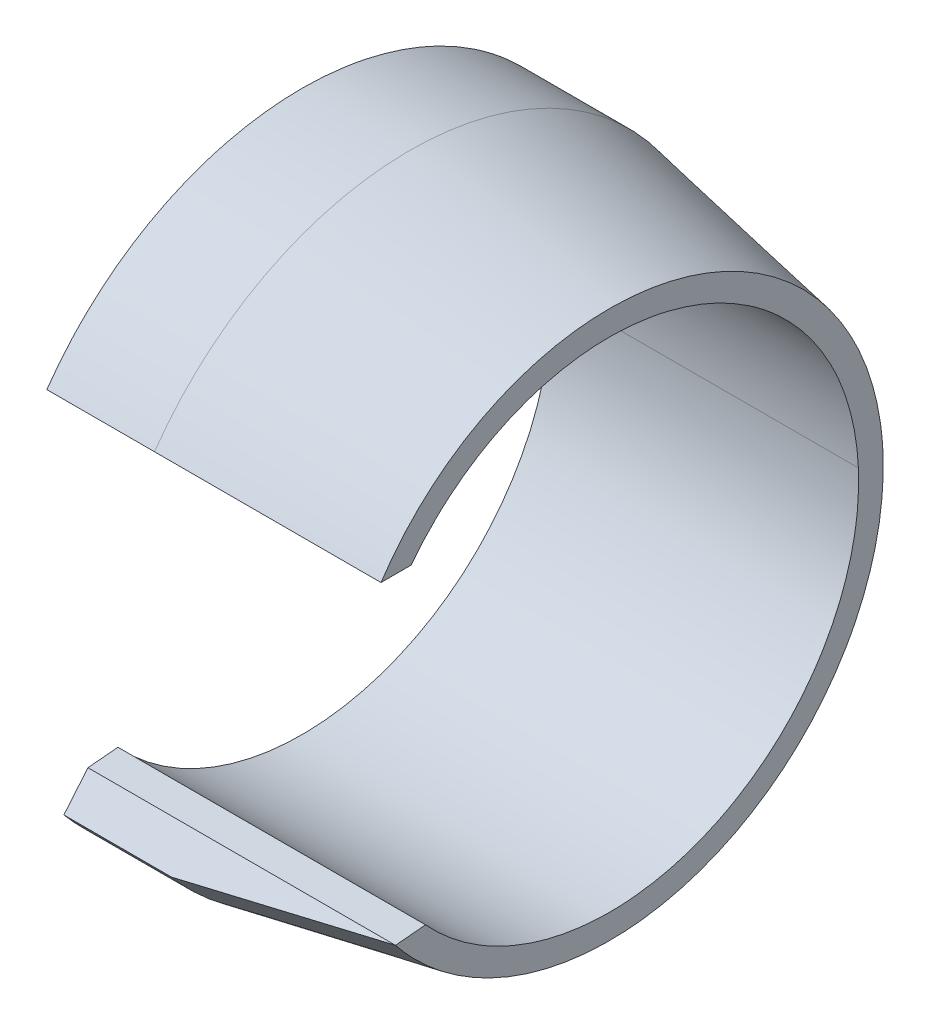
ISO-10303-21;
HEADER;
FILE_DESCRIPTION(('STEP AP214'),'2;1');
FILE_NAME('part.step','',(''),(''),'','','');
FILE_SCHEMA(('AUTOMOTIVE_DESIGN { 1 0 10303 214 1 1 1 1 }'));
ENDSEC;
DATA;
#1=APPLICATION_CONTEXT('core data for automotive mechanical design processes');
#2=APPLICATION_PROTOCOL_DEFINITION('international standard','automotive_design',2000,#1);
#3=PRODUCT_CONTEXT('',#1,'mechanical');
#4=PRODUCT('Part','Part','',(#3));
#5=PRODUCT_RELATED_PRODUCT_CATEGORY('part','',(#4));
#6=PRODUCT_DEFINITION_FORMATION('','',#4);
#7=PRODUCT_DEFINITION_CONTEXT('part definition',#1,'design');
#8=PRODUCT_DEFINITION('design','',#6,#7);
#9=PRODUCT_DEFINITION_SHAPE('','',#8);
#10=(LENGTH_UNIT() NAMED_UNIT(*) SI_UNIT(.MILLI.,.METRE.));
#11=(NAMED_UNIT(*) PLANE_ANGLE_UNIT() SI_UNIT($,.RADIAN.));
#12=(NAMED_UNIT(*) SI_UNIT($,.STERADIAN.) SOLID_ANGLE_UNIT());
#13=UNCERTAINTY_MEASURE_WITH_UNIT(LENGTH_MEASURE(1.E-05),#10,'distance_accuracy_value','');
#14=(GEOMETRIC_REPRESENTATION_CONTEXT(3) GLOBAL_UNCERTAINTY_ASSIGNED_CONTEXT((#13)) GLOBAL_UNIT_ASSIGNED_CONTEXT((#10,
#11,#12)) REPRESENTATION_CONTEXT('',''));
#15=CARTESIAN_POINT('',(0.,0.,0.));
#16=DIRECTION('',(0.,0.,1.));
#17=DIRECTION('',(1.,0.,0.));
#18=AXIS2_PLACEMENT_3D('',#15,#16,#17);
#19=CARTESIAN_POINT('',(0.,2.33213581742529,1.88713624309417));
#20=DIRECTION('',(1.,0.,0.));
#21=DIRECTION('',(0.,-1.,0.));
#22=AXIS2_PLACEMENT_3D('',#19,#20,#21);
#23=PLANE('',#22);
#24=CARTESIAN_POINT('',(0.,1.24460000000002,1.63825077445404));
#25=CARTESIAN_POINT('',(0.,1.47546134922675,1.46281665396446));
#26=CARTESIAN_POINT('',(0.,1.66863252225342,1.23801670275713));
#27=CARTESIAN_POINT('',(0.,1.96758637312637,0.688524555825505));
#28=CARTESIAN_POINT('',(0.,2.05430638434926,0.35401645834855));
#29=CARTESIAN_POINT('',(0.,2.06034463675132,-0.317149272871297));
#30=CARTESIAN_POINT('',(0.,1.97963289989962,-0.653170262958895));
#31=CARTESIAN_POINT('',(0.,1.66945591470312,-1.24839302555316));
#32=CARTESIAN_POINT('',(0.,1.4402528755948,-1.50700818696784));
#33=CARTESIAN_POINT('',(0.,0.886701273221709,-1.88658758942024));
#34=CARTESIAN_POINT('',(0.,0.562853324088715,-2.0071593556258));
#35=CARTESIAN_POINT('',(0.,0.183992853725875,-2.04966610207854));
#36=CARTESIAN_POINT('',(0.,0.138466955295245,-2.05324550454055));
#37=CARTESIAN_POINT('',(0.,0.0928724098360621,-2.05530680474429));
#38=B_SPLINE_CURVE_WITH_KNOTS('',3,(#24,#25,#26,#27,#28,#29,#30,#31,#32,#33,#34,#35,#36,#37),
.UNSPECIFIED.,.F.,.F.,(4,2,2,2,2,2,4),(0.,0.1728,0.3728,0.5728,0.7728,0.9728,1.),.UNSPECIFIED.);
#39=CARTESIAN_POINT('',(0.,1.24460000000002,1.63825077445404));
#40=VERTEX_POINT('',#39);
#41=CARTESIAN_POINT('',(0.,0.0928724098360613,-2.05530680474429));
#42=VERTEX_POINT('',#41);
#43=EDGE_CURVE('E10',#40,#42,#38,.T.);
#44=ORIENTED_EDGE('',*,*,#43,.T.);
#45=CARTESIAN_POINT('',(0.,0.0928724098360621,-2.05530680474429));
#46=CARTESIAN_POINT('',(0.,-0.19678705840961,-2.06840339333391));
#47=CARTESIAN_POINT('',(0.,-0.489104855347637,-2.01935420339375));
#48=CARTESIAN_POINT('',(0.,-1.07056366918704,-1.7886577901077));
#49=CARTESIAN_POINT('',(0.,-1.35135761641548,-1.58724264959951));
#50=CARTESIAN_POINT('',(0.,-1.78571826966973,-1.07554849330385));
#51=CARTESIAN_POINT('',(0.,-1.93885423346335,-0.76575562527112));
#52=CARTESIAN_POINT('',(0.,-2.0817005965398,-0.109939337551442));
#53=CARTESIAN_POINT('',(0.,-2.07125275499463,0.23547658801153));
#54=CARTESIAN_POINT('',(0.,-1.88904353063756,0.88146411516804));
#55=CARTESIAN_POINT('',(0.,-1.71746906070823,1.18142626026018));
#56=CARTESIAN_POINT('',(0.,-1.45365909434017,1.45664697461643));
#57=CARTESIAN_POINT('',(0.,-1.42098089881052,1.48854544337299));
#58=CARTESIAN_POINT('',(0.,-1.38728023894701,1.51932494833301));
#59=B_SPLINE_CURVE_WITH_KNOTS('',3,(#45,#46,#47,#48,#49,#50,#51,#52,#53,#54,#55,#56,#57,#58),
.UNSPECIFIED.,.F.,.F.,(4,2,2,2,2,2,4),(0.,0.1728,0.3728,0.5728,0.7728,0.9728,1.),.UNSPECIFIED.);
#60=CARTESIAN_POINT('',(0.,-1.38728023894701,1.51932494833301));
#61=VERTEX_POINT('',#60);
#62=EDGE_CURVE('E23',#42,#61,#59,.T.);
#63=ORIENTED_EDGE('',*,*,#62,.T.);
#64=CARTESIAN_POINT('',(0.,-1.40972700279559,1.76719612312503));
#65=CARTESIAN_POINT('',(0.,-1.40823055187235,1.75067137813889));
#66=CARTESIAN_POINT('',(0.,-1.40673410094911,1.73414663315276));
#67=CARTESIAN_POINT('',(0.,-1.40374119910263,1.70109714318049));
#68=CARTESIAN_POINT('',(0.,-1.4022447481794,1.68457239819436));
#69=CARTESIAN_POINT('',(0.,-1.39925184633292,1.65152290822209));
#70=CARTESIAN_POINT('',(0.,-1.39775539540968,1.63499816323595));
#71=CARTESIAN_POINT('',(0.,-1.3947624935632,1.60194867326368));
#72=CARTESIAN_POINT('',(0.,-1.39326604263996,1.58542392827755));
#73=CARTESIAN_POINT('',(0.,-1.39027314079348,1.55237443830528));
#74=CARTESIAN_POINT('',(0.,-1.38877668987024,1.53584969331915));
#75=CARTESIAN_POINT('',(0.,-1.387280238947,1.51932494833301));
#76=B_SPLINE_CURVE_WITH_KNOTS('',3,(#64,#65,#66,#67,#68,#69,#70,#71,#72,#73,#74,#75),
.UNSPECIFIED.,.F.,.F.,(4,2,2,2,2,4),(0.,0.2,0.4,0.6,0.8,1.),.UNSPECIFIED.);
#77=CARTESIAN_POINT('',(0.,-1.40972700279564,1.76719612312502));
#78=VERTEX_POINT('',#77);
#79=EDGE_CURVE('E519',#78,#61,#76,.T.);
#80=ORIENTED_EDGE('',*,*,#79,.F.);
#81=CARTESIAN_POINT('',(-1.86035950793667E-06,0.102044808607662,-2.25829598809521));
#82=CARTESIAN_POINT('',(-1.84744032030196E-06,0.0626280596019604,-2.26007811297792));
#83=CARTESIAN_POINT('',(-1.83452113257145E-06,0.0231646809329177,-2.2608262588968));
#84=CARTESIAN_POINT('',(-1.80868277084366E-06,-0.0557471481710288,-2.26025700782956));
#85=CARTESIAN_POINT('',(-1.79576359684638E-06,-0.0951955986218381,-2.25893961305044));
#86=CARTESIAN_POINT('',(-1.76992525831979E-06,-0.173969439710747,-2.25424170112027));
#87=CARTESIAN_POINT('',(-1.75700609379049E-06,-0.213294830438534,-2.25086118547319));
#88=CARTESIAN_POINT('',(-1.73116776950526E-06,-0.29171476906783,-2.24204662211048));
#89=CARTESIAN_POINT('',(-1.71824860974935E-06,-0.330809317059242,-2.23661257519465));
#90=CARTESIAN_POINT('',(-1.69241029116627E-06,-0.408660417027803,-2.22370575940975));
#91=CARTESIAN_POINT('',(-1.67949113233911E-06,-0.447416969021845,-2.21623299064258));
#92=CARTESIAN_POINT('',(-1.65365281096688E-06,-0.524485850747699,-2.19926923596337));
#93=CARTESIAN_POINT('',(-1.6407336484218E-06,-0.562798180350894,-2.18977824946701));
#94=CARTESIAN_POINT('',(-1.61489531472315E-06,-0.638873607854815,-2.16880406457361));
#95=CARTESIAN_POINT('',(-1.60197614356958E-06,-0.676636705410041,-2.1573208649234));
#96=CARTESIAN_POINT('',(-1.57613778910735E-06,-0.751510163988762,-2.1323937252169));
#97=CARTESIAN_POINT('',(-1.56321860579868E-06,-0.788620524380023,-2.11894978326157));
#98=CARTESIAN_POINT('',(-1.53738023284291E-06,-0.862086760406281,-2.09013801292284));
#99=CARTESIAN_POINT('',(-1.5244610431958E-06,-0.898442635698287,-2.07477018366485));
#100=CARTESIAN_POINT('',(-1.49862268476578E-06,-0.970300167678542,-2.04215279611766));
#101=CARTESIAN_POINT('',(-1.48570351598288E-06,-1.00580182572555,-2.02490324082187));
#102=CARTESIAN_POINT('',(-1.45986519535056E-06,-1.07585361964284,-1.98856968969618));
#103=CARTESIAN_POINT('',(-1.44694604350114E-06,-1.11040375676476,-1.96948569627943));
#104=CARTESIAN_POINT('',(-1.42110775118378E-06,-1.17845781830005,-1.92953558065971));
#105=CARTESIAN_POINT('',(-1.40818861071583E-06,-1.21196174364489,-1.90866946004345));
#106=CARTESIAN_POINT('',(-1.38235033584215E-06,-1.27783155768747,-1.86521228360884));
#107=CARTESIAN_POINT('',(-1.36943120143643E-06,-1.31019744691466,-1.84262122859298));
#108=CARTESIAN_POINT('',(-1.34359293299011E-06,-1.37370248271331,-1.79577610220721));
#109=CARTESIAN_POINT('',(-1.33067379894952E-06,-1.404841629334,-1.77152203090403));
#110=CARTESIAN_POINT('',(-1.30483552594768E-06,-1.46580783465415,-1.72141734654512));
#111=CARTESIAN_POINT('',(-1.29191638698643E-06,-1.49563489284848,-1.69556673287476));
#112=CARTESIAN_POINT('',(-1.26607809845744E-06,-1.55389517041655,-1.64233981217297));
#113=CARTESIAN_POINT('',(-1.2531589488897E-06,-1.58232838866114,-1.6149635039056));
#114=CARTESIAN_POINT('',(-1.22732063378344E-06,-1.63772305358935,-1.55876022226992));
#115=CARTESIAN_POINT('',(-1.21440146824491E-06,-1.66468449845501,-1.5299332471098));
#116=CARTESIAN_POINT('',(-1.18856311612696E-06,-1.71706171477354,-1.47090763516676));
#117=CARTESIAN_POINT('',(-1.17564392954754E-06,-1.74247748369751,-1.44070899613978));
#118=CARTESIAN_POINT('',(-1.1498055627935E-06,-1.79169361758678,-1.379022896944));
#119=CARTESIAN_POINT('',(-1.13688638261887E-06,-1.815493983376,-1.34753543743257));
#120=CARTESIAN_POINT('',(-1.11104804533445E-06,-1.86141404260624,-1.28335805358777));
#121=CARTESIAN_POINT('',(-1.09812888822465E-06,-1.88353373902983,-1.25066813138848));
#122=CARTESIAN_POINT('',(-1.07229059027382E-06,-1.92603184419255,-1.18417542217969));
#123=CARTESIAN_POINT('',(-1.05937144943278E-06,-1.94641025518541,-1.15037263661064));
#124=CARTESIAN_POINT('',(-1.03353317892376E-06,-1.98536994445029,-1.08174684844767));
#125=CARTESIAN_POINT('',(-1.02061404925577E-06,-2.00395122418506,-1.04692384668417));
#126=CARTESIAN_POINT('',(-9.94775793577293E-07,-2.03926572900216,-0.976353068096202));
#127=CARTESIAN_POINT('',(-9.81856667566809E-07,-2.05599895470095,-0.940605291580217));
#128=CARTESIAN_POINT('',(-9.560184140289E-07,-2.08757149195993,-0.868282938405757));
#129=CARTESIAN_POINT('',(-9.43099286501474E-07,-2.10241080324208,-0.83170836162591));
#130=CARTESIAN_POINT('',(-9.1726102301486E-07,-2.13015484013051,-0.757832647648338));
#131=CARTESIAN_POINT('',(-9.04341887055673E-07,-2.14305956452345,-0.720531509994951));
#132=CARTESIAN_POINT('',(-8.7850360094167E-07,-2.16689905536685,-0.645304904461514));
#133=CARTESIAN_POINT('',(-8.65584450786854E-07,-2.17783381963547,-0.607379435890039));
#134=CARTESIAN_POINT('',(-8.39746129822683E-07,-2.19770341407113,-0.531008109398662));
#135=CARTESIAN_POINT('',(-8.26826959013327E-07,-2.20663824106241,-0.492562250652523));
#136=CARTESIAN_POINT('',(-8.00988597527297E-07,-2.22248345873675,-0.415255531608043));
#137=CARTESIAN_POINT('',(-7.88069406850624E-07,-2.22939384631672,-0.376394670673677));
#138=CARTESIAN_POINT('',(-7.62231040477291E-07,-2.24117121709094,-0.298364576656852));
#139=CARTESIAN_POINT('',(-7.49311864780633E-07,-2.24603820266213,-0.25919534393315));
#140=CARTESIAN_POINT('',(-7.23473529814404E-07,-2.25371543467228,-0.180655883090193));
#141=CARTESIAN_POINT('',(-7.10554370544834E-07,-2.25652568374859,-0.141285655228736));
#142=CARTESIAN_POINT('',(-6.84716063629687E-07,-2.26008174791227,-0.0624521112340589));
#143=CARTESIAN_POINT('',(-6.7179691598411E-07,-2.2608275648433,-0.0229887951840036));
#144=CARTESIAN_POINT('',(-6.45958627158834E-07,-2.26025272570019,0.0559227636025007));
#145=CARTESIAN_POINT('',(-6.33039485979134E-07,-2.25893207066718,0.0953710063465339));
#146=CARTESIAN_POINT('',(-6.07201205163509E-07,-2.25422790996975,0.174144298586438));
#147=CARTESIAN_POINT('',(-5.94282065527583E-07,-2.25084440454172,0.213469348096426));
#148=CARTESIAN_POINT('',(-5.68443782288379E-07,-2.24202381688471,0.291888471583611));
#149=CARTESIAN_POINT('',(-5.555246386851E-07,-2.23658673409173,0.330982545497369));
#150=CARTESIAN_POINT('',(-5.29686343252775E-07,-2.22367389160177,0.408832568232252));
#151=CARTESIAN_POINT('',(-5.1676719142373E-07,-2.21619813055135,0.447588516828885));
#152=CARTESIAN_POINT('',(-4.90928873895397E-07,-2.19922841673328,0.524656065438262));
#153=CARTESIAN_POINT('',(-4.78009708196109E-07,-2.18973446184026,0.562967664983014));
#154=CARTESIAN_POINT('',(-4.52171358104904E-07,-2.16875437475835,0.639041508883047));
#155=CARTESIAN_POINT('',(-4.39252173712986E-07,-2.15726823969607,0.676803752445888));
#156=CARTESIAN_POINT('',(-4.13413796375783E-07,-2.13233527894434,0.751675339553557));
#157=CARTESIAN_POINT('',(-4.00494603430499E-07,-2.11888845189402,0.788784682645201));
#158=CARTESIAN_POINT('',(-3.74656225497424E-07,-2.09007098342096,0.862248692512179));
#159=CARTESIAN_POINT('',(-3.61737040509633E-07,-2.07470034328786,0.898603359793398));
#160=CARTESIAN_POINT('',(-3.35898677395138E-07,-2.04207738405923,0.970458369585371));
#161=CARTESIAN_POINT('',(-3.22979499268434E-07,-2.02482506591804,1.00595871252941));
#162=CARTESIAN_POINT('',(-2.97141147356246E-07,-1.9884860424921,1.07600776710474));
#163=CARTESIAN_POINT('',(-2.84221973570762E-07,-1.96939933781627,1.11055647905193));
#164=CARTESIAN_POINT('',(-2.58383627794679E-07,-1.92944386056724,1.17860757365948));
#165=CARTESIAN_POINT('',(-2.4546445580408E-07,-1.90857508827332,1.21210995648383));
#166=CARTESIAN_POINT('',(-2.19626111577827E-07,-1.86511267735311,1.27797656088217));
#167=CARTESIAN_POINT('',(-2.06706939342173E-07,-1.84251903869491,1.3103407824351));
#168=CARTESIAN_POINT('',(-1.80868592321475E-07,-1.79566882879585,1.37384235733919));
#169=CARTESIAN_POINT('',(-1.67949417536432E-07,-1.77141225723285,1.40497971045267));
#170=CARTESIAN_POINT('',(-1.42111063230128E-07,-1.72130265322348,1.46594218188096));
#171=CARTESIAN_POINT('',(-1.29191883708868E-07,-1.6954496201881,1.4957672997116));
#172=CARTESIAN_POINT('',(-1.03353517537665E-07,-1.64221801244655,1.55402361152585));
#173=CARTESIAN_POINT('',(-9.04343308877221E-08,-1.61483943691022,1.58245480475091));
#174=CARTESIAN_POINT('',(-6.45959492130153E-08,-1.55863157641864,1.63784509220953));
#175=CARTESIAN_POINT('',(-5.16767541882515E-08,-1.529802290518,1.66480418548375));
#176=CARTESIAN_POINT('',(-2.58383631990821E-08,-1.47077284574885,1.71717724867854));
#177=CARTESIAN_POINT('',(-1.29191672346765E-08,-1.44057268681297,1.74259121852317));
#178=CARTESIAN_POINT('',(0.,-1.40972700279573,1.76719612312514));
#179=B_SPLINE_CURVE_WITH_KNOTS('',3,(#81,#82,#83,#84,#85,#86,#87,#88,#89,#90,#91,#92,#93,#94,
#95,#96,#97,#98,#99,#100,#101,#102,#103,#104,#105,#106,#107,#108,#109,#110,#111,#112,#113,#114,
#115,#116,#117,#118,#119,#120,#121,#122,#123,#124,#125,#126,#127,#128,#129,#130,#131,#132,#133,
#134,#135,#136,#137,#138,#139,#140,#141,#142,#143,#144,#145,#146,#147,#148,#149,#150,#151,#152,
#153,#154,#155,#156,#157,#158,#159,#160,#161,#162,#163,#164,#165,#166,#167,#168,#169,#170,#171,
#172,#173,#174,#175,#176,#177,#178),.UNSPECIFIED.,.F.,.F.,(4,2,2,2,2,2,2,2,2,2,2,2,2,2,2,2,2,2,
2,2,2,2,2,2,2,2,2,2,2,2,2,2,2,2,2,2,2,2,2,2,2,2,2,2,2,2,2,2,4),(0.,0.118357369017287,
0.236714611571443,0.355071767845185,0.473428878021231,0.591785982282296,0.710143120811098,
0.828500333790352,0.94685766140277,1.06521504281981,1.18357223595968,1.30192927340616,
1.42028620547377,1.53864308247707,1.65699995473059,1.77535687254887,1.89371388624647,
2.0120710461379,2.13042839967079,2.24878569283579,2.36714277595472,2.48549970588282,
2.60385653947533,2.72221333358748,2.8405701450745,2.95892703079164,3.07728404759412,
3.19564125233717,3.3139986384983,3.43235588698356,3.55071298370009,3.66906997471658,
3.78742690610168,3.9057838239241,4.02414077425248,4.1424978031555,4.26085495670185,
4.37921228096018,4.49756968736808,4.6159270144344,4.73428428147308,4.85264150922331,
4.9709987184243,5.08935592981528,5.20771316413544,5.32607044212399,5.44442778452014,
5.5627852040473,5.68114262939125),.UNSPECIFIED.);
#180=CARTESIAN_POINT('',(-9.301797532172E-07,0.102045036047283,-2.25830102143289));
#181=VERTEX_POINT('',#180);
#182=EDGE_CURVE('E359',#181,#78,#179,.T.);
#183=ORIENTED_EDGE('',*,*,#182,.F.);
#184=CARTESIAN_POINT('',(0.,1.24460000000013,1.88713624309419));
#185=CARTESIAN_POINT('',(-1.29191649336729E-08,1.27753903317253,1.86541358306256));
#186=CARTESIAN_POINT('',(-2.58383453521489E-08,1.30990814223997,1.8428269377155));
#187=CARTESIAN_POINT('',(-5.16767030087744E-08,1.37342042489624,1.79599119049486));
#188=CARTESIAN_POINT('',(-6.4595880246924E-08,1.40456359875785,1.77174208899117));
#189=CARTESIAN_POINT('',(-9.04342332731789E-08,1.46553793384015,1.72164693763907));
#190=CARTESIAN_POINT('',(-1.03353409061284E-07,1.49536909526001,1.69580088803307));
#191=CARTESIAN_POINT('',(-1.29191758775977E-07,1.55363782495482,1.64258294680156));
#192=CARTESIAN_POINT('',(-1.42110932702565E-07,1.58207539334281,1.61521105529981));
#193=CARTESIAN_POINT('',(-1.67949281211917E-07,1.63747893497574,1.55901639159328));
#194=CARTESIAN_POINT('',(-1.80868455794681E-07,1.664444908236,1.5301936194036));
#195=CARTESIAN_POINT('',(-2.06706805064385E-07,1.71683135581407,1.47117622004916));
#196=CARTESIAN_POINT('',(-2.19625979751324E-07,1.74225183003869,1.44098159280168));
#197=CARTESIAN_POINT('',(-2.45464331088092E-07,1.79147759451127,1.37930324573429));
#198=CARTESIAN_POINT('',(-2.5838350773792E-07,1.81528288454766,1.34781952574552));
#199=CARTESIAN_POINT('',(-2.84221863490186E-07,1.86121302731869,1.28364929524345));
#200=CARTESIAN_POINT('',(-2.97141042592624E-07,1.8833378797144,1.25096278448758));
#201=CARTESIAN_POINT('',(-3.22979400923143E-07,1.92584649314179,1.18447657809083));
#202=CARTESIAN_POINT('',(-3.35898580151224E-07,1.94623025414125,1.15067688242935));
#203=CARTESIAN_POINT('',(-3.61736931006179E-07,1.98520079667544,1.08205697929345));
#204=CARTESIAN_POINT('',(-3.74656102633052E-07,2.00378757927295,1.0472367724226));
#205=CARTESIAN_POINT('',(-4.00494439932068E-07,2.03911321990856,0.976671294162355));
#206=CARTESIAN_POINT('',(-4.13413605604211E-07,2.05585207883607,0.940926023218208));
#207=CARTESIAN_POINT('',(-4.39251932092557E-07,2.08743599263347,0.868608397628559));
#208=CARTESIAN_POINT('',(-4.52171092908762E-07,2.10228104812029,0.832036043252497));
#209=CARTESIAN_POINT('',(-4.7800941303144E-07,2.13003666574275,0.758164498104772));
#210=CARTESIAN_POINT('',(-4.90928572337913E-07,2.14294722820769,0.720865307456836));
#211=CARTESIAN_POINT('',(-5.16766890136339E-07,2.16679847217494,0.645642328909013));
#212=CARTESIAN_POINT('',(-5.29686048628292E-07,2.17773915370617,0.607718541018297));
#213=CARTESIAN_POINT('',(-5.55524367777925E-07,2.19762064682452,0.531350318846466));
#214=CARTESIAN_POINT('',(-5.68443528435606E-07,2.20656145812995,0.492905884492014));
#215=CARTESIAN_POINT('',(-5.9428185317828E-07,2.22241870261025,0.415601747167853));
#216=CARTESIAN_POINT('',(-6.07201017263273E-07,2.2293351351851,0.376742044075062));
#217=CARTESIAN_POINT('',(-6.33039351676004E-07,2.24112466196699,0.298713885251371));
#218=CARTESIAN_POINT('',(-6.45958522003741E-07,2.24599775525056,0.259545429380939));
#219=CARTESIAN_POINT('',(-6.71796869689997E-07,2.25368724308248,0.181007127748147));
#220=CARTESIAN_POINT('',(-6.84716047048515E-07,2.25650363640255,0.141637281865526));
#221=CARTESIAN_POINT('',(-7.10554398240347E-07,2.26007199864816,0.0628041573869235));
#222=CARTESIAN_POINT('',(-7.2347357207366E-07,2.26082396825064,0.0233408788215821));
#223=CARTESIAN_POINT('',(-7.49311908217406E-07,2.26026142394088,-0.0555709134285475));
#224=CARTESIAN_POINT('',(-7.62231070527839E-07,2.25894691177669,-0.0950194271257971));
#225=CARTESIAN_POINT('',(-7.88069387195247E-07,2.25425501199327,-0.173793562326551));
#226=CARTESIAN_POINT('',(-8.00988541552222E-07,2.25087762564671,-0.213119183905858));
#227=CARTESIAN_POINT('',(-8.26826845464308E-07,2.24206923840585,-0.291539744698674));
#228=CARTESIAN_POINT('',(-8.39745995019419E-07,2.2366382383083,-0.330634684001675));
#229=CARTESIAN_POINT('',(-8.65584291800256E-07,2.22373751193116,-0.408486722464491));
#230=CARTESIAN_POINT('',(-8.78503439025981E-07,2.21626778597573,-0.447243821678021));
#231=CARTESIAN_POINT('',(-9.04341734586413E-07,2.19931008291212,-0.524313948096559));
#232=CARTESIAN_POINT('',(-9.17260882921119E-07,2.18982210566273,-0.562626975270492));
#233=CARTESIAN_POINT('',(-9.43099183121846E-07,2.16885390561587,-0.638703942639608));
#234=CARTESIAN_POINT('',(-9.56018334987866E-07,2.15737368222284,-0.676467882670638));
#235=CARTESIAN_POINT('',(-9.81856645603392E-07,2.13245245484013,-0.751343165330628));
#236=CARTESIAN_POINT('',(-9.94775804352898E-07,2.11901144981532,-0.788454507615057));
#237=CARTESIAN_POINT('',(-1.02061413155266E-06,2.09020549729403,-0.861922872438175));
#238=CARTESIAN_POINT('',(-1.03353330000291E-06,2.07484054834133,-0.898279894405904));
#239=CARTESIAN_POINT('',(-1.05937164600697E-06,2.0422288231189,-0.97013995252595));
#240=CARTESIAN_POINT('',(-1.07229082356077E-06,2.02498204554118,-1.00564298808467));
#241=CARTESIAN_POINT('',(-1.09812916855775E-06,1.98865396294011,-1.07569769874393));
#242=CARTESIAN_POINT('',(-1.11104833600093E-06,1.96957265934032,-1.11024937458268));
#243=CARTESIAN_POINT('',(-1.13688666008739E-06,1.9296278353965,-1.17830665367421));
#244=CARTESIAN_POINT('',(-1.14980581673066E-06,1.90876431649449,-1.21181225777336));
#245=CARTESIAN_POINT('',(-1.1756441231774E-06,1.86531225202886,-1.27768555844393));
#246=CARTESIAN_POINT('',(-1.18856327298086E-06,1.84272370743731,-1.31005325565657));
#247=CARTESIAN_POINT('',(-1.21440156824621E-06,1.79588350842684,-1.37356202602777));
#248=CARTESIAN_POINT('',(-1.2273207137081E-06,1.77163185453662,-1.4047030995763));
#249=CARTESIAN_POINT('',(-1.2531590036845E-06,1.7215319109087,-1.46567326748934));
#250=CARTESIAN_POINT('',(-1.266078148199E-06,1.69568362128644,-1.49550236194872));
#251=CARTESIAN_POINT('',(-1.2919164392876E-06,1.64246125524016,-1.55376681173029));
#252=CARTESIAN_POINT('',(-1.30483558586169E-06,1.61508717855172,-1.58220216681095));
#253=CARTESIAN_POINT('',(-1.33067388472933E-06,1.55888826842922,-1.63760119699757));
#254=CARTESIAN_POINT('',(-1.34359303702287E-06,1.53006343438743,-1.66456487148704));
#255=CARTESIAN_POINT('',(-1.36943134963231E-06,1.47104201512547,-1.71694663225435));
#256=CARTESIAN_POINT('',(-1.38235050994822E-06,1.44084542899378,-1.74236471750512));
#257=CARTESIAN_POINT('',(-1.40818884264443E-06,1.37916327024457,-1.7915856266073));
#258=CARTESIAN_POINT('',(-1.42110801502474E-06,1.34767769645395,-1.81538844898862));
#259=CARTESIAN_POINT('',(-1.44694636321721E-06,1.28350388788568,-1.86131356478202));
#260=CARTESIAN_POINT('',(-1.45986553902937E-06,1.25081565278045,-1.88343585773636));
#261=CARTESIAN_POINT('',(-1.48570388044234E-06,1.1843261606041,-1.92593924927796));
#262=CARTESIAN_POINT('',(-1.49862304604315E-06,1.15052490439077,-1.94632034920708));
#263=CARTESIAN_POINT('',(-1.52446136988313E-06,1.0819020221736,-1.985285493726));
#264=CARTESIAN_POINT('',(-1.53738052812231E-06,1.04708039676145,-2.00386953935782));
#265=CARTESIAN_POINT('',(-1.56321883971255E-06,0.976512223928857,-2.03918963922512));
#266=CARTESIAN_POINT('',(-1.57613799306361E-06,0.940765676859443,-2.05592569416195));
#267=CARTESIAN_POINT('',(-1.60197629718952E-06,0.868445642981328,-2.08750394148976));
#268=CARTESIAN_POINT('',(-1.61489544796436E-06,0.831872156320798,-2.10234613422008));
#269=CARTESIAN_POINT('',(-1.64073374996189E-06,0.757998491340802,-2.13009597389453));
#270=CARTESIAN_POINT('',(-1.65365290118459E-06,0.720698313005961,-2.14300362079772));
#271=CARTESIAN_POINT('',(-1.67949120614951E-06,0.64547350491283,-2.16684899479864));
#272=CARTESIAN_POINT('',(-1.69241035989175E-06,0.607548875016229,-2.17778672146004));
#273=CARTESIAN_POINT('',(-1.71824867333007E-06,0.531179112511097,-2.19766225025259));
#274=CARTESIAN_POINT('',(-1.73116783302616E-06,0.49273397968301,-2.20660005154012));
#275=CARTESIAN_POINT('',(-1.75700615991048E-06,0.415428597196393,-2.22245131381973));
#276=CARTESIAN_POINT('',(-1.7699253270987E-06,0.376568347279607,-2.22936477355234));
#277=CARTESIAN_POINT('',(-1.79576366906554E-06,0.298539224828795,-2.24114807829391));
#278=CARTESIAN_POINT('',(-1.80868284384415E-06,0.259370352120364,-2.24601792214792));
#279=CARTESIAN_POINT('',(-1.83452118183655E-06,0.180831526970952,-2.25370182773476));
#280=CARTESIAN_POINT('',(-1.84744034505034E-06,0.141461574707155,-2.25651589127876));
#281=CARTESIAN_POINT('',(-1.86035950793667E-06,0.102044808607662,-2.25829598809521));
#282=B_SPLINE_CURVE_WITH_KNOTS('',3,(#184,#185,#186,#187,#188,#189,#190,#191,#192,#193,#194,
#195,#196,#197,#198,#199,#200,#201,#202,#203,#204,#205,#206,#207,#208,#209,#210,#211,#212,#213,
#214,#215,#216,#217,#218,#219,#220,#221,#222,#223,#224,#225,#226,#227,#228,#229,#230,#231,#232,
#233,#234,#235,#236,#237,#238,#239,#240,#241,#242,#243,#244,#245,#246,#247,#248,#249,#250,#251,
#252,#253,#254,#255,#256,#257,#258,#259,#260,#261,#262,#263,#264,#265,#266,#267,#268,#269,#270,
#271,#272,#273,#274,#275,#276,#277,#278,#279,#280,#281),.UNSPECIFIED.,.F.,.F.,(4,2,2,2,2,2,2,2,
2,2,2,2,2,2,2,2,2,2,2,2,2,2,2,2,2,2,2,2,2,2,2,2,2,2,2,2,2,2,2,2,2,2,2,2,2,2,2,2,4),(0.,
0.118357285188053,0.236714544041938,0.355071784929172,0.473429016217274,0.591786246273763,
0.710143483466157,0.828500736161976,0.946858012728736,1.06521529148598,1.1835725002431,
1.30192965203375,1.42028676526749,1.53864385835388,1.6570009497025,1.7753580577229,
1.89371520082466,2.01207239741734,2.13042966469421,2.24878689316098,2.36714402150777,
2.48550107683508,2.60385808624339,2.7222150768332,2.840572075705,2.9589291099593,
3.07728620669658,3.19564339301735,3.31400066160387,3.43235783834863,3.55071491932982,
3.66907193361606,3.78742891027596,3.90578587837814,4.02414286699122,4.14249990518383,
4.26085702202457,4.37921424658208,4.49757150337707,4.61592866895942,4.73428576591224,
4.85264281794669,4.97099984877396,5.08935688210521,5.20771394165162,5.32607105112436,
5.44442823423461,5.56278548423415,5.6811426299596),.UNSPECIFIED.);
#283=CARTESIAN_POINT('',(0.,1.24460000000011,1.88713624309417));
#284=VERTEX_POINT('',#283);
#285=EDGE_CURVE('E426',#284,#181,#282,.T.);
#286=ORIENTED_EDGE('',*,*,#285,.F.);
#287=CARTESIAN_POINT('',(0.,1.2446,1.63825077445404));
#288=CARTESIAN_POINT('',(0.,1.2446,1.65484313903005));
#289=CARTESIAN_POINT('',(0.,1.2446,1.67143550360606));
#290=CARTESIAN_POINT('',(0.,1.2446,1.70462023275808));
#291=CARTESIAN_POINT('',(0.,1.2446,1.72121259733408));
#292=CARTESIAN_POINT('',(0.,1.2446,1.7543973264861));
#293=CARTESIAN_POINT('',(0.,1.2446,1.77098969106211));
#294=CARTESIAN_POINT('',(0.,1.2446,1.80417442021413));
#295=CARTESIAN_POINT('',(0.,1.2446,1.82076678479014));
#296=CARTESIAN_POINT('',(0.,1.2446,1.85395151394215));
#297=CARTESIAN_POINT('',(0.,1.2446,1.87054387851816));
#298=CARTESIAN_POINT('',(0.,1.2446,1.88713624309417));
#299=B_SPLINE_CURVE_WITH_KNOTS('',3,(#287,#288,#289,#290,#291,#292,#293,#294,#295,#296,#297,
#298),.UNSPECIFIED.,.F.,.F.,(4,2,2,2,2,4),(0.,0.2,0.4,0.6,0.8,1.),.UNSPECIFIED.);
#300=EDGE_CURVE('E250',#40,#284,#299,.T.);
#301=ORIENTED_EDGE('',*,*,#300,.F.);
#302=EDGE_LOOP('',(#44,#63,#80,#183,#286,#301));
#303=FACE_BOUND('',#302,.T.);
#304=ADVANCED_FACE('F15',(#303),#23,.T.);
#305=CARTESIAN_POINT('',(0.,0.,0.));
#306=DIRECTION('',(-1.,0.,0.));
#307=DIRECTION('',(0.,0.604938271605,0.796272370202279));
#308=AXIS2_PLACEMENT_3D('',#305,#306,#307);
#309=CYLINDRICAL_SURFACE('',#308,2.0574);
#310=ORIENTED_EDGE('',*,*,#43,.F.);
#311=CARTESIAN_POINT('',(-2.54,1.2446,1.63825077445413));
#312=CARTESIAN_POINT('',(-2.37066666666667,1.2446,1.63825077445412));
#313=CARTESIAN_POINT('',(-2.20133333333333,1.2446,1.63825077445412));
#314=CARTESIAN_POINT('',(-1.86266666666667,1.2446,1.6382507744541));
#315=CARTESIAN_POINT('',(-1.69333333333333,1.2446,1.6382507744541));
#316=CARTESIAN_POINT('',(-1.35466666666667,1.2446,1.63825077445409));
#317=CARTESIAN_POINT('',(-1.18533333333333,1.2446,1.63825077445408));
#318=CARTESIAN_POINT('',(-0.846666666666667,1.2446,1.63825077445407));
#319=CARTESIAN_POINT('',(-0.677333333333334,1.2446,1.63825077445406));
#320=CARTESIAN_POINT('',(-0.338666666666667,1.2446,1.63825077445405));
#321=CARTESIAN_POINT('',(-0.169333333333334,1.2446,1.63825077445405));
#322=CARTESIAN_POINT('',(0.,1.2446,1.63825077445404));
#323=B_SPLINE_CURVE_WITH_KNOTS('',3,(#311,#312,#313,#314,#315,#316,#317,#318,#319,#320,#321,
#322),.UNSPECIFIED.,.F.,.F.,(4,2,2,2,2,4),(0.,0.2,0.4,0.6,0.8,1.),.UNSPECIFIED.);
#324=CARTESIAN_POINT('',(-2.54,1.24460000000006,1.63825077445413));
#325=VERTEX_POINT('',#324);
#326=EDGE_CURVE('E109',#325,#40,#323,.T.);
#327=ORIENTED_EDGE('',*,*,#326,.F.);
#328=CARTESIAN_POINT('',(-2.54,1.24460000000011,1.63825077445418));
#329=CARTESIAN_POINT('',(-2.54,1.27243658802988,1.61710400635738));
#330=CARTESIAN_POINT('',(-2.54,1.29973314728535,1.5952465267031));
#331=CARTESIAN_POINT('',(-2.54,1.35317764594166,1.5501697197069));
#332=CARTESIAN_POINT('',(-2.54,1.37932558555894,1.52695039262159));
#333=CARTESIAN_POINT('',(-2.54,1.43040428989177,1.47920946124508));
#334=CARTESIAN_POINT('',(-2.54,1.4553350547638,1.45468785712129));
#335=CARTESIAN_POINT('',(-2.54,1.50391481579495,1.40440627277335));
#336=CARTESIAN_POINT('',(-2.54,1.52756381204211,1.37864629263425));
#337=CARTESIAN_POINT('',(-2.54,1.57351855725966,1.32595482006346));
#338=CARTESIAN_POINT('',(-2.54,1.59582430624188,1.29902332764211));
#339=CARTESIAN_POINT('',(-2.54,1.63903462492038,1.24405880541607));
#340=CARTESIAN_POINT('',(-2.54,1.65993919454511,1.21602577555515));
#341=CARTESIAN_POINT('',(-2.54,1.70029284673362,1.15893099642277));
#342=CARTESIAN_POINT('',(-2.54,1.71974192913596,1.12986924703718));
#343=CARTESIAN_POINT('',(-2.54,1.75713408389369,1.0707925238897));
#344=CARTESIAN_POINT('',(-2.54,1.77507715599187,1.040777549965));
#345=CARTESIAN_POINT('',(-2.54,1.80941067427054,0.979872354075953));
#346=CARTESIAN_POINT('',(-2.54,1.82580112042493,0.948982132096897));
#347=CARTESIAN_POINT('',(-2.54,1.85698679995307,0.88640670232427));
#348=CARTESIAN_POINT('',(-2.54,1.87178203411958,0.854721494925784));
#349=CARTESIAN_POINT('',(-2.54,1.89973885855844,0.790638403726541));
#350=CARTESIAN_POINT('',(-2.54,1.91290044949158,0.758240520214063));
#351=CARTESIAN_POINT('',(-2.54,1.93755580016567,0.692816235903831));
#352=CARTESIAN_POINT('',(-2.54,1.94904956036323,0.659789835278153));
#353=CARTESIAN_POINT('',(-2.54,1.970339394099,0.593194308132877));
#354=CARTESIAN_POINT('',(-2.54,1.98013546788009,0.559625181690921));
#355=CARTESIAN_POINT('',(-2.54,1.99800448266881,0.492031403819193));
#356=CARTESIAN_POINT('',(-2.54,2.0060774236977,0.458006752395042));
#357=CARTESIAN_POINT('',(-2.54,2.0204792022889,0.389590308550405));
#358=CARTESIAN_POINT('',(-2.54,2.02680803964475,0.355198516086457));
#359=CARTESIAN_POINT('',(-2.54,2.03770517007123,0.286137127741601));
#360=CARTESIAN_POINT('',(-2.54,2.04227346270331,0.251467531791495));
#361=CARTESIAN_POINT('',(-2.54,2.04963763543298,0.18194059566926));
#362=CARTESIAN_POINT('',(-2.54,2.05243351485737,0.147083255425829));
#363=CARTESIAN_POINT('',(-2.54,2.05624559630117,0.0772713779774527));
#364=CARTESIAN_POINT('',(-2.54,2.05726179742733,0.0423168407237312));
#365=CARTESIAN_POINT('',(-2.54,2.05751187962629,-0.0275985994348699));
#366=CARTESIAN_POINT('',(-2.54,2.05674576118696,-0.0625595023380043));
#367=CARTESIAN_POINT('',(-2.54,2.05343319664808,-0.132396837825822));
#368=CARTESIAN_POINT('',(-2.54,2.05088675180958,-0.167273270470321));
#369=CARTESIAN_POINT('',(-2.54,2.04402015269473,-0.236851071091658));
#370=CARTESIAN_POINT('',(-2.54,2.03969999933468,-0.271552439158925));
#371=CARTESIAN_POINT('',(-2.54,2.02929720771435,-0.340689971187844));
#372=CARTESIAN_POINT('',(-2.54,2.02321457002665,-0.375126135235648));
#373=CARTESIAN_POINT('',(-2.54,2.00930261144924,-0.443643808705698));
#374=CARTESIAN_POINT('',(-2.54,2.00147329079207,-0.477725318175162));
#375=CARTESIAN_POINT('',(-2.54,1.98408830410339,-0.545445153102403));
#376=CARTESIAN_POINT('',(-2.54,1.97453263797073,-0.579083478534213));
#377=CARTESIAN_POINT('',(-2.54,1.95371978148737,-0.645829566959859));
#378=CARTESIAN_POINT('',(-2.54,1.94246259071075,-0.678937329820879));
#379=CARTESIAN_POINT('',(-2.54,1.91827592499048,-0.744536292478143));
#380=CARTESIAN_POINT('',(-2.54,1.90534644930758,-0.777027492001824));
#381=CARTESIAN_POINT('',(-2.54,1.87784879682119,-0.841308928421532));
#382=CARTESIAN_POINT('',(-2.54,1.8632806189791,-0.873099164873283));
#383=CARTESIAN_POINT('',(-2.54,1.83254340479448,-0.935896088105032));
#384=CARTESIAN_POINT('',(-2.54,1.81637436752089,-0.966902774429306));
#385=CARTESIAN_POINT('',(-2.54,1.78247745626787,-1.02805200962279));
#386=CARTESIAN_POINT('',(-2.54,1.76474958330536,-1.05819455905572));
#387=CARTESIAN_POINT('',(-2.54,1.72778105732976,-1.11753721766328));
#388=CARTESIAN_POINT('',(-2.54,1.70854040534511,-1.14673732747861));
#389=CARTESIAN_POINT('',(-2.54,1.66859630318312,-1.20411925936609));
#390=CARTESIAN_POINT('',(-2.54,1.64789285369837,-1.23230108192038));
#391=CARTESIAN_POINT('',(-2.54,1.60507693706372,-1.28757323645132));
#392=CARTESIAN_POINT('',(-2.54,1.58296447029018,-1.31466356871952));
#393=CARTESIAN_POINT('',(-2.54,1.53738795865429,-1.36768237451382));
#394=CARTESIAN_POINT('',(-2.54,1.51392391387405,-1.3936108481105));
#395=CARTESIAN_POINT('',(-2.54,1.46570519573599,-1.44423858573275));
#396=CARTESIAN_POINT('',(-2.54,1.44095052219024,-1.46893784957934));
#397=CARTESIAN_POINT('',(-2.54,1.3902148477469,-1.51704300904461));
#398=CARTESIAN_POINT('',(-2.54,1.36423384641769,-1.54044890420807));
#399=CARTESIAN_POINT('',(-2.54,1.31111300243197,-1.58590652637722));
#400=CARTESIAN_POINT('',(-2.54,1.28397315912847,-1.60795825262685));
#401=CARTESIAN_POINT('',(-2.54,1.2286051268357,-1.65065025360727));
#402=CARTESIAN_POINT('',(-2.54,1.2003769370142,-1.67129052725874));
#403=CARTESIAN_POINT('',(-2.54,1.14290555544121,-1.7111059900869));
#404=CARTESIAN_POINT('',(-2.54,1.11366236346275,-1.73028117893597));
#405=CARTESIAN_POINT('',(-2.54,1.05423697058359,-1.7671166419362));
#406=CARTESIAN_POINT('',(-2.54,1.02405477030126,-1.78477691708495));
#407=CARTESIAN_POINT('',(-2.54,0.962829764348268,-1.81853668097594));
#408=CARTESIAN_POINT('',(-2.54,0.931786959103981,-1.83463617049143));
#409=CARTESIAN_POINT('',(-2.54,0.868921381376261,-1.86523254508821));
#410=CARTESIAN_POINT('',(-2.54,0.837098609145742,-1.87972943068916));
#411=CARTESIAN_POINT('',(-2.54,0.772755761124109,-1.90708294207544));
#412=CARTESIAN_POINT('',(-2.54,0.740235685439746,-1.91993956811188));
#413=CARTESIAN_POINT('',(-2.54,0.674582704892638,-1.94397916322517));
#414=CARTESIAN_POINT('',(-2.54,0.641449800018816,-1.95516213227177));
#415=CARTESIAN_POINT('',(-2.54,0.574657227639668,-1.97582536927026));
#416=CARTESIAN_POINT('',(-2.54,0.540997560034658,-1.98530563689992));
#417=CARTESIAN_POINT('',(-2.54,0.473238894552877,-2.0025388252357));
#418=CARTESIAN_POINT('',(-2.54,0.439139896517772,-2.01029174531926));
#419=CARTESIAN_POINT('',(-2.54,0.370591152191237,-2.02405016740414));
#420=CARTESIAN_POINT('',(-2.54,0.336141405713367,-2.03005566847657));
#421=CARTESIAN_POINT('',(-2.54,0.266980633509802,-2.04030338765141));
#422=CARTESIAN_POINT('',(-2.54,0.232269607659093,-2.0445456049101));
#423=CARTESIAN_POINT('',(-2.54,0.162676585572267,-2.05125670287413));
#424=CARTESIAN_POINT('',(-2.54,0.127794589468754,-2.05372558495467));
#425=CARTESIAN_POINT('',(-2.54,0.0928722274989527,-2.05530277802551));
#426=B_SPLINE_CURVE_WITH_KNOTS('',3,(#328,#329,#330,#331,#332,#333,#334,#335,#336,#337,#338,
#339,#340,#341,#342,#343,#344,#345,#346,#347,#348,#349,#350,#351,#352,#353,#354,#355,#356,#357,
#358,#359,#360,#361,#362,#363,#364,#365,#366,#367,#368,#369,#370,#371,#372,#373,#374,#375,#376,
#377,#378,#379,#380,#381,#382,#383,#384,#385,#386,#387,#388,#389,#390,#391,#392,#393,#394,#395,
#396,#397,#398,#399,#400,#401,#402,#403,#404,#405,#406,#407,#408,#409,#410,#411,#412,#413,#414,
#415,#416,#417,#418,#419,#420,#421,#422,#423,#424,#425),.UNSPECIFIED.,.F.,.F.,(4,2,2,2,2,2,2,2,
2,2,2,2,2,2,2,2,2,2,2,2,2,2,2,2,2,2,2,2,2,2,2,2,2,2,2,2,2,2,2,2,2,2,2,2,2,2,2,2,4),(0.,
0.104862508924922,0.20972499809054,0.314587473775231,0.419449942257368,0.524312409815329,
0.629174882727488,0.734037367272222,0.838899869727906,0.943762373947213,1.04862482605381,
1.15348723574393,1.25834961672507,1.36321198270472,1.46807434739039,1.57293672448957,
1.67779912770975,1.78266157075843,1.88752406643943,1.99238653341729,2.09724892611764,
2.20211126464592,2.30697356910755,2.41183585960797,2.5166981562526,2.62156047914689,
2.72642284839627,2.83128528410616,2.93614778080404,3.04101020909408,3.14587256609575,
3.25073487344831,3.355597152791,3.4604594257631,3.56532171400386,3.67018403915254,
3.7750464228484,3.8799088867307,3.98477137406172,4.08963379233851,4.19449615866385,
4.2993584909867,4.40422080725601,4.50908312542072,4.6139454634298,4.71880783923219,
4.82367027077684,4.92853275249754,5.03339515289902),.UNSPECIFIED.);
#427=CARTESIAN_POINT('',(-2.54,0.0928724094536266,-2.05530680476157));
#428=VERTEX_POINT('',#427);
#429=EDGE_CURVE('E257',#325,#428,#426,.T.);
#430=ORIENTED_EDGE('',*,*,#429,.T.);
#431=CARTESIAN_POINT('',(-2.54,0.0928722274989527,-2.05530277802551));
#432=CARTESIAN_POINT('',(-2.51883333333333,0.0928722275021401,-2.05530277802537));
#433=CARTESIAN_POINT('',(-2.49766666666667,0.0928722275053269,-2.05530277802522));
#434=CARTESIAN_POINT('',(-2.45533333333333,0.0928722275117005,-2.05530277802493));
#435=CARTESIAN_POINT('',(-2.43416666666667,0.0928722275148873,-2.05530277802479));
#436=CARTESIAN_POINT('',(-2.39183333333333,0.0928722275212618,-2.0553027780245));
#437=CARTESIAN_POINT('',(-2.37066666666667,0.0928722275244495,-2.05530277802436));
#438=CARTESIAN_POINT('',(-2.32833333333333,0.0928722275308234,-2.05530277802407));
#439=CARTESIAN_POINT('',(-2.30716666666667,0.0928722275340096,-2.05530277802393));
#440=CARTESIAN_POINT('',(-2.26483333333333,0.0928722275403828,-2.05530277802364));
#441=CARTESIAN_POINT('',(-2.24366666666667,0.0928722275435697,-2.0553027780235));
#442=CARTESIAN_POINT('',(-2.20133333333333,0.092872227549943,-2.05530277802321));
#443=CARTESIAN_POINT('',(-2.18016666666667,0.0928722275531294,-2.05530277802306));
#444=CARTESIAN_POINT('',(-2.13783333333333,0.0928722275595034,-2.05530277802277));
#445=CARTESIAN_POINT('',(-2.11666666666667,0.0928722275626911,-2.05530277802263));
#446=CARTESIAN_POINT('',(-2.07433333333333,0.0928722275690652,-2.05530277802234));
#447=CARTESIAN_POINT('',(-2.05316666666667,0.0928722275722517,-2.0553027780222));
#448=CARTESIAN_POINT('',(-2.01083333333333,0.0928722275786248,-2.05530277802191));
#449=CARTESIAN_POINT('',(-1.98966666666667,0.0928722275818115,-2.05530277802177));
#450=CARTESIAN_POINT('',(-1.94733333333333,0.0928722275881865,-2.05530277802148));
#451=CARTESIAN_POINT('',(-1.92616666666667,0.0928722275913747,-2.05530277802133));
#452=CARTESIAN_POINT('',(-1.88383333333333,0.0928722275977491,-2.05530277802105));
#453=CARTESIAN_POINT('',(-1.86266666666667,0.0928722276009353,-2.0553027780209));
#454=CARTESIAN_POINT('',(-1.82033333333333,0.0928722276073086,-2.05530277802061));
#455=CARTESIAN_POINT('',(-1.79916666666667,0.0928722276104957,-2.05530277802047));
#456=CARTESIAN_POINT('',(-1.75683333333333,0.0928722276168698,-2.05530277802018));
#457=CARTESIAN_POINT('',(-1.73566666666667,0.0928722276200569,-2.05530277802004));
#458=CARTESIAN_POINT('',(-1.69333333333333,0.0928722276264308,-2.05530277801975));
#459=CARTESIAN_POINT('',(-1.67216666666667,0.0928722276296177,-2.05530277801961));
#460=CARTESIAN_POINT('',(-1.62983333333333,0.0928722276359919,-2.05530277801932));
#461=CARTESIAN_POINT('',(-1.60866666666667,0.0928722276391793,-2.05530277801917));
#462=CARTESIAN_POINT('',(-1.56633333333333,0.0928722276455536,-2.05530277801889));
#463=CARTESIAN_POINT('',(-1.54516666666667,0.0928722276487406,-2.05530277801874));
#464=CARTESIAN_POINT('',(-1.50283333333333,0.0928722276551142,-2.05530277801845));
#465=CARTESIAN_POINT('',(-1.48166666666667,0.0928722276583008,-2.05530277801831));
#466=CARTESIAN_POINT('',(-1.43933333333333,0.0928722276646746,-2.05530277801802));
#467=CARTESIAN_POINT('',(-1.41816666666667,0.0928722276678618,-2.05530277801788));
#468=CARTESIAN_POINT('',(-1.37583333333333,0.0928722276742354,-2.05530277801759));
#469=CARTESIAN_POINT('',(-1.35466666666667,0.0928722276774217,-2.05530277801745));
#470=CARTESIAN_POINT('',(-1.31233333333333,0.0928722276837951,-2.05530277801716));
#471=CARTESIAN_POINT('',(-1.29116666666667,0.0928722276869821,-2.05530277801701));
#472=CARTESIAN_POINT('',(-1.24883333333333,0.0928722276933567,-2.05530277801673));
#473=CARTESIAN_POINT('',(-1.22766666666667,0.0928722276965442,-2.05530277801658));
#474=CARTESIAN_POINT('',(-1.18533333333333,0.0928722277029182,-2.05530277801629));
#475=CARTESIAN_POINT('',(-1.16416666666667,0.0928722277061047,-2.05530277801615));
#476=CARTESIAN_POINT('',(-1.12183333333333,0.0928722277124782,-2.05530277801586));
#477=CARTESIAN_POINT('',(-1.10066666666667,0.0928722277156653,-2.05530277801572));
#478=CARTESIAN_POINT('',(-1.05833333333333,0.0928722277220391,-2.05530277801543));
#479=CARTESIAN_POINT('',(-1.03716666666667,0.0928722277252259,-2.05530277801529));
#480=CARTESIAN_POINT('',(-0.994833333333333,0.0928722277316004,-2.055302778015));
#481=CARTESIAN_POINT('',(-0.973666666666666,0.0928722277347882,-2.05530277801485));
#482=CARTESIAN_POINT('',(-0.931333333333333,0.092872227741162,-2.05530277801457));
#483=CARTESIAN_POINT('',(-0.910166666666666,0.0928722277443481,-2.05530277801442));
#484=CARTESIAN_POINT('',(-0.867833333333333,0.0928722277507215,-2.05530277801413));
#485=CARTESIAN_POINT('',(-0.846666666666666,0.0928722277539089,-2.05530277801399));
#486=CARTESIAN_POINT('',(-0.804333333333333,0.0928722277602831,-2.0553027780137));
#487=CARTESIAN_POINT('',(-0.783166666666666,0.0928722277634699,-2.05530277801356));
#488=CARTESIAN_POINT('',(-0.740833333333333,0.0928722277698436,-2.05530277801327));
#489=CARTESIAN_POINT('',(-0.719666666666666,0.0928722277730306,-2.05530277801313));
#490=CARTESIAN_POINT('',(-0.677333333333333,0.0928722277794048,-2.05530277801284));
#491=CARTESIAN_POINT('',(-0.656166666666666,0.092872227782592,-2.05530277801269));
#492=CARTESIAN_POINT('',(-0.613833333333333,0.0928722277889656,-2.05530277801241));
#493=CARTESIAN_POINT('',(-0.592666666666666,0.0928722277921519,-2.05530277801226));
#494=CARTESIAN_POINT('',(-0.550333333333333,0.0928722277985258,-2.05530277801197));
#495=CARTESIAN_POINT('',(-0.529166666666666,0.0928722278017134,-2.05530277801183));
#496=CARTESIAN_POINT('',(-0.486833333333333,0.0928722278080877,-2.05530277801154));
#497=CARTESIAN_POINT('',(-0.465666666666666,0.0928722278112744,-2.0553027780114));
#498=CARTESIAN_POINT('',(-0.423333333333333,0.0928722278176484,-2.05530277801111));
#499=CARTESIAN_POINT('',(-0.402166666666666,0.0928722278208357,-2.05530277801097));
#500=CARTESIAN_POINT('',(-0.359833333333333,0.0928722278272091,-2.05530277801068));
#501=CARTESIAN_POINT('',(-0.338666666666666,0.0928722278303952,-2.05530277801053));
#502=CARTESIAN_POINT('',(-0.296333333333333,0.0928722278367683,-2.05530277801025));
#503=CARTESIAN_POINT('',(-0.275166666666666,0.0928722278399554,-2.0553027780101));
#504=CARTESIAN_POINT('',(-0.232833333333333,0.0928722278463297,-2.05530277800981));
#505=CARTESIAN_POINT('',(-0.211666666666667,0.0928722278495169,-2.05530277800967));
#506=CARTESIAN_POINT('',(-0.169333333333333,0.0928722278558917,-2.05530277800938));
#507=CARTESIAN_POINT('',(-0.148166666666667,0.0928722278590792,-2.05530277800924));
#508=CARTESIAN_POINT('',(-0.105833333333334,0.0928722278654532,-2.05530277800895));
#509=CARTESIAN_POINT('',(-0.0846666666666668,0.0928722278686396,-2.05530277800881));
#510=CARTESIAN_POINT('',(-0.0423333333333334,0.0928722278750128,-2.05530277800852));
#511=CARTESIAN_POINT('',(-0.0211666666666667,0.0928722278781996,-2.05530277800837));
#512=CARTESIAN_POINT('',(0.,0.0928722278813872,-2.05530277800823));
#513=B_SPLINE_CURVE_WITH_KNOTS('',3,(#431,#432,#433,#434,#435,#436,#437,#438,#439,#440,#441,
#442,#443,#444,#445,#446,#447,#448,#449,#450,#451,#452,#453,#454,#455,#456,#457,#458,#459,#460,
#461,#462,#463,#464,#465,#466,#467,#468,#469,#470,#471,#472,#473,#474,#475,#476,#477,#478,#479,
#480,#481,#482,#483,#484,#485,#486,#487,#488,#489,#490,#491,#492,#493,#494,#495,#496,#497,#498,
#499,#500,#501,#502,#503,#504,#505,#506,#507,#508,#509,#510,#511,#512),.UNSPECIFIED.,.F.,.F.,(4,
2,2,2,2,2,2,2,2,2,2,2,2,2,2,2,2,2,2,2,2,2,2,2,2,2,2,2,2,2,2,2,2,2,2,2,2,2,2,2,4),(0.,
0.0635000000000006,0.127,0.190500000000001,0.254,0.3175,0.381,0.4445,0.508000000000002,0.5715,
0.635000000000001,0.698500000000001,0.762000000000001,0.825500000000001,0.889,0.952500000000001,
1.016,1.0795,1.143,1.2065,1.27,1.3335,1.397,1.4605,1.524,1.5875,1.651,1.7145,1.778,1.8415,1.905,
1.9685,2.032,2.0955,2.159,2.2225,2.286,2.3495,2.413,2.4765,2.54),.UNSPECIFIED.);
#514=EDGE_CURVE('E495',#428,#42,#513,.T.);
#515=ORIENTED_EDGE('',*,*,#514,.T.);
#516=EDGE_LOOP('',(#310,#327,#430,#515));
#517=FACE_BOUND('',#516,.T.);
#518=ADVANCED_FACE('F461',(#517),#309,.F.);
#519=CARTESIAN_POINT('',(0.,0.,0.));
#520=DIRECTION('',(-1.,0.,0.));
#521=DIRECTION('',(0.,0.0451405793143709,-0.998980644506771));
#522=AXIS2_PLACEMENT_3D('',#519,#520,#521);
#523=CYLINDRICAL_SURFACE('',#522,2.0574);
#524=CARTESIAN_POINT('',(-2.54,0.0928722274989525,-2.05530277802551));
#525=CARTESIAN_POINT('',(-2.54,0.0579498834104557,-2.05688163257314));
#526=CARTESIAN_POINT('',(-2.54,0.0229873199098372,-2.0575687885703));
#527=CARTESIAN_POINT('',(-2.54,-0.0469274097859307,-2.05716156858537));
#528=CARTESIAN_POINT('',(-2.54,-0.081879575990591,-2.05606719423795));
#529=CARTESIAN_POINT('',(-2.54,-0.151682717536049,-2.05209878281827));
#530=CARTESIAN_POINT('',(-2.54,-0.18653369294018,-2.0492247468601));
#531=CARTESIAN_POINT('',(-2.54,-0.256043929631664,-2.04170474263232));
#532=CARTESIAN_POINT('',(-2.54,-0.290703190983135,-2.03705877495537));
#533=CARTESIAN_POINT('',(-2.54,-0.359739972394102,-2.0260069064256));
#534=CARTESIAN_POINT('',(-2.54,-0.39411749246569,-2.01960100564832));
#535=CARTESIAN_POINT('',(-2.54,-0.462501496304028,-2.0050459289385));
#536=CARTESIAN_POINT('',(-2.54,-0.496507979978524,-1.99689675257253));
#537=CARTESIAN_POINT('',(-2.54,-0.564061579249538,-1.97887628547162));
#538=CARTESIAN_POINT('',(-2.54,-0.597608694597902,-1.96900499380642));
#539=CARTESIAN_POINT('',(-2.54,-0.664156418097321,-1.94756593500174));
#540=CARTESIAN_POINT('',(-2.54,-0.697157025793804,-1.93599816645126));
#541=CARTESIAN_POINT('',(-2.54,-0.762525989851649,-1.91119620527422));
#542=CARTESIAN_POINT('',(-2.54,-0.794894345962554,-1.89796201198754));
#543=CARTESIAN_POINT('',(-2.54,-0.858914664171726,-1.86986160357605));
#544=CARTESIAN_POINT('',(-2.54,-0.890566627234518,-1.85499539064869));
#545=CARTESIAN_POINT('',(-2.54,-0.953071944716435,-1.82366956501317));
#546=CARTESIAN_POINT('',(-2.54,-0.983925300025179,-1.80720995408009));
#547=CARTESIAN_POINT('',(-2.54,-1.04475326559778,-1.77274008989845));
#548=CARTESIAN_POINT('',(-2.54,-1.0747278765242,-1.7547298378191));
#549=CARTESIAN_POINT('',(-2.54,-1.13372049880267,-1.71720547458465));
#550=CARTESIAN_POINT('',(-2.54,-1.16273851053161,-1.69769136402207));
#551=CARTESIAN_POINT('',(-2.54,-1.21974256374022,-1.65720997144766));
#552=CARTESIAN_POINT('',(-2.54,-1.24772860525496,-1.63624268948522));
#553=CARTESIAN_POINT('',(-2.54,-1.30259602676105,-1.59290941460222));
#554=CARTESIAN_POINT('',(-2.54,-1.32947740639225,-1.57054342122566));
#555=CARTESIAN_POINT('',(-2.54,-1.38206568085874,-1.52447081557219));
#556=CARTESIAN_POINT('',(-2.54,-1.40777257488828,-1.50076420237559));
#557=CARTESIAN_POINT('',(-2.54,-1.45794510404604,-1.45207192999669));
#558=CARTESIAN_POINT('',(-2.54,-1.48241073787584,-1.42708626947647));
#559=CARTESIAN_POINT('',(-2.54,-1.5300371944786,-1.37590079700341));
#560=CARTESIAN_POINT('',(-2.54,-1.55319801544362,-1.34970098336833));
#561=CARTESIAN_POINT('',(-2.54,-1.59815463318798,-1.29615530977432));
#562=CARTESIAN_POINT('',(-2.54,-1.61995043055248,-1.2688094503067));
#563=CARTESIAN_POINT('',(-2.54,-1.66212035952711,-1.21304275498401));
#564=CARTESIAN_POINT('',(-2.54,-1.68249449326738,-1.18462192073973));
#565=CARTESIAN_POINT('',(-2.54,-1.72176818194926,-1.12677909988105));
#566=CARTESIAN_POINT('',(-2.54,-1.74066773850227,-1.09735711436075));
#567=CARTESIAN_POINT('',(-2.54,-1.7769431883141,-1.03758841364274));
#568=CARTESIAN_POINT('',(-2.54,-1.79431908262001,-1.00724169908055));
#569=CARTESIAN_POINT('',(-2.54,-1.82750207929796,-0.94570236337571));
#570=CARTESIAN_POINT('',(-2.54,-1.84330918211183,-0.914509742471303));
#571=CARTESIAN_POINT('',(-2.54,-1.87331354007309,-0.851359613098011));
#572=CARTESIAN_POINT('',(-2.54,-1.88751079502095,-0.819402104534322));
#573=CARTESIAN_POINT('',(-2.54,-1.9142585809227,-0.754805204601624));
#574=CARTESIAN_POINT('',(-2.54,-1.92680911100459,-0.722165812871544));
#575=CARTESIAN_POINT('',(-2.54,-1.95023084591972,-0.656289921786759));
#576=CARTESIAN_POINT('',(-2.54,-1.96110204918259,-0.623053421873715));
#577=CARTESIAN_POINT('',(-2.54,-1.98113688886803,-0.55606964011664));
#578=CARTESIAN_POINT('',(-2.54,-1.99030052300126,-0.522322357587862));
#579=CARTESIAN_POINT('',(-2.54,-2.00689641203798,-0.454404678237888));
#580=CARTESIAN_POINT('',(-2.54,-2.01432866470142,-0.420234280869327));
#581=CARTESIAN_POINT('',(-2.54,-2.02744246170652,-0.351559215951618));
#582=CARTESIAN_POINT('',(-2.54,-2.03312400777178,-0.317054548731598));
#583=CARTESIAN_POINT('',(-2.54,-2.04272163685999,-0.247800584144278));
#584=CARTESIAN_POINT('',(-2.54,-2.04663772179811,-0.213051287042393));
#585=CARTESIAN_POINT('',(-2.54,-2.05269426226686,-0.143398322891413));
#586=CARTESIAN_POINT('',(-2.54,-2.05483471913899,-0.108494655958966));
#587=CARTESIAN_POINT('',(-2.54,-2.05733444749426,-0.0386236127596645));
#588=CARTESIAN_POINT('',(-2.54,-2.05769371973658,-0.00365623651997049));
#589=CARTESIAN_POINT('',(-2.54,-2.05663014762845,0.0662513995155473));
#590=CARTESIAN_POINT('',(-2.54,-2.05520730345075,0.101191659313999));
#591=CARTESIAN_POINT('',(-2.54,-2.05058319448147,0.170954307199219));
#592=CARTESIAN_POINT('',(-2.54,-2.04738192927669,0.205776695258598));
#593=CARTESIAN_POINT('',(-2.54,-2.03920929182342,0.275213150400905));
#594=CARTESIAN_POINT('',(-2.54,-2.0342379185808,0.309827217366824));
#595=CARTESIAN_POINT('',(-2.54,-2.02253797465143,0.378757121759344));
#596=CARTESIAN_POINT('',(-2.54,-2.01580940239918,0.413072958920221));
#597=CARTESIAN_POINT('',(-2.54,-2.0006125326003,0.481317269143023));
#598=CARTESIAN_POINT('',(-2.54,-1.99214423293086,0.515245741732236));
#599=CARTESIAN_POINT('',(-2.54,-1.97348990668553,0.582627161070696));
#600=CARTESIAN_POINT('',(-2.54,-1.96330387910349,0.616080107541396));
#601=CARTESIAN_POINT('',(-2.54,-1.94124056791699,0.682423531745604));
#602=CARTESIAN_POINT('',(-2.54,-1.92936328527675,0.715314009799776));
#603=CARTESIAN_POINT('',(-2.54,-1.90394831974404,0.780447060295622));
#604=CARTESIAN_POINT('',(-2.54,-1.89041063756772,0.812689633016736));
#605=CARTESIAN_POINT('',(-2.54,-1.86171004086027,0.876443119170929));
#606=CARTESIAN_POINT('',(-2.54,-1.84654712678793,0.907954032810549));
#607=CARTESIAN_POINT('',(-2.54,-1.8146354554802,0.970162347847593));
#608=CARTESIAN_POINT('',(-2.54,-1.79788669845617,1.00085974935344));
#609=CARTESIAN_POINT('',(-2.54,-1.76284684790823,1.06136129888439));
#610=CARTESIAN_POINT('',(-2.54,-1.74455575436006,1.09116544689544));
#611=CARTESIAN_POINT('',(-2.54,-1.70647874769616,1.14980307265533));
#612=CARTESIAN_POINT('',(-2.54,-1.68669283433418,1.17863655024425));
#613=CARTESIAN_POINT('',(-2.54,-1.64567757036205,1.23525792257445));
#614=CARTESIAN_POINT('',(-2.54,-1.62444821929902,1.26304581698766));
#615=CARTESIAN_POINT('',(-2.54,-1.58060127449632,1.31750388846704));
#616=CARTESIAN_POINT('',(-2.54,-1.55798368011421,1.34417406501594));
#617=CARTESIAN_POINT('',(-2.54,-1.51141881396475,1.39632723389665));
#618=CARTESIAN_POINT('',(-2.54,-1.48747154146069,1.42181022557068));
#619=CARTESIAN_POINT('',(-2.54,-1.43831023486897,1.4715234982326));
#620=CARTESIAN_POINT('',(-2.54,-1.41309620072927,1.49575377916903));
#621=CARTESIAN_POINT('',(-2.54,-1.38728023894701,1.51932494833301));
#622=B_SPLINE_CURVE_WITH_KNOTS('',3,(#524,#525,#526,#527,#528,#529,#530,#531,#532,#533,#534,
#535,#536,#537,#538,#539,#540,#541,#542,#543,#544,#545,#546,#547,#548,#549,#550,#551,#552,#553,
#554,#555,#556,#557,#558,#559,#560,#561,#562,#563,#564,#565,#566,#567,#568,#569,#570,#571,#572,
#573,#574,#575,#576,#577,#578,#579,#580,#581,#582,#583,#584,#585,#586,#587,#588,#589,#590,#591,
#592,#593,#594,#595,#596,#597,#598,#599,#600,#601,#602,#603,#604,#605,#606,#607,#608,#609,#610,
#611,#612,#613,#614,#615,#616,#617,#618,#619,#620,#621),.UNSPECIFIED.,.F.,.F.,(4,2,2,2,2,2,2,2,
2,2,2,2,2,2,2,2,2,2,2,2,2,2,2,2,2,2,2,2,2,2,2,2,2,2,2,2,2,2,2,2,2,2,2,2,2,2,2,2,4),(0.,
0.104862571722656,0.209725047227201,0.314587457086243,0.419449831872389,0.524312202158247,
0.629174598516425,0.734037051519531,0.838899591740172,0.94376217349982,1.04862461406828,
1.15348693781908,1.25834918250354,1.36321138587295,1.46807358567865,1.57293581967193,
1.67779812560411,1.7826605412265,1.88752310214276,1.99238561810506,2.09724797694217,
2.20211022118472,2.30697239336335,2.41183453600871,2.51669669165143,2.62155890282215,
2.72642121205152,2.83128366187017,2.93614624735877,3.04100872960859,3.14587109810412,
3.25073338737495,3.35559563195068,3.46045786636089,3.56532012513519,3.67018244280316,
3.77504485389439,3.87990739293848,3.98476999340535,4.08963253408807,4.19449502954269,
4.29935749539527,4.40421994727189,4.50908240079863,4.61394487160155,4.71880737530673,
4.82366992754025,4.92853253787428,5.03339515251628),.UNSPECIFIED.);
#623=CARTESIAN_POINT('',(-2.54,-1.38728023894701,1.51932494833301));
#624=VERTEX_POINT('',#623);
#625=EDGE_CURVE('E303',#428,#624,#622,.T.);
#626=ORIENTED_EDGE('',*,*,#625,.T.);
#627=CARTESIAN_POINT('',(-2.54,-1.38728023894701,1.51932494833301));
#628=CARTESIAN_POINT('',(-2.51883333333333,-1.38728023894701,1.51932494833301));
#629=CARTESIAN_POINT('',(-2.49766666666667,-1.38728023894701,1.51932494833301));
#630=CARTESIAN_POINT('',(-2.45533333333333,-1.38728023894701,1.51932494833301));
#631=CARTESIAN_POINT('',(-2.43416666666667,-1.38728023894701,1.51932494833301));
#632=CARTESIAN_POINT('',(-2.39183333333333,-1.38728023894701,1.51932494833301));
#633=CARTESIAN_POINT('',(-2.37066666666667,-1.38728023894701,1.51932494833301));
#634=CARTESIAN_POINT('',(-2.32833333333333,-1.38728023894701,1.51932494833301));
#635=CARTESIAN_POINT('',(-2.30716666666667,-1.38728023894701,1.51932494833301));
#636=CARTESIAN_POINT('',(-2.26483333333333,-1.38728023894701,1.51932494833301));
#637=CARTESIAN_POINT('',(-2.24366666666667,-1.38728023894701,1.51932494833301));
#638=CARTESIAN_POINT('',(-2.20133333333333,-1.38728023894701,1.51932494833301));
#639=CARTESIAN_POINT('',(-2.18016666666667,-1.38728023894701,1.51932494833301));
#640=CARTESIAN_POINT('',(-2.13783333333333,-1.38728023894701,1.51932494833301));
#641=CARTESIAN_POINT('',(-2.11666666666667,-1.38728023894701,1.51932494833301));
#642=CARTESIAN_POINT('',(-2.07433333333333,-1.38728023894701,1.51932494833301));
#643=CARTESIAN_POINT('',(-2.05316666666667,-1.38728023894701,1.51932494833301));
#644=CARTESIAN_POINT('',(-2.01083333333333,-1.38728023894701,1.51932494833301));
#645=CARTESIAN_POINT('',(-1.98966666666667,-1.38728023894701,1.51932494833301));
#646=CARTESIAN_POINT('',(-1.94733333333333,-1.38728023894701,1.51932494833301));
#647=CARTESIAN_POINT('',(-1.92616666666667,-1.38728023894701,1.51932494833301));
#648=CARTESIAN_POINT('',(-1.88383333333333,-1.38728023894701,1.51932494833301));
#649=CARTESIAN_POINT('',(-1.86266666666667,-1.38728023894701,1.51932494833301));
#650=CARTESIAN_POINT('',(-1.82033333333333,-1.38728023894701,1.51932494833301));
#651=CARTESIAN_POINT('',(-1.79916666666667,-1.38728023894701,1.51932494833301));
#652=CARTESIAN_POINT('',(-1.75683333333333,-1.38728023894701,1.51932494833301));
#653=CARTESIAN_POINT('',(-1.73566666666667,-1.38728023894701,1.51932494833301));
#654=CARTESIAN_POINT('',(-1.69333333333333,-1.38728023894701,1.51932494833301));
#655=CARTESIAN_POINT('',(-1.67216666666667,-1.38728023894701,1.51932494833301));
#656=CARTESIAN_POINT('',(-1.62983333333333,-1.38728023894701,1.51932494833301));
#657=CARTESIAN_POINT('',(-1.60866666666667,-1.38728023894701,1.51932494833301));
#658=CARTESIAN_POINT('',(-1.56633333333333,-1.38728023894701,1.51932494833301));
#659=CARTESIAN_POINT('',(-1.54516666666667,-1.38728023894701,1.51932494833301));
#660=CARTESIAN_POINT('',(-1.50283333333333,-1.38728023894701,1.51932494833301));
#661=CARTESIAN_POINT('',(-1.48166666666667,-1.38728023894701,1.51932494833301));
#662=CARTESIAN_POINT('',(-1.43933333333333,-1.38728023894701,1.51932494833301));
#663=CARTESIAN_POINT('',(-1.41816666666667,-1.38728023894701,1.51932494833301));
#664=CARTESIAN_POINT('',(-1.37583333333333,-1.38728023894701,1.51932494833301));
#665=CARTESIAN_POINT('',(-1.35466666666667,-1.38728023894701,1.51932494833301));
#666=CARTESIAN_POINT('',(-1.31233333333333,-1.38728023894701,1.51932494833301));
#667=CARTESIAN_POINT('',(-1.29116666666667,-1.38728023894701,1.51932494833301));
#668=CARTESIAN_POINT('',(-1.24883333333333,-1.38728023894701,1.51932494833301));
#669=CARTESIAN_POINT('',(-1.22766666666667,-1.38728023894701,1.51932494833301));
#670=CARTESIAN_POINT('',(-1.18533333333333,-1.38728023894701,1.51932494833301));
#671=CARTESIAN_POINT('',(-1.16416666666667,-1.38728023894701,1.51932494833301));
#672=CARTESIAN_POINT('',(-1.12183333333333,-1.38728023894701,1.51932494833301));
#673=CARTESIAN_POINT('',(-1.10066666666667,-1.38728023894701,1.51932494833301));
#674=CARTESIAN_POINT('',(-1.05833333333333,-1.38728023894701,1.51932494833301));
#675=CARTESIAN_POINT('',(-1.03716666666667,-1.38728023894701,1.51932494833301));
#676=CARTESIAN_POINT('',(-0.994833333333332,-1.38728023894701,1.51932494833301));
#677=CARTESIAN_POINT('',(-0.973666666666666,-1.38728023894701,1.51932494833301));
#678=CARTESIAN_POINT('',(-0.931333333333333,-1.38728023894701,1.51932494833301));
#679=CARTESIAN_POINT('',(-0.910166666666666,-1.38728023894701,1.51932494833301));
#680=CARTESIAN_POINT('',(-0.867833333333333,-1.38728023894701,1.51932494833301));
#681=CARTESIAN_POINT('',(-0.846666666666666,-1.38728023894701,1.51932494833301));
#682=CARTESIAN_POINT('',(-0.804333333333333,-1.38728023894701,1.51932494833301));
#683=CARTESIAN_POINT('',(-0.783166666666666,-1.38728023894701,1.51932494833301));
#684=CARTESIAN_POINT('',(-0.740833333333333,-1.38728023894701,1.51932494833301));
#685=CARTESIAN_POINT('',(-0.719666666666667,-1.38728023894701,1.51932494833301));
#686=CARTESIAN_POINT('',(-0.677333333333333,-1.38728023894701,1.51932494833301));
#687=CARTESIAN_POINT('',(-0.656166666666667,-1.38728023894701,1.51932494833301));
#688=CARTESIAN_POINT('',(-0.613833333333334,-1.38728023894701,1.51932494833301));
#689=CARTESIAN_POINT('',(-0.592666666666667,-1.38728023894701,1.51932494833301));
#690=CARTESIAN_POINT('',(-0.550333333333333,-1.38728023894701,1.51932494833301));
#691=CARTESIAN_POINT('',(-0.529166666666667,-1.38728023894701,1.51932494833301));
#692=CARTESIAN_POINT('',(-0.486833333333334,-1.38728023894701,1.51932494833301));
#693=CARTESIAN_POINT('',(-0.465666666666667,-1.38728023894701,1.51932494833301));
#694=CARTESIAN_POINT('',(-0.423333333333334,-1.38728023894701,1.51932494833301));
#695=CARTESIAN_POINT('',(-0.402166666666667,-1.38728023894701,1.51932494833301));
#696=CARTESIAN_POINT('',(-0.359833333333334,-1.38728023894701,1.51932494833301));
#697=CARTESIAN_POINT('',(-0.338666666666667,-1.38728023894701,1.51932494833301));
#698=CARTESIAN_POINT('',(-0.296333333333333,-1.38728023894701,1.51932494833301));
#699=CARTESIAN_POINT('',(-0.275166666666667,-1.38728023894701,1.51932494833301));
#700=CARTESIAN_POINT('',(-0.232833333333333,-1.38728023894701,1.51932494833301));
#701=CARTESIAN_POINT('',(-0.211666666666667,-1.38728023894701,1.51932494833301));
#702=CARTESIAN_POINT('',(-0.169333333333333,-1.38728023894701,1.51932494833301));
#703=CARTESIAN_POINT('',(-0.148166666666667,-1.38728023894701,1.51932494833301));
#704=CARTESIAN_POINT('',(-0.105833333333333,-1.38728023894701,1.51932494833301));
#705=CARTESIAN_POINT('',(-0.0846666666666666,-1.38728023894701,1.51932494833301));
#706=CARTESIAN_POINT('',(-0.0423333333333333,-1.38728023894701,1.51932494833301));
#707=CARTESIAN_POINT('',(-0.0211666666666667,-1.38728023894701,1.51932494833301));
#708=CARTESIAN_POINT('',(0.,-1.38728023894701,1.51932494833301));
#709=B_SPLINE_CURVE_WITH_KNOTS('',3,(#627,#628,#629,#630,#631,#632,#633,#634,#635,#636,#637,
#638,#639,#640,#641,#642,#643,#644,#645,#646,#647,#648,#649,#650,#651,#652,#653,#654,#655,#656,
#657,#658,#659,#660,#661,#662,#663,#664,#665,#666,#667,#668,#669,#670,#671,#672,#673,#674,#675,
#676,#677,#678,#679,#680,#681,#682,#683,#684,#685,#686,#687,#688,#689,#690,#691,#692,#693,#694,
#695,#696,#697,#698,#699,#700,#701,#702,#703,#704,#705,#706,#707,#708),.UNSPECIFIED.,.F.,.F.,(4,
2,2,2,2,2,2,2,2,2,2,2,2,2,2,2,2,2,2,2,2,2,2,2,2,2,2,2,2,2,2,2,2,2,2,2,2,2,2,2,4),(0.,
0.0635000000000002,0.127,0.1905,0.254,0.3175,0.381000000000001,0.4445,0.508,0.571500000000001,
0.635000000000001,0.6985,0.762000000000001,0.825500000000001,0.889,0.9525,1.016,1.0795,1.143,
1.2065,1.27,1.3335,1.397,1.4605,1.524,1.5875,1.651,1.7145,1.778,1.8415,1.905,1.9685,2.032,
2.0955,2.159,2.2225,2.286,2.3495,2.413,2.4765,2.54),.UNSPECIFIED.);
#710=EDGE_CURVE('E318',#624,#61,#709,.T.);
#711=ORIENTED_EDGE('',*,*,#710,.T.);
#712=ORIENTED_EDGE('',*,*,#62,.F.);
#713=ORIENTED_EDGE('',*,*,#514,.F.);
#714=EDGE_LOOP('',(#626,#711,#712,#713));
#715=FACE_BOUND('',#714,.T.);
#716=ADVANCED_FACE('F338',(#715),#523,.F.);
#717=CARTESIAN_POINT('',(-2.54,-1.40972700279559,1.76719612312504));
#718=DIRECTION('',(0.,0.995924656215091,0.0901891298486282));
#719=DIRECTION('',(1.,0.,0.));
#720=AXIS2_PLACEMENT_3D('',#717,#718,#719);
#721=PLANE('',#720);
#722=ORIENTED_EDGE('',*,*,#79,.T.);
#723=ORIENTED_EDGE('',*,*,#710,.F.);
#724=CARTESIAN_POINT('',(-2.54,-1.40972700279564,1.76719612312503));
#725=CARTESIAN_POINT('',(-2.54,-1.4082305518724,1.7506713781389));
#726=CARTESIAN_POINT('',(-2.54,-1.40673410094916,1.73414663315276));
#727=CARTESIAN_POINT('',(-2.54,-1.40374119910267,1.70109714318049));
#728=CARTESIAN_POINT('',(-2.54,-1.40224474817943,1.68457239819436));
#729=CARTESIAN_POINT('',(-2.54,-1.39925184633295,1.65152290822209));
#730=CARTESIAN_POINT('',(-2.54,-1.3977553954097,1.63499816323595));
#731=CARTESIAN_POINT('',(-2.54,-1.39476249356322,1.60194867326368));
#732=CARTESIAN_POINT('',(-2.54,-1.39326604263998,1.58542392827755));
#733=CARTESIAN_POINT('',(-2.54,-1.39027314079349,1.55237443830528));
#734=CARTESIAN_POINT('',(-2.54,-1.38877668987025,1.53584969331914));
#735=CARTESIAN_POINT('',(-2.54,-1.38728023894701,1.51932494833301));
#736=B_SPLINE_CURVE_WITH_KNOTS('',3,(#724,#725,#726,#727,#728,#729,#730,#731,#732,#733,#734,
#735),.UNSPECIFIED.,.F.,.F.,(4,2,2,2,2,4),(0.,0.2,0.4,0.6,0.8,1.),.UNSPECIFIED.);
#737=CARTESIAN_POINT('',(-2.54,-1.40972700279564,1.76719612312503));
#738=VERTEX_POINT('',#737);
#739=EDGE_CURVE('E110',#738,#624,#736,.T.);
#740=ORIENTED_EDGE('',*,*,#739,.F.);
#741=CARTESIAN_POINT('',(-2.54,-1.40972700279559,1.76719612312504));
#742=CARTESIAN_POINT('',(-2.37066666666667,-1.40972700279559,1.76719612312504));
#743=CARTESIAN_POINT('',(-2.20133333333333,-1.40972700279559,1.76719612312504));
#744=CARTESIAN_POINT('',(-1.86266666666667,-1.40972700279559,1.76719612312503));
#745=CARTESIAN_POINT('',(-1.69333333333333,-1.40972700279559,1.76719612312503));
#746=CARTESIAN_POINT('',(-1.35466666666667,-1.40972700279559,1.76719612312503));
#747=CARTESIAN_POINT('',(-1.18533333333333,-1.40972700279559,1.76719612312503));
#748=CARTESIAN_POINT('',(-0.846666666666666,-1.40972700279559,1.76719612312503));
#749=CARTESIAN_POINT('',(-0.677333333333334,-1.40972700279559,1.76719612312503));
#750=CARTESIAN_POINT('',(-0.338666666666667,-1.40972700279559,1.76719612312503));
#751=CARTESIAN_POINT('',(-0.169333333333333,-1.40972700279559,1.76719612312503));
#752=CARTESIAN_POINT('',(0.,-1.40972700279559,1.76719612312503));
#753=B_SPLINE_CURVE_WITH_KNOTS('',3,(#741,#742,#743,#744,#745,#746,#747,#748,#749,#750,#751,
#752),.UNSPECIFIED.,.F.,.F.,(4,2,2,2,2,4),(0.,0.2,0.4,0.6,0.8,1.),.UNSPECIFIED.);
#754=EDGE_CURVE('E107',#738,#78,#753,.T.);
#755=ORIENTED_EDGE('',*,*,#754,.T.);
#756=EDGE_LOOP('',(#722,#723,#740,#755));
#757=FACE_BOUND('',#756,.T.);
#758=ADVANCED_FACE('F315',(#757),#721,.T.);
#759=CARTESIAN_POINT('',(-1.65099999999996,0.,0.));
#760=DIRECTION('',(-1.,0.,0.));
#761=DIRECTION('',(0.,0.,1.));
#762=AXIS2_PLACEMENT_3D('',#759,#760,#761);
#763=CONICAL_SURFACE('',#762,2.56540000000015,0.182559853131);
#764=ORIENTED_EDGE('',*,*,#182,.T.);
#765=CARTESIAN_POINT('',(0.,-1.40972700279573,1.76719612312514));
#766=CARTESIAN_POINT('',(-0.0137571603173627,-1.41171818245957,1.76885661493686));
#767=CARTESIAN_POINT('',(-0.0275143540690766,-1.41370922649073,1.77051699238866));
#768=CARTESIAN_POINT('',(-0.0550288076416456,-1.41769104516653,1.77383752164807));
#769=CARTESIAN_POINT('',(-0.0687860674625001,-1.41968181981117,1.77549767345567));
#770=CARTESIAN_POINT('',(-0.0963006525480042,-1.42366310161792,1.77881775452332));
#771=CARTESIAN_POINT('',(-0.110057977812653,-1.42565360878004,1.78047768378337));
#772=CARTESIAN_POINT('',(-0.137572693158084,-1.4296343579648,1.78379732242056));
#773=CARTESIAN_POINT('',(-0.151330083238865,-1.43162459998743,1.78545703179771));
#774=CARTESIAN_POINT('',(-0.178844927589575,-1.43560482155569,1.78877623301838));
#775=CARTESIAN_POINT('',(-0.192602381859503,-1.43759480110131,1.7904357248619));
#776=CARTESIAN_POINT('',(-0.22011735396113,-1.44157450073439,1.79375449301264));
#777=CARTESIAN_POINT('',(-0.23387487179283,-1.44356422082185,1.79541376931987));
#778=CARTESIAN_POINT('',(-0.261389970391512,-1.44754340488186,1.79873210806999));
#779=CARTESIAN_POINT('',(-0.275147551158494,-1.44953286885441,1.80039117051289));
#780=CARTESIAN_POINT('',(-0.302662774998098,-1.45351154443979,1.80370908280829));
#781=CARTESIAN_POINT('',(-0.316420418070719,-1.45550075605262,1.80536793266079));
#782=CARTESIAN_POINT('',(-0.343935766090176,-1.45947893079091,1.80868542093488));
#783=CARTESIAN_POINT('',(-0.357693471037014,-1.46146789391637,1.81034405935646));
#784=CARTESIAN_POINT('',(-0.385208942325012,-1.46544557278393,1.81366112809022));
#785=CARTESIAN_POINT('',(-0.398966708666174,-1.46743428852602,1.81531955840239));
#786=CARTESIAN_POINT('',(-0.42648230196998,-1.47141147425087,1.81863621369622));
#787=CARTESIAN_POINT('',(-0.440240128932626,-1.47339994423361,1.82029443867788));
#788=CARTESIAN_POINT('',(-0.467755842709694,-1.47737664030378,1.82361068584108));
#789=CARTESIAN_POINT('',(-0.481513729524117,-1.4793648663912,1.82526870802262));
#790=CARTESIAN_POINT('',(-0.509029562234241,-1.48334107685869,1.82858455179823));
#791=CARTESIAN_POINT('',(-0.522787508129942,-1.48532906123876,1.8302423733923));
#792=CARTESIAN_POINT('',(-0.550303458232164,-1.48930479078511,1.83355781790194));
#793=CARTESIAN_POINT('',(-0.564061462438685,-1.4912925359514,1.83521544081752));
#794=CARTESIAN_POINT('',(-0.591577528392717,-1.49526778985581,1.83853048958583));
#795=CARTESIAN_POINT('',(-0.605335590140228,-1.49725529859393,1.84018791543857));
#796=CARTESIAN_POINT('',(-0.63285177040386,-1.50123008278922,1.84350257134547));
#797=CARTESIAN_POINT('',(-0.646609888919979,-1.5032173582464,1.84515980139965));
#798=CARTESIAN_POINT('',(-0.674126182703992,-1.50719167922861,1.84847406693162));
#799=CARTESIAN_POINT('',(-0.687884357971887,-1.50917872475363,1.85013110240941));
#800=CARTESIAN_POINT('',(-0.715400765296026,-1.51315258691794,1.85344498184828));
#801=CARTESIAN_POINT('',(-0.729158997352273,-1.51513940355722,1.85510182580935));
#802=CARTESIAN_POINT('',(-0.756675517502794,-1.51911280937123,1.85841532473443));
#803=CARTESIAN_POINT('',(-0.77043380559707,-1.52109939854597,1.86007197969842));
#804=CARTESIAN_POINT('',(-0.797950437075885,-1.52507235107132,1.86338510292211));
#805=CARTESIAN_POINT('',(-0.811708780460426,-1.52705871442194,1.8650415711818));
#806=CARTESIAN_POINT('',(-0.83922552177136,-1.53103121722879,1.86835432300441));
#807=CARTESIAN_POINT('',(-0.852983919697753,-1.53301735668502,1.87001060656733));
#808=CARTESIAN_POINT('',(-0.880500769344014,-1.53698941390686,1.87332299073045));
#809=CARTESIAN_POINT('',(-0.894259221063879,-1.53897533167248,1.87497909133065));
#810=CARTESIAN_POINT('',(-0.92177617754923,-1.54294694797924,1.87829111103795));
#811=CARTESIAN_POINT('',(-0.935534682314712,-1.54493264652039,1.87994703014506));
#812=CARTESIAN_POINT('',(-0.963051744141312,-1.54890382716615,1.88325868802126));
#813=CARTESIAN_POINT('',(-0.976810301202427,-1.55088930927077,1.88491442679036));
#814=CARTESIAN_POINT('',(-1.00432746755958,-1.55486006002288,1.88822572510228));
#815=CARTESIAN_POINT('',(-1.01808607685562,-1.55684532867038,1.88988128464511));
#816=CARTESIAN_POINT('',(-1.04560334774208,-1.56081565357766,1.89319222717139));
#817=CARTESIAN_POINT('',(-1.0593620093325,-1.56280070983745,1.89484761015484));
#818=CARTESIAN_POINT('',(-1.0868793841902,-1.56677061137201,1.89815820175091));
#819=CARTESIAN_POINT('',(-1.10063809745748,-1.56875545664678,1.89981341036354));
#820=CARTESIAN_POINT('',(-1.12815557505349,-1.57272493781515,1.903123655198));
#821=CARTESIAN_POINT('',(-1.14191433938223,-1.57470957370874,1.90477869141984));
#822=CARTESIAN_POINT('',(-1.16943191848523,-1.57867863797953,1.90808859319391));
#823=CARTESIAN_POINT('',(-1.18319073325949,-1.58066306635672,1.90974345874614));
#824=CARTESIAN_POINT('',(-1.21070841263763,-1.58463171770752,1.9130530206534));
#825=CARTESIAN_POINT('',(-1.2244672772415,-1.58661594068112,1.91470771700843));
#826=CARTESIAN_POINT('',(-1.2519850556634,-1.59058418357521,1.918016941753));
#827=CARTESIAN_POINT('',(-1.26574396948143,-1.5925682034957,1.91967147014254));
#828=CARTESIAN_POINT('',(-1.29326184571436,-1.59653604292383,1.92298035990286));
#829=CARTESIAN_POINT('',(-1.30702080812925,-1.59851986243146,1.92463472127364));
#830=CARTESIAN_POINT('',(-1.33453878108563,-1.60248730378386,1.92794327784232));
#831=CARTESIAN_POINT('',(-1.34829779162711,-1.60447092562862,1.92959747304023));
#832=CARTESIAN_POINT('',(-1.37581586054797,-1.60843797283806,1.93290569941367));
#833=CARTESIAN_POINT('',(-1.38957491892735,-1.61042139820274,1.93455973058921));
#834=CARTESIAN_POINT('',(-1.41709308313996,-1.61438805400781,1.93786763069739));
#835=CARTESIAN_POINT('',(-1.43085218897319,-1.6163712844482,1.93952149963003));
#836=CARTESIAN_POINT('',(-1.45837044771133,-1.6203375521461,1.94282907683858));
#837=CARTESIAN_POINT('',(-1.47212960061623,-1.62232058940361,1.9444827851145));
#838=CARTESIAN_POINT('',(-1.49964795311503,-1.6262864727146,1.94779004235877));
#839=CARTESIAN_POINT('',(-1.51340715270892,-1.62826931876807,1.94944359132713));
#840=CARTESIAN_POINT('',(-1.54092559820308,-1.63223482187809,1.95275053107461));
#841=CARTESIAN_POINT('',(-1.55468484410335,-1.63421747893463,1.95440392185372));
#842=CARTESIAN_POINT('',(-1.58220338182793,-1.63818260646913,1.95771054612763));
#843=CARTESIAN_POINT('',(-1.59596267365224,-1.64016507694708,1.95936377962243));
#844=CARTESIAN_POINT('',(-1.62348130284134,-1.64412983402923,1.96267008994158));
#845=CARTESIAN_POINT('',(-1.63724064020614,-1.64611212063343,1.96432316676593));
#846=CARTESIAN_POINT('',(-1.65099999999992,-1.64809431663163,1.96597616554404));
#847=B_SPLINE_CURVE_WITH_KNOTS('',3,(#765,#766,#767,#768,#769,#770,#771,#772,#773,#774,#775,
#776,#777,#778,#779,#780,#781,#782,#783,#784,#785,#786,#787,#788,#789,#790,#791,#792,#793,#794,
#795,#796,#797,#798,#799,#800,#801,#802,#803,#804,#805,#806,#807,#808,#809,#810,#811,#812,#813,
#814,#815,#816,#817,#818,#819,#820,#821,#822,#823,#824,#825,#826,#827,#828,#829,#830,#831,#832,
#833,#834,#835,#836,#837,#838,#839,#840,#841,#842,#843,#844,#845,#846),.UNSPECIFIED.,.F.,.F.,(4,
2,2,2,2,2,2,2,2,2,2,2,2,2,2,2,2,2,2,2,2,2,2,2,2,2,2,2,2,2,2,2,2,2,2,2,2,2,2,2,4),(0.,
0.0419980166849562,0.0839960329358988,0.125994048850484,0.167992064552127,0.209990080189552,
0.251988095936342,0.293986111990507,0.335984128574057,0.377982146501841,0.419980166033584,
0.461978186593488,0.503976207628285,0.545974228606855,0.587972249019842,0.629970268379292,
0.671968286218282,0.713966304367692,0.755964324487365,0.797962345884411,0.839960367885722,
0.881958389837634,0.923956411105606,0.965954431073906,1.0079524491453,1.04995046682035,
1.09194848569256,1.13394650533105,1.17594452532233,1.21794254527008,1.2599405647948,
1.3019385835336,1.34393660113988,1.38593461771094,1.42793263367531,1.4699306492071,
1.51192866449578,1.55392667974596,1.59592469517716,1.63792271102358,1.67992072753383),.UNSPECIFIED.);
#848=CARTESIAN_POINT('',(-1.65099999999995,-1.64809431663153,1.96597616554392));
#849=VERTEX_POINT('',#848);
#850=EDGE_CURVE('E369',#78,#849,#847,.T.);
#851=ORIENTED_EDGE('',*,*,#850,.T.);
#852=CARTESIAN_POINT('',(-1.65099999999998,0.115803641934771,-2.56278494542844));
#853=CARTESIAN_POINT('',(-1.65099999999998,0.0892245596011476,-2.56398610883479));
#854=CARTESIAN_POINT('',(-1.65099999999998,0.0626267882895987,-2.56477350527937));
#855=CARTESIAN_POINT('',(-1.65099999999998,0.00941962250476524,-2.56552063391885));
#856=CARTESIAN_POINT('',(-1.65099999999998,-0.0171897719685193,-2.56548036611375));
#857=CARTESIAN_POINT('',(-1.65099999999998,-0.0703944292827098,-2.5645720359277));
#858=CARTESIAN_POINT('',(-1.65099999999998,-0.0969896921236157,-2.56370397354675));
#859=CARTESIAN_POINT('',(-1.65099999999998,-0.1501403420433,-2.56114093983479));
#860=CARTESIAN_POINT('',(-1.65099999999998,-0.176695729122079,-2.55944596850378));
#861=CARTESIAN_POINT('',(-1.65099999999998,-0.229740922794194,-2.55523074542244));
#862=CARTESIAN_POINT('',(-1.65099999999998,-0.25623072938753,-2.55271049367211));
#863=CARTESIAN_POINT('',(-1.65099999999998,-0.309119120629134,-2.54684715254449));
#864=CARTESIAN_POINT('',(-1.65099999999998,-0.3355177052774,-2.54350406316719));
#865=CARTESIAN_POINT('',(-1.65099999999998,-0.388198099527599,-2.53599828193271));
#866=CARTESIAN_POINT('',(-1.65099999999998,-0.414479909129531,-2.53183559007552));
#867=CARTESIAN_POINT('',(-1.65099999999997,-0.466901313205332,-2.52269463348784));
#868=CARTESIAN_POINT('',(-1.65099999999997,-0.493040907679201,-2.51771636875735));
#869=CARTESIAN_POINT('',(-1.65099999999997,-0.545152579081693,-2.50694908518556));
#870=CARTESIAN_POINT('',(-1.65099999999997,-0.571124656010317,-2.50116006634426));
#871=CARTESIAN_POINT('',(-1.65099999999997,-0.622876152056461,-2.48877687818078));
#872=CARTESIAN_POINT('',(-1.65099999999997,-0.648655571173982,-2.4821827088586));
#873=CARTESIAN_POINT('',(-1.65099999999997,-0.699996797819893,-2.4681956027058));
#874=CARTESIAN_POINT('',(-1.65099999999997,-0.725558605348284,-2.46080266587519));
#875=CARTESIAN_POINT('',(-1.65099999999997,-0.77643986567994,-2.44522518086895));
#876=CARTESIAN_POINT('',(-1.65099999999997,-0.801759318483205,-2.43704063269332));
#877=CARTESIAN_POINT('',(-1.65099999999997,-0.852131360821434,-2.41988784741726));
#878=CARTESIAN_POINT('',(-1.65099999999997,-0.877183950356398,-2.41091961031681));
#879=CARTESIAN_POINT('',(-1.65099999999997,-0.926998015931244,-2.39220812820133));
#880=CARTESIAN_POINT('',(-1.65099999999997,-0.951759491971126,-2.38246488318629));
#881=CARTESIAN_POINT('',(-1.65099999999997,-1.00096736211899,-2.36221281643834));
#882=CARTESIAN_POINT('',(-1.65099999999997,-1.02541375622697,-2.35170399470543));
#883=CARTESIAN_POINT('',(-1.65099999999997,-1.07396779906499,-2.329930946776));
#884=CARTESIAN_POINT('',(-1.65099999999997,-1.09807544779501,-2.31866672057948));
#885=CARTESIAN_POINT('',(-1.65099999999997,-1.14592866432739,-2.29539376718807));
#886=CARTESIAN_POINT('',(-1.65099999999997,-1.16967423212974,-2.28338503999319));
#887=CARTESIAN_POINT('',(-1.65099999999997,-1.21678030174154,-2.25863470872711));
#888=CARTESIAN_POINT('',(-1.65099999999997,-1.24014080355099,-2.2458931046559));
#889=CARTESIAN_POINT('',(-1.65099999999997,-1.28645412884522,-2.21968935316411));
#890=CARTESIAN_POINT('',(-1.65099999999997,-1.30940695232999,-2.20622720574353));
#891=CARTESIAN_POINT('',(-1.65099999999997,-1.35488270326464,-2.17859539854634));
#892=CARTESIAN_POINT('',(-1.65099999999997,-1.37740563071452,-2.16442573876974));
#893=CARTESIAN_POINT('',(-1.65099999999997,-1.42199978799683,-2.13539262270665));
#894=CARTESIAN_POINT('',(-1.65099999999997,-1.44407101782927,-2.12052916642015));
#895=CARTESIAN_POINT('',(-1.65099999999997,-1.48774041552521,-2.09012284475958));
#896=CARTESIAN_POINT('',(-1.65099999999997,-1.50933858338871,-2.0745799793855));
#897=CARTESIAN_POINT('',(-1.65099999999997,-1.55204095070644,-2.04282988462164));
#898=CARTESIAN_POINT('',(-1.65099999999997,-1.57314515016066,-2.02662265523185));
#899=CARTESIAN_POINT('',(-1.65099999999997,-1.61483915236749,-1.99355952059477));
#900=CARTESIAN_POINT('',(-1.65099999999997,-1.6354289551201,-1.97670361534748));
#901=CARTESIAN_POINT('',(-1.65099999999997,-1.6760742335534,-1.94235944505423));
#902=CARTESIAN_POINT('',(-1.65099999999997,-1.6961297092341,-1.92487118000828));
#903=CARTESIAN_POINT('',(-1.65099999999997,-1.73568692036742,-1.88927921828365));
#904=CARTESIAN_POINT('',(-1.65099999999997,-1.75518865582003,-1.87117552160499));
#905=CARTESIAN_POINT('',(-1.65099999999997,-1.7936195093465,-1.83437022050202));
#906=CARTESIAN_POINT('',(-1.65099999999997,-1.81254862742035,-1.81566861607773));
#907=CARTESIAN_POINT('',(-1.65099999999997,-1.84981592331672,-1.77768560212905));
#908=CARTESIAN_POINT('',(-1.65099999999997,-1.86815410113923,-1.75840419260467));
#909=CARTESIAN_POINT('',(-1.65099999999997,-1.90422176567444,-1.71928023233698));
#910=CARTESIAN_POINT('',(-1.65099999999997,-1.92195125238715,-1.69943768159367));
#911=CARTESIAN_POINT('',(-1.65099999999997,-1.95678437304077,-1.65921064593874));
#912=CARTESIAN_POINT('',(-1.65099999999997,-1.97388800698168,-1.63882616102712));
#913=CARTESIAN_POINT('',(-1.65099999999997,-2.00745286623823,-1.59753498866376));
#914=CARTESIAN_POINT('',(-1.65099999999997,-2.02391409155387,-1.57662830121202));
#915=CARTESIAN_POINT('',(-1.65099999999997,-2.05617819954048,-1.5343129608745));
#916=CARTESIAN_POINT('',(-1.65099999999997,-2.07198108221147,-1.51290430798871));
#917=CARTESIAN_POINT('',(-1.65099999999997,-2.10291320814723,-1.46960575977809));
#918=CARTESIAN_POINT('',(-1.65099999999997,-2.118042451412,-1.44771586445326));
#919=CARTESIAN_POINT('',(-1.65099999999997,-2.14761265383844,-1.40347602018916));
#920=CARTESIAN_POINT('',(-1.65099999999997,-2.16205361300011,-1.38112607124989));
#921=CARTESIAN_POINT('',(-1.65099999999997,-2.19023326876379,-1.33598775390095));
#922=CARTESIAN_POINT('',(-1.65099999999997,-2.20397196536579,-1.31319938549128));
#923=CARTESIAN_POINT('',(-1.65099999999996,-2.23073379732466,-1.26720628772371));
#924=CARTESIAN_POINT('',(-1.65099999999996,-2.24375693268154,-1.24400155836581));
#925=CARTESIAN_POINT('',(-1.65099999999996,-2.26907503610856,-1.19719820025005));
#926=CARTESIAN_POINT('',(-1.65099999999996,-2.2813700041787,-1.1735995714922));
#927=CARTESIAN_POINT('',(-1.65099999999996,-2.30521987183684,-1.12603125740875));
#928=CARTESIAN_POINT('',(-1.65099999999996,-2.31677477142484,-1.10206157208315));
#929=CARTESIAN_POINT('',(-1.65099999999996,-2.33913331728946,-1.05377434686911));
#930=CARTESIAN_POINT('',(-1.65099999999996,-2.34993696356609,-1.02945680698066));
#931=CARTESIAN_POINT('',(-1.65099999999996,-2.37078254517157,-0.980497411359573));
#932=CARTESIAN_POINT('',(-1.65099999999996,-2.38082448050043,-0.95585555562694));
#933=CARTESIAN_POINT('',(-1.65099999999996,-2.40013691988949,-0.906271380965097));
#934=CARTESIAN_POINT('',(-1.65099999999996,-2.4094074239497,-0.881329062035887));
#935=CARTESIAN_POINT('',(-1.65099999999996,-2.42716802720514,-0.831168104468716));
#936=CARTESIAN_POINT('',(-1.65099999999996,-2.43565812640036,-0.805949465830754));
#937=CARTESIAN_POINT('',(-1.65099999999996,-2.45184970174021,-0.755260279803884));
#938=CARTESIAN_POINT('',(-1.65099999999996,-2.45955117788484,-0.729789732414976));
#939=CARTESIAN_POINT('',(-1.65099999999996,-2.47415805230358,-0.678621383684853));
#940=CARTESIAN_POINT('',(-1.65099999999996,-2.48106345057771,-0.652923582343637));
#941=CARTESIAN_POINT('',(-1.65099999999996,-2.49407148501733,-0.601325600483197));
#942=CARTESIAN_POINT('',(-1.65099999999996,-2.50017412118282,-0.575425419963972));
#943=CARTESIAN_POINT('',(-1.65099999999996,-2.51157072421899,-0.523447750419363));
#944=CARTESIAN_POINT('',(-1.65099999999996,-2.51686469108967,-0.497370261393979));
#945=CARTESIAN_POINT('',(-1.65099999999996,-2.52663883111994,-0.445063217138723));
#946=CARTESIAN_POINT('',(-1.65099999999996,-2.53111900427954,-0.418833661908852));
#947=CARTESIAN_POINT('',(-1.65099999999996,-2.53926122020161,-0.366247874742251));
#948=CARTESIAN_POINT('',(-1.65099999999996,-2.5429232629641,-0.339891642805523));
#949=CARTESIAN_POINT('',(-1.65099999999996,-2.54942567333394,-0.287078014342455));
#950=CARTESIAN_POINT('',(-1.65099999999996,-2.5522660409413,-0.260620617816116));
#951=CARTESIAN_POINT('',(-1.65099999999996,-2.55712235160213,-0.207630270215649));
#952=CARTESIAN_POINT('',(-1.65099999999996,-2.5591382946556,-0.181097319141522));
#953=CARTESIAN_POINT('',(-1.65099999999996,-2.56234380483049,-0.127981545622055));
#954=CARTESIAN_POINT('',(-1.65099999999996,-2.56353337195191,-0.101398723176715));
#955=CARTESIAN_POINT('',(-1.65099999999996,-2.56508497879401,-0.0482089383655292));
#956=CARTESIAN_POINT('',(-1.65099999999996,-2.56544701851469,-0.021601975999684));
#957=CARTESIAN_POINT('',(-1.65099999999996,-2.56534322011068,0.0316103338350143));
#958=CARTESIAN_POINT('',(-1.65099999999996,-2.564877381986,0.0582156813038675));
#959=CARTESIAN_POINT('',(-1.65099999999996,-2.56311827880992,0.111399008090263));
#960=CARTESIAN_POINT('',(-1.65099999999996,-2.56182501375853,0.137976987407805));
#961=CARTESIAN_POINT('',(-1.65099999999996,-2.55841230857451,0.191079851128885));
#962=CARTESIAN_POINT('',(-1.65099999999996,-2.55629286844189,0.217604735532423));
#963=CARTESIAN_POINT('',(-1.65099999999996,-2.55122986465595,0.270575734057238));
#964=CARTESIAN_POINT('',(-1.65099999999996,-2.54828630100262,0.297021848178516));
#965=CARTESIAN_POINT('',(-1.65099999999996,-2.54157789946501,0.34980970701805));
#966=CARTESIAN_POINT('',(-1.65099999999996,-2.53781306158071,0.376151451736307));
#967=CARTESIAN_POINT('',(-1.65099999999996,-2.52946575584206,0.428705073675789));
#968=CARTESIAN_POINT('',(-1.65099999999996,-2.5248832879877,0.454916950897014));
#969=CARTESIAN_POINT('',(-1.65099999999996,-2.51490515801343,0.507185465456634));
#970=CARTESIAN_POINT('',(-1.65099999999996,-2.50950949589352,0.533242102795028));
#971=CARTESIAN_POINT('',(-1.65099999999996,-2.49791020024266,0.585174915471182));
#972=CARTESIAN_POINT('',(-1.65099999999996,-2.4917065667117,0.61105109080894));
#973=CARTESIAN_POINT('',(-1.65099999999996,-2.47849733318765,0.662597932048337));
#974=CARTESIAN_POINT('',(-1.65099999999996,-2.47149173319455,0.688268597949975));
#975=CARTESIAN_POINT('',(-1.65099999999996,-2.45668534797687,0.739379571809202));
#976=CARTESIAN_POINT('',(-1.65099999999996,-2.4488845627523,0.76481987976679));
#977=CARTESIAN_POINT('',(-1.65099999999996,-2.43249535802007,0.815445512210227));
#978=CARTESIAN_POINT('',(-1.65099999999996,-2.42390693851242,0.840630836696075));
#979=CARTESIAN_POINT('',(-1.65099999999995,-2.40595077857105,0.890722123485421));
#980=CARTESIAN_POINT('',(-1.65099999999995,-2.39658303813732,0.915628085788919));
#981=CARTESIAN_POINT('',(-1.65099999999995,-2.37707730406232,0.965136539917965));
#982=CARTESIAN_POINT('',(-1.65099999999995,-2.36693931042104,0.989739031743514));
#983=CARTESIAN_POINT('',(-1.65099999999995,-2.34590288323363,1.03861673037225));
#984=CARTESIAN_POINT('',(-1.65099999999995,-2.33500444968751,1.06289193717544));
#985=CARTESIAN_POINT('',(-1.65099999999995,-2.31245769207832,1.11109156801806));
#986=CARTESIAN_POINT('',(-1.65099999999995,-2.30080936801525,1.13501599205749));
#987=CARTESIAN_POINT('',(-1.65099999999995,-2.27677410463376,1.18249089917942));
#988=CARTESIAN_POINT('',(-1.65099999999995,-2.26438716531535,1.20604138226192));
#989=CARTESIAN_POINT('',(-1.65099999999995,-2.2388866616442,1.25274561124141));
#990=CARTESIAN_POINT('',(-1.65099999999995,-2.22577309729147,1.27589935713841));
#991=CARTESIAN_POINT('',(-1.65099999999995,-2.19883203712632,1.32178769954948));
#992=CARTESIAN_POINT('',(-1.65099999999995,-2.1850045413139,1.34452229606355));
#993=CARTESIAN_POINT('',(-1.65099999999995,-2.15664900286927,1.38955033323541));
#994=CARTESIAN_POINT('',(-1.65099999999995,-2.14212096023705,1.41184377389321));
#995=CARTESIAN_POINT('',(-1.65099999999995,-2.11237839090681,1.45596791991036));
#996=CARTESIAN_POINT('',(-1.65099999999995,-2.09716386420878,1.4777986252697));
#997=CARTESIAN_POINT('',(-1.65099999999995,-2.06606305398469,1.52097616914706));
#998=CARTESIAN_POINT('',(-1.65099999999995,-2.05017677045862,1.54232300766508));
#999=CARTESIAN_POINT('',(-1.65099999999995,-2.0177478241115,1.58451215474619));
#1000=CARTESIAN_POINT('',(-1.65099999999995,-2.00120516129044,1.60535446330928));
#1001=CARTESIAN_POINT('',(-1.65099999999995,-1.96747946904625,1.64651437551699));
#1002=CARTESIAN_POINT('',(-1.65099999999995,-1.95029643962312,1.66683197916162));
#1003=CARTESIAN_POINT('',(-1.65099999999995,-1.91530664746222,1.70692281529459));
#1004=CARTESIAN_POINT('',(-1.65099999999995,-1.89749988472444,1.72669604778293));
#1005=CARTESIAN_POINT('',(-1.65099999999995,-1.86127986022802,1.76567899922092));
#1006=CARTESIAN_POINT('',(-1.65099999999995,-1.84286659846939,1.78488871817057));
#1007=CARTESIAN_POINT('',(-1.65099999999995,-1.80545140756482,1.82272605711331));
#1008=CARTESIAN_POINT('',(-1.65099999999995,-1.78644947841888,1.8413536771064));
#1009=CARTESIAN_POINT('',(-1.65099999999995,-1.74787531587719,1.87800875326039));
#1010=CARTESIAN_POINT('',(-1.65099999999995,-1.72830308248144,1.89603620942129));
#1011=CARTESIAN_POINT('',(-1.65099999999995,-1.68860736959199,1.93147363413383));
#1012=CARTESIAN_POINT('',(-1.65099999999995,-1.66848389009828,1.94888360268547));
#1013=CARTESIAN_POINT('',(-1.65099999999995,-1.64809431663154,1.96597616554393));
#1014=B_SPLINE_CURVE_WITH_KNOTS('',3,(#852,#853,#854,#855,#856,#857,#858,#859,#860,#861,#862,
#863,#864,#865,#866,#867,#868,#869,#870,#871,#872,#873,#874,#875,#876,#877,#878,#879,#880,#881,
#882,#883,#884,#885,#886,#887,#888,#889,#890,#891,#892,#893,#894,#895,#896,#897,#898,#899,#900,
#901,#902,#903,#904,#905,#906,#907,#908,#909,#910,#911,#912,#913,#914,#915,#916,#917,#918,#919,
#920,#921,#922,#923,#924,#925,#926,#927,#928,#929,#930,#931,#932,#933,#934,#935,#936,#937,#938,
#939,#940,#941,#942,#943,#944,#945,#946,#947,#948,#949,#950,#951,#952,#953,#954,#955,#956,#957,
#958,#959,#960,#961,#962,#963,#964,#965,#966,#967,#968,#969,#970,#971,#972,#973,#974,#975,#976,
#977,#978,#979,#980,#981,#982,#983,#984,#985,#986,#987,#988,#989,#990,#991,#992,#993,#994,#995,
#996,#997,#998,#999,#1000,#1001,#1002,#1003,#1004,#1005,#1006,#1007,#1008,#1009,#1010,#1011,
#1012,#1013),.UNSPECIFIED.,.F.,.F.,(4,2,2,2,2,2,2,2,2,2,2,2,2,2,2,2,2,2,2,2,2,2,2,2,2,2,2,2,2,2,
2,2,2,2,2,2,2,2,2,2,2,2,2,2,2,2,2,2,2,2,2,2,2,2,2,2,2,2,2,2,2,2,2,2,2,2,2,2,2,2,2,2,2,2,2,2,2,2,
2,2,4),(0.,0.0798153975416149,0.159630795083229,0.239446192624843,0.319261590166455,
0.399076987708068,0.47889238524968,0.558707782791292,0.638523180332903,0.718338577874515,
0.798153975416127,0.877969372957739,0.957784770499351,1.03760016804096,1.11741556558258,
1.19723096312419,1.27704636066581,1.35686175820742,1.43667715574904,1.51649255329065,
1.59630795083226,1.67612334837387,1.75593874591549,1.8357541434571,1.91556954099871,
1.99538493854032,2.07520033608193,2.15501573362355,2.23483113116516,2.31464652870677,
2.39446192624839,2.47427732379,2.55409272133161,2.63390811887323,2.71372351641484,
2.79353891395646,2.87335431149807,2.95316970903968,3.0329851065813,3.11280050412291,
3.19261590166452,3.27243129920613,3.35224669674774,3.43206209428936,3.51187749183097,
3.59169288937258,3.6715082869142,3.75132368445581,3.83113908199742,3.91095447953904,
3.99076987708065,4.07058527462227,4.15040067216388,4.23021606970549,4.31003146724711,
4.38984686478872,4.46966226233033,4.54947765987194,4.62929305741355,4.70910845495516,
4.78892385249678,4.86873925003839,4.94855464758,5.02837004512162,5.10818544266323,
5.18800084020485,5.26781623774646,5.34763163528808,5.42744703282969,5.5072624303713,
5.58707782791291,5.66689322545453,5.74670862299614,5.82652402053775,5.90633941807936,
5.98615481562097,6.06597021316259,6.1457856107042,6.22560100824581,6.30541640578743,
6.38523180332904),.UNSPECIFIED.);
#1015=CARTESIAN_POINT('',(-1.65099999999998,0.115803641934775,-2.56278494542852));
#1016=VERTEX_POINT('',#1015);
#1017=EDGE_CURVE('E115',#1016,#849,#1014,.T.);
#1018=ORIENTED_EDGE('',*,*,#1017,.F.);
#1019=CARTESIAN_POINT('',(-1.65099999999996,0.115803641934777,-2.56278494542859));
#1020=CARTESIAN_POINT('',(-1.63724168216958,0.115688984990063,-2.56024753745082));
#1021=CARTESIAN_POINT('',(-1.6234833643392,0.115574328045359,-2.55771012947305));
#1022=CARTESIAN_POINT('',(-1.59596672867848,0.115345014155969,-2.55263531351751));
#1023=CARTESIAN_POINT('',(-1.58220841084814,0.115230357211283,-2.55009790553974));
#1024=CARTESIAN_POINT('',(-1.55469177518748,0.115001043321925,-2.54502308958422));
#1025=CARTESIAN_POINT('',(-1.54093345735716,0.114886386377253,-2.54248568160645));
#1026=CARTESIAN_POINT('',(-1.51341682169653,0.114657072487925,-2.53741086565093));
#1027=CARTESIAN_POINT('',(-1.49965850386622,0.114542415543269,-2.53487345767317));
#1028=CARTESIAN_POINT('',(-1.47214186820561,0.114313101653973,-2.52979864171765));
#1029=CARTESIAN_POINT('',(-1.4583835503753,0.114198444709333,-2.52726123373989));
#1030=CARTESIAN_POINT('',(-1.43086691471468,0.113969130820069,-2.52218641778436));
#1031=CARTESIAN_POINT('',(-1.41710859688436,0.113854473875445,-2.5196490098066));
#1032=CARTESIAN_POINT('',(-1.3895919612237,0.113625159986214,-2.51457419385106));
#1033=CARTESIAN_POINT('',(-1.37583364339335,0.113510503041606,-2.51203678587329));
#1034=CARTESIAN_POINT('',(-1.34831700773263,0.113281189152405,-2.50696196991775));
#1035=CARTESIAN_POINT('',(-1.33455868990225,0.113166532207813,-2.50442456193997));
#1036=CARTESIAN_POINT('',(-1.30704205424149,0.112937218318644,-2.49934974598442));
#1037=CARTESIAN_POINT('',(-1.29328373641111,0.112822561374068,-2.49681233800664));
#1038=CARTESIAN_POINT('',(-1.26576710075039,0.112593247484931,-2.49173752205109));
#1039=CARTESIAN_POINT('',(-1.25200878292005,0.11247859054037,-2.48920011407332));
#1040=CARTESIAN_POINT('',(-1.22449214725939,0.112249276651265,-2.48412529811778));
#1041=CARTESIAN_POINT('',(-1.21073382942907,0.112134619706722,-2.48158789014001));
#1042=CARTESIAN_POINT('',(-1.18321719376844,0.111905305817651,-2.47651307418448));
#1043=CARTESIAN_POINT('',(-1.16945887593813,0.111790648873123,-2.47397566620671));
#1044=CARTESIAN_POINT('',(-1.14194224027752,0.111561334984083,-2.46890085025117));
#1045=CARTESIAN_POINT('',(-1.12818392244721,0.111446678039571,-2.46636344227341));
#1046=CARTESIAN_POINT('',(-1.10066728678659,0.111217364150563,-2.46128862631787));
#1047=CARTESIAN_POINT('',(-1.08690896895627,0.111102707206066,-2.4587512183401));
#1048=CARTESIAN_POINT('',(-1.0593923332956,0.11087339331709,-2.45367640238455));
#1049=CARTESIAN_POINT('',(-1.04563401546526,0.110758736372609,-2.45113899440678));
#1050=CARTESIAN_POINT('',(-1.01811737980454,0.110529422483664,-2.44606417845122));
#1051=CARTESIAN_POINT('',(-1.00435906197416,0.1104147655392,-2.44352677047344));
#1052=CARTESIAN_POINT('',(-0.976842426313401,0.110185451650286,-2.43845195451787));
#1053=CARTESIAN_POINT('',(-0.963084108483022,0.110070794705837,-2.43591454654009));
#1054=CARTESIAN_POINT('',(-0.9355674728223,0.109841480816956,-2.43083973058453));
#1055=CARTESIAN_POINT('',(-0.921809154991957,0.109726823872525,-2.42830232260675));
#1056=CARTESIAN_POINT('',(-0.894292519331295,0.109497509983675,-2.4232275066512));
#1057=CARTESIAN_POINT('',(-0.880534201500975,0.109382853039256,-2.42069009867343));
#1058=CARTESIAN_POINT('',(-0.853017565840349,0.109153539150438,-2.41561528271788));
#1059=CARTESIAN_POINT('',(-0.839259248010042,0.109038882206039,-2.41307787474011));
#1060=CARTESIAN_POINT('',(-0.811742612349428,0.108809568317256,-2.40800305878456));
#1061=CARTESIAN_POINT('',(-0.797984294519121,0.108694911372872,-2.40546565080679));
#1062=CARTESIAN_POINT('',(-0.770467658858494,0.108465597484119,-2.40039083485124));
#1063=CARTESIAN_POINT('',(-0.756709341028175,0.10835094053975,-2.39785342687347));
#1064=CARTESIAN_POINT('',(-0.729192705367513,0.108121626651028,-2.39277861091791));
#1065=CARTESIAN_POINT('',(-0.71543438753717,0.108006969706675,-2.39024120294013));
#1066=CARTESIAN_POINT('',(-0.687917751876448,0.107777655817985,-2.38516638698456));
#1067=CARTESIAN_POINT('',(-0.674159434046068,0.107662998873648,-2.38262897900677));
#1068=CARTESIAN_POINT('',(-0.64664279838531,0.10743368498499,-2.37755416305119));
#1069=CARTESIAN_POINT('',(-0.632884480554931,0.107319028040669,-2.3750167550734));
#1070=CARTESIAN_POINT('',(-0.605367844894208,0.107089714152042,-2.36994193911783));
#1071=CARTESIAN_POINT('',(-0.591609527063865,0.106975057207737,-2.36740453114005));
#1072=CARTESIAN_POINT('',(-0.564092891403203,0.106745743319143,-2.36232971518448));
#1073=CARTESIAN_POINT('',(-0.550334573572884,0.106631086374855,-2.3597923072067));
#1074=CARTESIAN_POINT('',(-0.522817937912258,0.106401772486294,-2.35471749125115));
#1075=CARTESIAN_POINT('',(-0.509059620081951,0.106287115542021,-2.35218008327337));
#1076=CARTESIAN_POINT('',(-0.481542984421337,0.106057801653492,-2.34710526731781));
#1077=CARTESIAN_POINT('',(-0.46778466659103,0.105943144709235,-2.34456785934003));
#1078=CARTESIAN_POINT('',(-0.440268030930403,0.105713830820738,-2.33949304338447));
#1079=CARTESIAN_POINT('',(-0.426509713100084,0.105599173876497,-2.33695563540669));
#1080=CARTESIAN_POINT('',(-0.398993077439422,0.105369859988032,-2.33188081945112));
#1081=CARTESIAN_POINT('',(-0.385234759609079,0.105255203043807,-2.32934341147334));
#1082=CARTESIAN_POINT('',(-0.357718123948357,0.105025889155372,-2.32426859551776));
#1083=CARTESIAN_POINT('',(-0.343959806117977,0.104911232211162,-2.32173118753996));
#1084=CARTESIAN_POINT('',(-0.316443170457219,0.104681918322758,-2.31665637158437));
#1085=CARTESIAN_POINT('',(-0.30268485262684,0.104567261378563,-2.31411896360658));
#1086=CARTESIAN_POINT('',(-0.275168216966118,0.104337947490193,-2.30904414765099));
#1087=CARTESIAN_POINT('',(-0.261409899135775,0.104223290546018,-2.3065067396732));
#1088=CARTESIAN_POINT('',(-0.233893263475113,0.103993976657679,-2.30143192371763));
#1089=CARTESIAN_POINT('',(-0.220134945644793,0.103879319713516,-2.29889451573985));
#1090=CARTESIAN_POINT('',(-0.192618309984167,0.10365000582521,-2.29381969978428));
#1091=CARTESIAN_POINT('',(-0.17885999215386,0.103535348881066,-2.29128229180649));
#1092=CARTESIAN_POINT('',(-0.151343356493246,0.103306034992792,-2.28620747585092));
#1093=CARTESIAN_POINT('',(-0.137585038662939,0.103191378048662,-2.28367006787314));
#1094=CARTESIAN_POINT('',(-0.110068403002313,0.102962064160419,-2.27859525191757));
#1095=CARTESIAN_POINT('',(-0.0963100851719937,0.102847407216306,-2.27605784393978));
#1096=CARTESIAN_POINT('',(-0.0687934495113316,0.102618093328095,-2.2709830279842));
#1097=CARTESIAN_POINT('',(-0.0550351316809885,0.102503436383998,-2.26844562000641));
#1098=CARTESIAN_POINT('',(-0.0275184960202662,0.102274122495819,-2.26337080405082));
#1099=CARTESIAN_POINT('',(-0.013760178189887,0.102159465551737,-2.26083339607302));
#1100=CARTESIAN_POINT('',(-1.86035950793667E-06,0.102044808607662,-2.25829598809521));
#1101=B_SPLINE_CURVE_WITH_KNOTS('',3,(#1019,#1020,#1021,#1022,#1023,#1024,#1025,#1026,#1027,
#1028,#1029,#1030,#1031,#1032,#1033,#1034,#1035,#1036,#1037,#1038,#1039,#1040,#1041,#1042,#1043,
#1044,#1045,#1046,#1047,#1048,#1049,#1050,#1051,#1052,#1053,#1054,#1055,#1056,#1057,#1058,#1059,
#1060,#1061,#1062,#1063,#1064,#1065,#1066,#1067,#1068,#1069,#1070,#1071,#1072,#1073,#1074,#1075,
#1076,#1077,#1078,#1079,#1080,#1081,#1082,#1083,#1084,#1085,#1086,#1087,#1088,#1089,#1090,#1091,
#1092,#1093,#1094,#1095,#1096,#1097,#1098,#1099,#1100),.UNSPECIFIED.,.F.,.F.,(4,2,2,2,2,2,2,2,2,
2,2,2,2,2,2,2,2,2,2,2,2,2,2,2,2,2,2,2,2,2,2,2,2,2,2,2,2,2,2,2,4),(0.,0.0419724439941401,
0.0839448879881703,0.125917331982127,0.167889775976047,0.209862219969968,0.251834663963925,
0.293807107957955,0.335779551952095,0.377751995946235,0.419724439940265,0.461696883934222,
0.503669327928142,0.545641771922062,0.587614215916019,0.629586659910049,0.671559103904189,
0.71353154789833,0.75550399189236,0.797476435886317,0.839448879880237,0.881421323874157,
0.923393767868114,0.965366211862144,1.00733865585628,1.04931109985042,1.09128354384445,
1.13325598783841,1.17522843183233,1.21720087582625,1.25917331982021,1.30114576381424,
1.34311820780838,1.38509065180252,1.42706309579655,1.46903553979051,1.51100798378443,
1.55298042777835,1.5949528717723,1.63692531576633,1.67889775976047),.UNSPECIFIED.);
#1102=EDGE_CURVE('E388',#1016,#181,#1101,.T.);
#1103=ORIENTED_EDGE('',*,*,#1102,.T.);
#1104=EDGE_LOOP('',(#764,#851,#1018,#1103));
#1105=FACE_BOUND('',#1104,.T.);
#1106=ADVANCED_FACE('F337',(#1105),#763,.T.);
#1107=CARTESIAN_POINT('',(-1.65099999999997,0.,0.));
#1108=DIRECTION('',(-1.,0.,0.));
#1109=DIRECTION('',(0.,0.,1.));
#1110=AXIS2_PLACEMENT_3D('',#1107,#1108,#1109);
#1111=CONICAL_SURFACE('',#1110,2.56540000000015,0.182559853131);
#1112=CARTESIAN_POINT('',(-1.65099999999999,1.46406808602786,2.1066043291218));
#1113=CARTESIAN_POINT('',(-1.65099999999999,1.48591612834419,2.0914203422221));
#1114=CARTESIAN_POINT('',(-1.65099999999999,1.50752778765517,2.07589624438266));
#1115=CARTESIAN_POINT('',(-1.65099999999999,1.55025779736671,2.0441833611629));
#1116=CARTESIAN_POINT('',(-1.65099999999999,1.57137614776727,2.02799457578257));
#1117=CARTESIAN_POINT('',(-1.65099999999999,1.61309899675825,1.99496785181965));
#1118=CARTESIAN_POINT('',(-1.65099999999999,1.63370349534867,1.97812991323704));
#1119=CARTESIAN_POINT('',(-1.65099999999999,1.67437872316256,1.94382121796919));
#1120=CARTESIAN_POINT('',(-1.65099999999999,1.69444945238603,1.92635046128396));
#1121=CARTESIAN_POINT('',(-1.65099999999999,1.73403770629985,1.89079303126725));
#1122=CARTESIAN_POINT('',(-1.65099999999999,1.75355523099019,1.87270635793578));
#1123=CARTESIAN_POINT('',(-1.65099999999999,1.79201818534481,1.83593460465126));
#1124=CARTESIAN_POINT('',(-1.65099999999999,1.81096361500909,1.8172495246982));
#1125=CARTESIAN_POINT('',(-1.65099999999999,1.84826404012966,1.77929904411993));
#1126=CARTESIAN_POINT('',(-1.65099999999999,1.86661903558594,1.76003364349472));
#1127=CARTESIAN_POINT('',(-1.65099999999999,1.90272082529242,1.72094117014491));
#1128=CARTESIAN_POINT('',(-1.65099999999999,1.92046761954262,1.70111409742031));
#1129=CARTESIAN_POINT('',(-1.65099999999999,1.95533582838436,1.66091747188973));
#1130=CARTESIAN_POINT('',(-1.65099999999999,1.9724572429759,1.64054791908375));
#1131=CARTESIAN_POINT('',(-1.65099999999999,2.00605811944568,1.5992860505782));
#1132=CARTESIAN_POINT('',(-1.65099999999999,2.0225375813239,1.57839373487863));
#1133=CARTESIAN_POINT('',(-1.65099999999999,2.05483860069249,1.5361065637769));
#1134=CARTESIAN_POINT('',(-1.65099999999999,2.07066015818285,1.51471170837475));
#1135=CARTESIAN_POINT('',(-1.65099999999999,2.10163005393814,1.47144016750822));
#1136=CARTESIAN_POINT('',(-1.65099999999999,2.11677839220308,1.44956348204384));
#1137=CARTESIAN_POINT('',(-1.65099999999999,2.14638718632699,1.40534945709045));
#1138=CARTESIAN_POINT('',(-1.65099999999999,2.16084764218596,1.38301211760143));
#1139=CARTESIAN_POINT('',(-1.65099999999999,2.18906667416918,1.33789840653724));
#1140=CARTESIAN_POINT('',(-1.65099999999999,2.20282525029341,1.31512203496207));
#1141=CARTESIAN_POINT('',(-1.65099999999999,2.22962720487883,1.26915230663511));
#1142=CARTESIAN_POINT('',(-1.65099999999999,2.24267058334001,1.24595894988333));
#1143=CARTESIAN_POINT('',(-1.65099999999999,2.26802951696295,1.19917770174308));
#1144=CARTESIAN_POINT('',(-1.65099999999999,2.28034507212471,1.1755898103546));
#1145=CARTESIAN_POINT('',(-1.65099999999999,2.30423643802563,1.12804232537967));
#1146=CARTESIAN_POINT('',(-1.65099999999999,2.31581224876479,1.10408273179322));
#1147=CARTESIAN_POINT('',(-1.65099999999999,2.33821292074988,1.0558150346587));
#1148=CARTESIAN_POINT('',(-1.65099999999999,2.3490377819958,1.03150693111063));
#1149=CARTESIAN_POINT('',(-1.65099999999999,2.36992607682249,0.98256574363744));
#1150=CARTESIAN_POINT('',(-1.65099999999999,2.37998951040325,0.957932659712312));
#1151=CARTESIAN_POINT('',(-1.65099999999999,2.39934520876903,0.908365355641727));
#1152=CARTESIAN_POINT('',(-1.65099999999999,2.40863747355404,0.88343113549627));
#1153=CARTESIAN_POINT('',(-1.65099999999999,2.42644183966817,0.833285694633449));
#1154=CARTESIAN_POINT('',(-1.65099999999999,2.43495394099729,0.808074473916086));
#1155=CARTESIAN_POINT('',(-1.65099999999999,2.45118974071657,0.757399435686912));
#1156=CARTESIAN_POINT('',(-1.65099999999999,2.45891343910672,0.731935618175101));
#1157=CARTESIAN_POINT('',(-1.65099999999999,2.47356495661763,0.680780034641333));
#1158=CARTESIAN_POINT('',(-1.65099999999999,2.48049277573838,0.655088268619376));
#1159=CARTESIAN_POINT('',(-1.65099999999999,2.49354582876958,0.603501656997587));
#1160=CARTESIAN_POINT('',(-1.65099999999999,2.49967106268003,0.577606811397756));
#1161=CARTESIAN_POINT('',(-1.65099999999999,2.51111301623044,0.525639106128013));
#1162=CARTESIAN_POINT('',(-1.65099999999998,2.5164297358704,0.4995662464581));
#1163=CARTESIAN_POINT('',(-1.65099999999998,2.5262495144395,0.447267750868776));
#1164=CARTESIAN_POINT('',(-1.65099999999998,2.53075257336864,0.421042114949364));
#1165=CARTESIAN_POINT('',(-1.65099999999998,2.53894067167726,0.368463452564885));
#1166=CARTESIAN_POINT('',(-1.65099999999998,2.54262571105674,0.342110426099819));
#1167=CARTESIAN_POINT('',(-1.65099999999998,2.54917420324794,0.289302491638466));
#1168=CARTESIAN_POINT('',(-1.65099999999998,2.55203765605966,0.262847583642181));
#1169=CARTESIAN_POINT('',(-1.65099999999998,2.55694020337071,0.209861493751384));
#1170=CARTESIAN_POINT('',(-1.65099999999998,2.55897929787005,0.183330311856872));
#1171=CARTESIAN_POINT('',(-1.65099999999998,2.5622311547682,0.13021735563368));
#1172=CARTESIAN_POINT('',(-1.65099999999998,2.56344391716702,0.103635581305));
#1173=CARTESIAN_POINT('',(-1.65099999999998,2.56504193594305,0.0504471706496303));
#1174=CARTESIAN_POINT('',(-1.65099999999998,2.56542719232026,0.0238405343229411));
#1175=CARTESIAN_POINT('',(-1.65099999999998,2.56536982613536,-0.0293718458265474));
#1176=CARTESIAN_POINT('',(-1.65099999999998,2.56492720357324,-0.0559775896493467));
#1177=CARTESIAN_POINT('',(-1.65099999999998,2.56321450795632,-0.109162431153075));
#1178=CARTESIAN_POINT('',(-1.65099999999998,2.56194443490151,-0.135741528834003));
#1179=CARTESIAN_POINT('',(-1.65099999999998,2.55857806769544,-0.188847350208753));
#1180=CARTESIAN_POINT('',(-1.65099999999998,2.55648177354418,-0.215374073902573));
#1181=CARTESIAN_POINT('',(-1.65099999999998,2.55146499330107,-0.268349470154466));
#1182=CARTESIAN_POINT('',(-1.65099999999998,2.54854450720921,-0.294798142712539));
#1183=CARTESIAN_POINT('',(-1.65099999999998,2.54188217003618,-0.347591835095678));
#1184=CARTESIAN_POINT('',(-1.65099999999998,2.538140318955,-0.373936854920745));
#1185=CARTESIAN_POINT('',(-1.65099999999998,2.52983887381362,-0.426497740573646));
#1186=CARTESIAN_POINT('',(-1.65099999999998,2.52527927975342,-0.452713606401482));
#1187=CARTESIAN_POINT('',(-1.65099999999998,2.51534676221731,-0.504990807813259));
#1188=CARTESIAN_POINT('',(-1.65099999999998,2.5099738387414,-0.531052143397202));
#1189=CARTESIAN_POINT('',(-1.65099999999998,2.49841986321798,-0.582995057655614));
#1190=CARTESIAN_POINT('',(-1.65099999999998,2.49223881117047,-0.608876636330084));
#1191=CARTESIAN_POINT('',(-1.65099999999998,2.47907456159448,-0.660434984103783));
#1192=CARTESIAN_POINT('',(-1.65099999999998,2.472091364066,-0.686111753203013));
#1193=CARTESIAN_POINT('',(-1.65099999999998,2.45732958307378,-0.737235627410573));
#1194=CARTESIAN_POINT('',(-1.65099999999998,2.44955099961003,-0.762682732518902));
#1195=CARTESIAN_POINT('',(-1.65099999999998,2.43320597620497,-0.813322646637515));
#1196=CARTESIAN_POINT('',(-1.65099999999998,2.42463953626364,-0.838515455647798));
#1197=CARTESIAN_POINT('',(-1.65099999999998,2.40672709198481,-0.88862239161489));
#1198=CARTESIAN_POINT('',(-1.65099999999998,2.39738108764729,-0.913536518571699));
#1199=CARTESIAN_POINT('',(-1.65099999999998,2.37791856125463,-0.963061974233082));
#1200=CARTESIAN_POINT('',(-1.65099999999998,2.36780203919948,-0.987673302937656));
#1201=CARTESIAN_POINT('',(-1.65099999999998,2.34680826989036,-1.0365693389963));
#1202=CARTESIAN_POINT('',(-1.65099999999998,2.33593102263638,-1.06085404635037));
#1203=CARTESIAN_POINT('',(-1.65099999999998,2.31342633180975,-1.10907333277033));
#1204=CARTESIAN_POINT('',(-1.65099999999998,2.3017988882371,-1.13300791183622));
#1205=CARTESIAN_POINT('',(-1.65099999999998,2.27780505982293,-1.18050377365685));
#1206=CARTESIAN_POINT('',(-1.65099999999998,2.26543867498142,-1.20406505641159));
#1207=CARTESIAN_POINT('',(-1.65099999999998,2.23997893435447,-1.25079151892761));
#1208=CARTESIAN_POINT('',(-1.65099999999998,2.22688557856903,-1.2739566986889));
#1209=CARTESIAN_POINT('',(-1.65099999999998,2.19998457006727,-1.31986853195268));
#1210=CARTESIAN_POINT('',(-1.65099999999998,2.18617691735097,-1.34261518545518));
#1211=CARTESIAN_POINT('',(-1.65099999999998,2.15786068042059,-1.38766794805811));
#1212=CARTESIAN_POINT('',(-1.65099999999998,2.14335209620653,-1.40997405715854));
#1213=CARTESIAN_POINT('',(-1.65099999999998,2.11364804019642,-1.45412413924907));
#1214=CARTESIAN_POINT('',(-1.65099999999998,2.09845256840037,-1.47596811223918));
#1215=CARTESIAN_POINT('',(-1.65099999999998,2.06738944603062,-1.51917277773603));
#1216=CARTESIAN_POINT('',(-1.65099999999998,2.05152179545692,-1.54053347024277));
#1217=CARTESIAN_POINT('',(-1.65099999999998,2.01912967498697,-1.58275089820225));
#1218=CARTESIAN_POINT('',(-1.65099999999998,2.00260520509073,-1.60360763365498));
#1219=CARTESIAN_POINT('',(-1.65099999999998,1.96891544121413,-1.64479695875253));
#1220=CARTESIAN_POINT('',(-1.65099999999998,1.95175014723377,-1.66512954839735));
#1221=CARTESIAN_POINT('',(-1.65099999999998,1.91679535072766,-1.7052509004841));
#1222=CARTESIAN_POINT('',(-1.65099999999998,1.89900584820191,-1.72503966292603));
#1223=CARTESIAN_POINT('',(-1.65099999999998,1.86281985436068,-1.764054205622));
#1224=CARTESIAN_POINT('',(-1.65099999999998,1.84442336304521,-1.78327998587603));
#1225=CARTESIAN_POINT('',(-1.65099999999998,1.80704119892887,-1.82114995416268));
#1226=CARTESIAN_POINT('',(-1.65099999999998,1.78805552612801,-1.83979414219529));
#1227=CARTESIAN_POINT('',(-1.65099999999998,1.74951337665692,-1.87648287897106));
#1228=CARTESIAN_POINT('',(-1.65099999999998,1.7299568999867,-1.89452742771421));
#1229=CARTESIAN_POINT('',(-1.65099999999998,1.69029207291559,-1.92999941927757));
#1230=CARTESIAN_POINT('',(-1.65099999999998,1.67018372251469,-1.94742686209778));
#1231=CARTESIAN_POINT('',(-1.65099999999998,1.6294346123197,-1.98164777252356));
#1232=CARTESIAN_POINT('',(-1.65099999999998,1.6087938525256,-1.99844124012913));
#1233=CARTESIAN_POINT('',(-1.65099999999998,1.56699990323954,-2.03137794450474));
#1234=CARTESIAN_POINT('',(-1.65099999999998,1.54584671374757,-2.04752118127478));
#1235=CARTESIAN_POINT('',(-1.65099999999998,1.50304838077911,-2.07914179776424));
#1236=CARTESIAN_POINT('',(-1.65099999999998,1.48140323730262,-2.09461917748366));
#1237=CARTESIAN_POINT('',(-1.65099999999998,1.4376419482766,-2.12489309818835));
#1238=CARTESIAN_POINT('',(-1.65099999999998,1.41552580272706,-2.13968963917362));
#1239=CARTESIAN_POINT('',(-1.65099999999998,1.37084391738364,-2.16858755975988));
#1240=CARTESIAN_POINT('',(-1.65099999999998,1.34827817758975,-2.18268893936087));
#1241=CARTESIAN_POINT('',(-1.65099999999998,1.30271894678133,-2.21018288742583));
#1242=CARTESIAN_POINT('',(-1.65099999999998,1.2797254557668,-2.22357545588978));
#1243=CARTESIAN_POINT('',(-1.65099999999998,1.23333297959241,-2.24963881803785));
#1244=CARTESIAN_POINT('',(-1.65099999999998,1.20993399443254,-2.26230961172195));
#1245=CARTESIAN_POINT('',(-1.65099999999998,1.16275317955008,-2.28691715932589));
#1246=CARTESIAN_POINT('',(-1.65099999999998,1.13897134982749,-2.29885391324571));
#1247=CARTESIAN_POINT('',(-1.65099999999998,1.09104786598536,-2.32198182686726));
#1248=CARTESIAN_POINT('',(-1.65099999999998,1.06690621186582,-2.33317298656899));
#1249=CARTESIAN_POINT('',(-1.65099999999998,1.01828644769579,-2.35479887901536));
#1250=CARTESIAN_POINT('',(-1.65099999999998,0.993808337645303,-2.36523361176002));
#1251=CARTESIAN_POINT('',(-1.65099999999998,0.944539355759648,-2.38533654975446));
#1252=CARTESIAN_POINT('',(-1.65099999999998,0.919748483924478,-2.39500475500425));
#1253=CARTESIAN_POINT('',(-1.65099999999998,0.869877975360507,-2.41356527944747));
#1254=CARTESIAN_POINT('',(-1.65099999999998,0.844798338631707,-2.4224575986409));
#1255=CARTESIAN_POINT('',(-1.65099999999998,0.794374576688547,-2.43945774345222));
#1256=CARTESIAN_POINT('',(-1.65099999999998,0.769030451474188,-2.44756556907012));
#1257=CARTESIAN_POINT('',(-1.65099999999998,0.718102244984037,-2.46298887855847));
#1258=CARTESIAN_POINT('',(-1.65099999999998,0.692518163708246,-2.47030436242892));
#1259=CARTESIAN_POINT('',(-1.65099999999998,0.641134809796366,-2.48413590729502));
#1260=CARTESIAN_POINT('',(-1.65099999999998,0.615335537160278,-2.49065196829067));
#1261=CARTESIAN_POINT('',(-1.65099999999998,0.563546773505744,-2.50287835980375));
#1262=CARTESIAN_POINT('',(-1.65099999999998,0.537557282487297,-2.50858869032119));
#1263=CARTESIAN_POINT('',(-1.65099999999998,0.485413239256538,-2.51919809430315));
#1264=CARTESIAN_POINT('',(-1.65099999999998,0.459258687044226,-2.52409716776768));
#1265=CARTESIAN_POINT('',(-1.65099999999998,0.406809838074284,-2.53307931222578));
#1266=CARTESIAN_POINT('',(-1.65099999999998,0.380515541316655,-2.53716238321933));
#1267=CARTESIAN_POINT('',(-1.65099999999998,0.327812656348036,-2.54450858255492));
#1268=CARTESIAN_POINT('',(-1.65099999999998,0.301404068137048,-2.54777171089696));
#1269=CARTESIAN_POINT('',(-1.65099999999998,0.248498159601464,-2.55347482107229));
#1270=CARTESIAN_POINT('',(-1.65099999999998,0.222000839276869,-2.55591480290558));
#1271=CARTESIAN_POINT('',(-1.65099999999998,0.168943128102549,-2.559969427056));
#1272=CARTESIAN_POINT('',(-1.65099999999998,0.142382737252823,-2.56158406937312));
#1273=CARTESIAN_POINT('',(-1.65099999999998,0.115803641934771,-2.56278494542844));
#1274=B_SPLINE_CURVE_WITH_KNOTS('',3,(#1112,#1113,#1114,#1115,#1116,#1117,#1118,#1119,#1120,
#1121,#1122,#1123,#1124,#1125,#1126,#1127,#1128,#1129,#1130,#1131,#1132,#1133,#1134,#1135,#1136,
#1137,#1138,#1139,#1140,#1141,#1142,#1143,#1144,#1145,#1146,#1147,#1148,#1149,#1150,#1151,#1152,
#1153,#1154,#1155,#1156,#1157,#1158,#1159,#1160,#1161,#1162,#1163,#1164,#1165,#1166,#1167,#1168,
#1169,#1170,#1171,#1172,#1173,#1174,#1175,#1176,#1177,#1178,#1179,#1180,#1181,#1182,#1183,#1184,
#1185,#1186,#1187,#1188,#1189,#1190,#1191,#1192,#1193,#1194,#1195,#1196,#1197,#1198,#1199,#1200,
#1201,#1202,#1203,#1204,#1205,#1206,#1207,#1208,#1209,#1210,#1211,#1212,#1213,#1214,#1215,#1216,
#1217,#1218,#1219,#1220,#1221,#1222,#1223,#1224,#1225,#1226,#1227,#1228,#1229,#1230,#1231,#1232,
#1233,#1234,#1235,#1236,#1237,#1238,#1239,#1240,#1241,#1242,#1243,#1244,#1245,#1246,#1247,#1248,
#1249,#1250,#1251,#1252,#1253,#1254,#1255,#1256,#1257,#1258,#1259,#1260,#1261,#1262,#1263,#1264,
#1265,#1266,#1267,#1268,#1269,#1270,#1271,#1272,#1273),.UNSPECIFIED.,.F.,.F.,(4,2,2,2,2,2,2,2,2,
2,2,2,2,2,2,2,2,2,2,2,2,2,2,2,2,2,2,2,2,2,2,2,2,2,2,2,2,2,2,2,2,2,2,2,2,2,2,2,2,2,2,2,2,2,2,2,2,
2,2,2,2,2,2,2,2,2,2,2,2,2,2,2,2,2,2,2,2,2,2,2,4),(0.,0.0798153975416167,0.159630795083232,
0.239446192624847,0.319261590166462,0.399076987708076,0.478892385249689,0.558707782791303,
0.638523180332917,0.71833857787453,0.798153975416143,0.877969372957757,0.957784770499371,
1.03760016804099,1.1174155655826,1.19723096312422,1.27704636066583,1.35686175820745,
1.43667715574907,1.51649255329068,1.59630795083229,1.67612334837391,1.75593874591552,
1.83575414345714,1.91556954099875,1.99538493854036,2.07520033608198,2.15501573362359,
2.2348311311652,2.31464652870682,2.39446192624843,2.47427732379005,2.55409272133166,
2.63390811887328,2.7137235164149,2.79353891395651,2.87335431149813,2.95316970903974,
3.03298510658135,3.11280050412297,3.19261590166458,3.27243129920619,3.35224669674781,
3.43206209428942,3.51187749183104,3.59169288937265,3.67150828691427,3.75132368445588,
3.8311390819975,3.91095447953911,3.99076987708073,4.07058527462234,4.15040067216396,
4.23021606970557,4.31003146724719,4.3898468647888,4.46966226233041,4.54947765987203,
4.62929305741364,4.70910845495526,4.78892385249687,4.86873925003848,4.9485546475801,
5.02837004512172,5.10818544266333,5.18800084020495,5.26781623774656,5.34763163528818,
5.42744703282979,5.50726243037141,5.58707782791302,5.66689322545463,5.74670862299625,
5.82652402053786,5.90633941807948,5.98615481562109,6.0659702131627,6.14578561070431,
6.22560100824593,6.30541640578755,6.38523180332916),.UNSPECIFIED.);
#1275=CARTESIAN_POINT('',(-1.65099999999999,1.46406808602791,2.10660432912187));
#1276=VERTEX_POINT('',#1275);
#1277=EDGE_CURVE('E161',#1276,#1016,#1274,.T.);
#1278=ORIENTED_EDGE('',*,*,#1277,.F.);
#1279=CARTESIAN_POINT('',(-1.65099999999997,1.46406808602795,2.10660432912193));
#1280=CARTESIAN_POINT('',(-1.63724064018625,1.46224305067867,2.10477929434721));
#1281=CARTESIAN_POINT('',(-1.62348130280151,1.46041793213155,2.10295417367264));
#1282=CARTESIAN_POINT('',(-1.59596267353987,1.45676752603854,2.09930375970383));
#1283=CARTESIAN_POINT('',(-1.58220338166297,1.45494223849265,2.09747846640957));
#1284=CARTESIAN_POINT('',(-1.55468484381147,1.4512914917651,2.09382770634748));
#1285=CARTESIAN_POINT('',(-1.54092559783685,1.44946603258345,2.09200223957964));
#1286=CARTESIAN_POINT('',(-1.51340715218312,1.44581494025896,2.08835113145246));
#1287=CARTESIAN_POINT('',(-1.499647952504,1.44398930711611,2.08652549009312));
#1288=CARTESIAN_POINT('',(-1.47212959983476,1.44033786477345,2.08287403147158));
#1289=CARTESIAN_POINT('',(-1.45837044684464,1.43851205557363,2.08104821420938));
#1290=CARTESIAN_POINT('',(-1.43085218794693,1.43486025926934,2.07739640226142));
#1291=CARTESIAN_POINT('',(-1.41709308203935,1.43303427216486,2.07557040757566));
#1292=CARTESIAN_POINT('',(-1.38957491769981,1.42938211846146,2.07191823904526));
#1293=CARTESIAN_POINT('',(-1.37581585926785,1.42755595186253,2.07009206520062));
#1294=CARTESIAN_POINT('',(-1.34829779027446,1.42390343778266,2.0664395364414));
#1295=CARTESIAN_POINT('',(-1.33453877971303,1.42207709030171,2.06461318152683));
#1296=CARTESIAN_POINT('',(-1.30702080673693,1.41842421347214,2.06096028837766));
#1297=CARTESIAN_POINT('',(-1.29326184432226,1.41659768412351,2.05913375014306));
#1298=CARTESIAN_POINT('',(-1.26574396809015,1.41294444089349,2.05548048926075));
#1299=CARTESIAN_POINT('',(-1.25198505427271,1.41111772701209,2.05365376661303));
#1300=CARTESIAN_POINT('',(-1.22446727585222,1.40746411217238,2.05000013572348));
#1301=CARTESIAN_POINT('',(-1.21070841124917,1.40563721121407,2.04817322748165));
#1302=CARTESIAN_POINT('',(-1.18319073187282,1.40198321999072,2.04451922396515));
#1303=CARTESIAN_POINT('',(-1.16943191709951,1.40015612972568,2.0426921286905));
#1304=CARTESIAN_POINT('',(-1.14191433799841,1.39650175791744,2.03903774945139));
#1305=CARTESIAN_POINT('',(-1.12815557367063,1.39467447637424,2.03721046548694));
#1306=CARTESIAN_POINT('',(-1.1006380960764,1.39101972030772,2.03355570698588));
#1307=CARTESIAN_POINT('',(-1.08687938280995,1.3891922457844,2.03172823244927));
#1308=CARTESIAN_POINT('',(-1.05936200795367,1.3855371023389,2.02807309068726));
#1309=CARTESIAN_POINT('',(-1.04560334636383,1.38370943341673,2.02624542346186));
#1310=CARTESIAN_POINT('',(-1.01808607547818,1.38005389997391,2.02258989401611));
#1311=CARTESIAN_POINT('',(-1.00432746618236,1.37822603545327,2.02076203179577));
#1312=CARTESIAN_POINT('',(-0.976810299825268,1.37457010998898,2.01710610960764));
#1313=CARTESIAN_POINT('',(-0.963051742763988,1.37274204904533,2.01527804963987));
#1314=CARTESIAN_POINT('',(-0.935534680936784,1.36908572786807,2.011621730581));
#1315=CARTESIAN_POINT('',(-0.921776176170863,1.36725746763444,2.0097934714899));
#1316=CARTESIAN_POINT('',(-0.894259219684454,1.36360074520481,2.00613675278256));
#1317=CARTESIAN_POINT('',(-0.880500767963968,1.36177228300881,2.00430829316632));
#1318=CARTESIAN_POINT('',(-0.852983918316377,1.35811515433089,2.00065117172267));
#1319=CARTESIAN_POINT('',(-0.839225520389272,1.35628648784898,1.99882250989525));
#1320=CARTESIAN_POINT('',(-0.811708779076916,1.35262894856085,1.99516498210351));
#1321=CARTESIAN_POINT('',(-0.797950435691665,1.35080007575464,1.99333611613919));
#1322=CARTESIAN_POINT('',(-0.770433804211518,1.34714212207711,1.98967817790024));
#1323=CARTESIAN_POINT('',(-0.756675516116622,1.34531304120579,1.98784910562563));
#1324=CARTESIAN_POINT('',(-0.729158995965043,1.34165466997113,1.98419075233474));
#1325=CARTESIAN_POINT('',(-0.715400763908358,1.33982537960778,1.98236147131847));
#1326=CARTESIAN_POINT('',(-0.687884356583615,1.33616658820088,1.97870269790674));
#1327=CARTESIAN_POINT('',(-0.674126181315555,1.33433708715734,1.97687320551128));
#1328=CARTESIAN_POINT('',(-0.646609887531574,1.33067787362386,1.97321400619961));
#1329=CARTESIAN_POINT('',(-0.632851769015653,1.32884816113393,1.9713842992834));
#1330=CARTESIAN_POINT('',(-0.605335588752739,1.32518852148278,1.967724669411));
#1331=CARTESIAN_POINT('',(-0.591577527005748,1.32335859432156,1.96589474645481));
#1332=CARTESIAN_POINT('',(-0.56406146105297,1.31969852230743,1.96223468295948));
#1333=CARTESIAN_POINT('',(-0.550303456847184,1.31786837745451,1.96040454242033));
#1334=CARTESIAN_POINT('',(-0.522787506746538,1.31420786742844,1.95674404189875));
#1335=CARTESIAN_POINT('',(-0.509029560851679,1.31237750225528,1.95491368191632));
#1336=CARTESIAN_POINT('',(-0.481513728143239,1.30871654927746,1.95125274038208));
#1337=CARTESIAN_POINT('',(-0.467755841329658,1.3068859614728,1.94942215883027));
#1338=CARTESIAN_POINT('',(-0.440240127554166,1.30322456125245,1.94576077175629));
#1339=CARTESIAN_POINT('',(-0.426482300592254,1.30139374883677,1.94392996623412));
#1340=CARTESIAN_POINT('',(-0.398966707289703,1.29773189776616,1.94026812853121));
#1341=CARTESIAN_POINT('',(-0.385208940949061,1.29590085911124,1.93843709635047));
#1342=CARTESIAN_POINT('',(-0.357693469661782,1.29223855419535,1.93477480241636));
#1343=CARTESIAN_POINT('',(-0.343935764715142,1.29040728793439,1.932943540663));
#1344=CARTESIAN_POINT('',(-0.316420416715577,1.28674452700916,1.92928078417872));
#1345=CARTESIAN_POINT('',(-0.302662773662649,1.2849130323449,1.92744928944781));
#1346=CARTESIAN_POINT('',(-0.275147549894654,1.28124981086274,1.92378606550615));
#1347=CARTESIAN_POINT('',(-0.261389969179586,1.27941808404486,1.9219543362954));
#1348=CARTESIAN_POINT('',(-0.233874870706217,1.27575439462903,1.91829064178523));
#1349=CARTESIAN_POINT('',(-0.220117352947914,1.27392243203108,1.9164586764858));
#1350=CARTESIAN_POINT('',(-0.19260238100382,1.27025826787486,1.91279450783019));
#1351=CARTESIAN_POINT('',(-0.17884492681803,1.26842606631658,1.91096230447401));
#1352=CARTESIAN_POINT('',(-0.151330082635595,1.26476142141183,1.90729765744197));
#1353=CARTESIAN_POINT('',(-0.137572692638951,1.26292897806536,1.90546521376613));
#1354=CARTESIAN_POINT('',(-0.110057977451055,1.25926384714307,1.90180008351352));
#1355=CARTESIAN_POINT('',(-0.096300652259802,1.25743115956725,1.89996739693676));
#1356=CARTESIAN_POINT('',(-0.0687860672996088,1.25376553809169,1.89630177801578));
#1357=CARTESIAN_POINT('',(-0.0550288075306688,1.25193260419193,1.89446884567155));
#1358=CARTESIAN_POINT('',(-0.0275143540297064,1.24826648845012,1.89080273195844));
#1359=CARTESIAN_POINT('',(-0.0137571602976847,1.24643330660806,1.88896955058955));
#1360=CARTESIAN_POINT('',(0.,1.24460000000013,1.88713624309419));
#1361=B_SPLINE_CURVE_WITH_KNOTS('',3,(#1279,#1280,#1281,#1282,#1283,#1284,#1285,#1286,#1287,
#1288,#1289,#1290,#1291,#1292,#1293,#1294,#1295,#1296,#1297,#1298,#1299,#1300,#1301,#1302,#1303,
#1304,#1305,#1306,#1307,#1308,#1309,#1310,#1311,#1312,#1313,#1314,#1315,#1316,#1317,#1318,#1319,
#1320,#1321,#1322,#1323,#1324,#1325,#1326,#1327,#1328,#1329,#1330,#1331,#1332,#1333,#1334,#1335,
#1336,#1337,#1338,#1339,#1340,#1341,#1342,#1343,#1344,#1345,#1346,#1347,#1348,#1349,#1350,#1351,
#1352,#1353,#1354,#1355,#1356,#1357,#1358,#1359,#1360),.UNSPECIFIED.,.F.,.F.,(4,2,2,2,2,2,2,2,2,
2,2,2,2,2,2,2,2,2,2,2,2,2,2,2,2,2,2,2,2,2,2,2,2,2,2,2,2,2,2,2,4),(0.,0.0419980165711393,
0.0839960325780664,0.125994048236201,0.167992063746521,0.209990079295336,0.251988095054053,
0.293986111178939,0.335984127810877,0.377982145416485,0.419980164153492,0.461978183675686,
0.503976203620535,0.545974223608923,0.587972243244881,0.629970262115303,0.671968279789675,
0.71396629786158,0.755964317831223,0.797962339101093,0.83996036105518,0.881958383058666,
0.923956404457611,0.965954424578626,1.00795244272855,1.04995046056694,1.0919484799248,
1.13394650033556,1.17594452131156,1.21794254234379,1.25994056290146,1.30193858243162,
1.34393660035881,1.38593461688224,1.42793263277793,1.46993064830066,1.51192866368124,
1.55392667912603,1.59592469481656,1.63792271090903,1.67992072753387),.UNSPECIFIED.);
#1362=EDGE_CURVE('E197',#1276,#284,#1361,.T.);
#1363=ORIENTED_EDGE('',*,*,#1362,.T.);
#1364=ORIENTED_EDGE('',*,*,#285,.T.);
#1365=ORIENTED_EDGE('',*,*,#1102,.F.);
#1366=EDGE_LOOP('',(#1278,#1363,#1364,#1365));
#1367=FACE_BOUND('',#1366,.T.);
#1368=ADVANCED_FACE('F402',(#1367),#1111,.T.);
#1369=CARTESIAN_POINT('',(-2.54,1.2446,1.63825077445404));
#1370=DIRECTION('',(0.,-1.,0.));
#1371=DIRECTION('',(1.,0.,0.));
#1372=AXIS2_PLACEMENT_3D('',#1369,#1370,#1371);
#1373=PLANE('',#1372);
#1374=ORIENTED_EDGE('',*,*,#300,.T.);
#1375=CARTESIAN_POINT('',(-2.54,1.2446,1.887136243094));
#1376=CARTESIAN_POINT('',(-2.37066666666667,1.24460000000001,1.88713624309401));
#1377=CARTESIAN_POINT('',(-2.20133333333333,1.24460000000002,1.88713624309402));
#1378=CARTESIAN_POINT('',(-1.86266666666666,1.24460000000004,1.88713624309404));
#1379=CARTESIAN_POINT('',(-1.69333333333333,1.24460000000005,1.88713624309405));
#1380=CARTESIAN_POINT('',(-1.35466666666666,1.24460000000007,1.88713624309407));
#1381=CARTESIAN_POINT('',(-1.18533333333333,1.24460000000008,1.88713624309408));
#1382=CARTESIAN_POINT('',(-0.84666666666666,1.24460000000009,1.88713624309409));
#1383=CARTESIAN_POINT('',(-0.677333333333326,1.2446000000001,1.8871362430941));
#1384=CARTESIAN_POINT('',(-0.338666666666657,1.24460000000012,1.88713624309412));
#1385=CARTESIAN_POINT('',(-0.169333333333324,1.24460000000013,1.88713624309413));
#1386=CARTESIAN_POINT('',(0.,1.24460000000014,1.88713624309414));
#1387=B_SPLINE_CURVE_WITH_KNOTS('',3,(#1375,#1376,#1377,#1378,#1379,#1380,#1381,#1382,#1383,
#1384,#1385,#1386),.UNSPECIFIED.,.F.,.F.,(4,2,2,2,2,4),(0.,0.2,0.4,0.6,0.8,1.),.UNSPECIFIED.);
#1388=CARTESIAN_POINT('',(-2.54,1.2446,1.887136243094));
#1389=VERTEX_POINT('',#1388);
#1390=EDGE_CURVE('E170',#1389,#284,#1387,.T.);
#1391=ORIENTED_EDGE('',*,*,#1390,.F.);
#1392=CARTESIAN_POINT('',(-2.54,1.24460000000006,1.63825077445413));
#1393=CARTESIAN_POINT('',(-2.54,1.24460000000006,1.65484313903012));
#1394=CARTESIAN_POINT('',(-2.54,1.24460000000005,1.67143550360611));
#1395=CARTESIAN_POINT('',(-2.54,1.24460000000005,1.70462023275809));
#1396=CARTESIAN_POINT('',(-2.54,1.24460000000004,1.72121259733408));
#1397=CARTESIAN_POINT('',(-2.54,1.24460000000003,1.75439732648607));
#1398=CARTESIAN_POINT('',(-2.54,1.24460000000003,1.77098969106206));
#1399=CARTESIAN_POINT('',(-2.54,1.24460000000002,1.80417442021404));
#1400=CARTESIAN_POINT('',(-2.54,1.24460000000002,1.82076678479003));
#1401=CARTESIAN_POINT('',(-2.54,1.24460000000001,1.85395151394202));
#1402=CARTESIAN_POINT('',(-2.54,1.2446,1.87054387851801));
#1403=CARTESIAN_POINT('',(-2.54,1.2446,1.887136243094));
#1404=B_SPLINE_CURVE_WITH_KNOTS('',3,(#1392,#1393,#1394,#1395,#1396,#1397,#1398,#1399,#1400,
#1401,#1402,#1403),.UNSPECIFIED.,.F.,.F.,(4,2,2,2,2,4),(0.,0.2,0.4,0.6,0.8,1.),.UNSPECIFIED.);
#1405=EDGE_CURVE('E247',#325,#1389,#1404,.T.);
#1406=ORIENTED_EDGE('',*,*,#1405,.F.);
#1407=ORIENTED_EDGE('',*,*,#326,.T.);
#1408=EDGE_LOOP('',(#1374,#1391,#1406,#1407));
#1409=FACE_BOUND('',#1408,.T.);
#1410=ADVANCED_FACE('F245',(#1409),#1373,.T.);
#1411=CARTESIAN_POINT('',(-2.54,2.6158949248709,-2.58514439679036));
#1412=DIRECTION('',(-1.,0.,0.));
#1413=DIRECTION('',(0.,-1.,0.));
#1414=AXIS2_PLACEMENT_3D('',#1411,#1412,#1413);
#1415=PLANE('',#1414);
#1416=CARTESIAN_POINT('',(-2.54,-1.64809431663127,1.96597616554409));
#1417=CARTESIAN_POINT('',(-2.54,-1.63220316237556,1.95272416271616));
#1418=CARTESIAN_POINT('',(-2.54,-1.61631200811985,1.93947215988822));
#1419=CARTESIAN_POINT('',(-2.54,-1.58452969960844,1.91296815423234));
#1420=CARTESIAN_POINT('',(-2.54,-1.56863854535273,1.8997161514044));
#1421=CARTESIAN_POINT('',(-2.54,-1.53685623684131,1.87321214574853));
#1422=CARTESIAN_POINT('',(-2.54,-1.5209650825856,1.85996014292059));
#1423=CARTESIAN_POINT('',(-2.54,-1.48918277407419,1.83345613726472));
#1424=CARTESIAN_POINT('',(-2.54,-1.47329161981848,1.82020413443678));
#1425=CARTESIAN_POINT('',(-2.54,-1.44150931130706,1.79370012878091));
#1426=CARTESIAN_POINT('',(-2.54,-1.42561815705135,1.78044812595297));
#1427=CARTESIAN_POINT('',(-2.54,-1.40972700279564,1.76719612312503));
#1428=B_SPLINE_CURVE_WITH_KNOTS('',3,(#1416,#1417,#1418,#1419,#1420,#1421,#1422,#1423,#1424,
#1425,#1426,#1427),.UNSPECIFIED.,.F.,.F.,(4,2,2,2,2,4),(0.,0.2,0.4,0.6,0.8,1.),.UNSPECIFIED.);
#1429=CARTESIAN_POINT('',(-2.54,-1.64809431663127,1.96597616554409));
#1430=VERTEX_POINT('',#1429);
#1431=EDGE_CURVE('E85',#1430,#738,#1428,.T.);
#1432=ORIENTED_EDGE('',*,*,#1431,.T.);
#1433=ORIENTED_EDGE('',*,*,#739,.T.);
#1434=ORIENTED_EDGE('',*,*,#625,.F.);
#1435=ORIENTED_EDGE('',*,*,#429,.F.);
#1436=ORIENTED_EDGE('',*,*,#1405,.T.);
#1437=CARTESIAN_POINT('',(-2.54,1.2446,1.887136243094));
#1438=CARTESIAN_POINT('',(-2.54,1.2592312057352,1.9017674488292));
#1439=CARTESIAN_POINT('',(-2.54,1.2738624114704,1.91639865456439));
#1440=CARTESIAN_POINT('',(-2.54,1.30312482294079,1.94566106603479));
#1441=CARTESIAN_POINT('',(-2.54,1.31775602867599,1.96029227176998));
#1442=CARTESIAN_POINT('',(-2.54,1.34701844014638,1.98955468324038));
#1443=CARTESIAN_POINT('',(-2.54,1.36164964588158,2.00418588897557));
#1444=CARTESIAN_POINT('',(-2.54,1.39091205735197,2.03344830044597));
#1445=CARTESIAN_POINT('',(-2.54,1.40554326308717,2.04807950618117));
#1446=CARTESIAN_POINT('',(-2.54,1.43480567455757,2.07734191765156));
#1447=CARTESIAN_POINT('',(-2.54,1.44943688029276,2.09197312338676));
#1448=CARTESIAN_POINT('',(-2.54,1.46406808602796,2.10660432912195));
#1449=B_SPLINE_CURVE_WITH_KNOTS('',3,(#1437,#1438,#1439,#1440,#1441,#1442,#1443,#1444,#1445,
#1446,#1447,#1448),.UNSPECIFIED.,.F.,.F.,(4,2,2,2,2,4),(0.,0.2,0.4,0.6,0.8,1.),.UNSPECIFIED.);
#1450=CARTESIAN_POINT('',(-2.54,1.46406808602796,2.10660432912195));
#1451=VERTEX_POINT('',#1450);
#1452=EDGE_CURVE('E190',#1389,#1451,#1449,.T.);
#1453=ORIENTED_EDGE('',*,*,#1452,.T.);
#1454=CARTESIAN_POINT('',(-2.54,1.46406808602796,2.10660432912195));
#1455=CARTESIAN_POINT('',(-2.54,1.76606602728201,1.89665776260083));
#1456=CARTESIAN_POINT('',(-2.54,2.02214027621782,1.6209856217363));
#1457=CARTESIAN_POINT('',(-2.54,2.4255277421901,0.937664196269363));
#1458=CARTESIAN_POINT('',(-2.54,2.54866315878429,0.516511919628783));
#1459=CARTESIAN_POINT('',(-2.54,2.5789248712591,-0.334349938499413));
#1460=CARTESIAN_POINT('',(-2.54,2.48598674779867,-0.763196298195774));
#1461=CARTESIAN_POINT('',(-2.54,2.10624893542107,-1.52522048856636));
#1462=CARTESIAN_POINT('',(-2.54,1.81979022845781,-1.85759467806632));
#1463=CARTESIAN_POINT('',(-2.54,1.12228114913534,-2.34581876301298));
#1464=CARTESIAN_POINT('',(-2.54,0.711904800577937,-2.50112820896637));
#1465=CARTESIAN_POINT('',(-2.54,0.231387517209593,-2.55560173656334));
#1466=CARTESIAN_POINT('',(-2.54,0.173640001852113,-2.56017565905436));
#1467=CARTESIAN_POINT('',(-2.54,0.115803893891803,-2.56279051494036));
#1468=B_SPLINE_CURVE_WITH_KNOTS('',3,(#1454,#1455,#1456,#1457,#1458,#1459,#1460,#1461,#1462,
#1463,#1464,#1465,#1466,#1467),.UNSPECIFIED.,.F.,.F.,(4,2,2,2,2,2,4),(0.,0.1728,0.3728,0.5728,
0.7728,0.9728,1.),.UNSPECIFIED.);
#1469=CARTESIAN_POINT('',(-2.54,0.115803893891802,-2.56279051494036));
#1470=VERTEX_POINT('',#1469);
#1471=EDGE_CURVE('E89',#1451,#1470,#1468,.T.);
#1472=ORIENTED_EDGE('',*,*,#1471,.T.);
#1473=CARTESIAN_POINT('',(-2.54,0.115803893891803,-2.56279051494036));
#1474=CARTESIAN_POINT('',(-2.54,-0.251625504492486,-2.57940429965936));
#1475=CARTESIAN_POINT('',(-2.54,-0.622477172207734,-2.51578206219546));
#1476=CARTESIAN_POINT('',(-2.54,-1.35788834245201,-2.21775467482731));
#1477=CARTESIAN_POINT('',(-2.54,-1.71145165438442,-1.95790927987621));
#1478=CARTESIAN_POINT('',(-2.54,-2.25212301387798,-1.30021900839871));
#1479=CARTESIAN_POINT('',(-2.54,-2.43865559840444,-0.903043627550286));
#1480=CARTESIAN_POINT('',(-2.54,-2.59963189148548,-0.0670001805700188));
#1481=CARTESIAN_POINT('',(-2.54,-2.57388006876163,0.371038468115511));
#1482=CARTESIAN_POINT('',(-2.54,-2.31606900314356,1.18246650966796));
#1483=CARTESIAN_POINT('',(-2.54,-2.08429092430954,1.55503705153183));
#1484=CARTESIAN_POINT('',(-2.54,-1.73556232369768,1.89007838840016));
#1485=CARTESIAN_POINT('',(-2.54,-1.69245681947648,1.92877639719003));
#1486=CARTESIAN_POINT('',(-2.54,-1.64809431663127,1.96597616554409));
#1487=B_SPLINE_CURVE_WITH_KNOTS('',3,(#1473,#1474,#1475,#1476,#1477,#1478,#1479,#1480,#1481,
#1482,#1483,#1484,#1485,#1486),.UNSPECIFIED.,.F.,.F.,(4,2,2,2,2,2,4),(0.,0.1728,0.3728,0.5728,
0.7728,0.9728,1.),.UNSPECIFIED.);
#1488=EDGE_CURVE('E80',#1470,#1430,#1487,.T.);
#1489=ORIENTED_EDGE('',*,*,#1488,.T.);
#1490=EDGE_LOOP('',(#1432,#1433,#1434,#1435,#1436,#1453,#1472,#1489));
#1491=FACE_BOUND('',#1490,.T.);
#1492=ADVANCED_FACE('F83',(#1491),#1415,.T.);
#1493=CARTESIAN_POINT('',(0.,-1.4097270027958,1.76719612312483));
#1494=DIRECTION('',(0.,0.640451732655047,0.767998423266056));
#1495=DIRECTION('',(-1.,0.,0.));
#1496=AXIS2_PLACEMENT_3D('',#1493,#1494,#1495);
#1497=PLANE('',#1496);
#1498=ORIENTED_EDGE('',*,*,#754,.F.);
#1499=ORIENTED_EDGE('',*,*,#1431,.F.);
#1500=CARTESIAN_POINT('',(-2.54,-1.64809431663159,1.96597616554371));
#1501=CARTESIAN_POINT('',(-2.48073333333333,-1.64809431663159,1.96597616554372));
#1502=CARTESIAN_POINT('',(-2.42146666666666,-1.6480943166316,1.96597616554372));
#1503=CARTESIAN_POINT('',(-2.30293333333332,-1.6480943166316,1.96597616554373));
#1504=CARTESIAN_POINT('',(-2.24366666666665,-1.64809431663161,1.96597616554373));
#1505=CARTESIAN_POINT('',(-2.12513333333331,-1.64809431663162,1.96597616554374));
#1506=CARTESIAN_POINT('',(-2.06586666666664,-1.64809431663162,1.96597616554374));
#1507=CARTESIAN_POINT('',(-1.9473333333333,-1.64809431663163,1.96597616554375));
#1508=CARTESIAN_POINT('',(-1.88806666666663,-1.64809431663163,1.96597616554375));
#1509=CARTESIAN_POINT('',(-1.76953333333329,-1.64809431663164,1.96597616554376));
#1510=CARTESIAN_POINT('',(-1.71026666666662,-1.64809431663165,1.96597616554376));
#1511=CARTESIAN_POINT('',(-1.65099999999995,-1.64809431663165,1.96597616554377));
#1512=B_SPLINE_CURVE_WITH_KNOTS('',3,(#1500,#1501,#1502,#1503,#1504,#1505,#1506,#1507,#1508,
#1509,#1510,#1511),.UNSPECIFIED.,.F.,.F.,(4,2,2,2,2,4),(0.,0.2,0.4,0.6,0.8,1.),.UNSPECIFIED.);
#1513=EDGE_CURVE('E96',#1430,#849,#1512,.T.);
#1514=ORIENTED_EDGE('',*,*,#1513,.T.);
#1515=ORIENTED_EDGE('',*,*,#850,.F.);
#1516=EDGE_LOOP('',(#1498,#1499,#1514,#1515));
#1517=FACE_BOUND('',#1516,.T.);
#1518=ADVANCED_FACE('F102',(#1517),#1497,.T.);
#1519=CARTESIAN_POINT('',(-1.65099999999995,0.,0.));
#1520=DIRECTION('',(-1.,0.,0.));
#1521=DIRECTION('',(0.,0.0451405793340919,-0.99898064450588));
#1522=AXIS2_PLACEMENT_3D('',#1519,#1520,#1521);
#1523=CYLINDRICAL_SURFACE('',#1522,2.5654);
#1524=ORIENTED_EDGE('',*,*,#1017,.T.);
#1525=ORIENTED_EDGE('',*,*,#1513,.F.);
#1526=ORIENTED_EDGE('',*,*,#1488,.F.);
#1527=CARTESIAN_POINT('',(-2.54,0.115803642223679,-2.56278494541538));
#1528=CARTESIAN_POINT('',(-2.53259166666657,0.115803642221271,-2.56278494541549));
#1529=CARTESIAN_POINT('',(-2.52518333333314,0.115803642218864,-2.5627849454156));
#1530=CARTESIAN_POINT('',(-2.51036666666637,0.115803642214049,-2.56278494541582));
#1531=CARTESIAN_POINT('',(-2.50295833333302,0.115803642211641,-2.56278494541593));
#1532=CARTESIAN_POINT('',(-2.48814166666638,0.115803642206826,-2.56278494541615));
#1533=CARTESIAN_POINT('',(-2.48073333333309,0.115803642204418,-2.56278494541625));
#1534=CARTESIAN_POINT('',(-2.46591666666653,0.115803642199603,-2.56278494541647));
#1535=CARTESIAN_POINT('',(-2.45850833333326,0.115803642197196,-2.56278494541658));
#1536=CARTESIAN_POINT('',(-2.44369166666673,0.115803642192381,-2.5627849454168));
#1537=CARTESIAN_POINT('',(-2.43628333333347,0.115803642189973,-2.56278494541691));
#1538=CARTESIAN_POINT('',(-2.42146666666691,0.115803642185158,-2.56278494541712));
#1539=CARTESIAN_POINT('',(-2.41405833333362,0.11580364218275,-2.56278494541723));
#1540=CARTESIAN_POINT('',(-2.39924166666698,0.115803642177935,-2.56278494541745));
#1541=CARTESIAN_POINT('',(-2.39183333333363,0.115803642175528,-2.56278494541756));
#1542=CARTESIAN_POINT('',(-2.37701666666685,0.115803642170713,-2.56278494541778));
#1543=CARTESIAN_POINT('',(-2.36960833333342,0.115803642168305,-2.56278494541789));
#1544=CARTESIAN_POINT('',(-2.35479166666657,0.11580364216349,-2.5627849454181));
#1545=CARTESIAN_POINT('',(-2.34738333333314,0.115803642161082,-2.56278494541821));
#1546=CARTESIAN_POINT('',(-2.33256666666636,0.115803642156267,-2.56278494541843));
#1547=CARTESIAN_POINT('',(-2.32515833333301,0.11580364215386,-2.56278494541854));
#1548=CARTESIAN_POINT('',(-2.31034166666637,0.115803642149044,-2.56278494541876));
#1549=CARTESIAN_POINT('',(-2.30293333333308,0.115803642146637,-2.56278494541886));
#1550=CARTESIAN_POINT('',(-2.28811666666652,0.115803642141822,-2.56278494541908));
#1551=CARTESIAN_POINT('',(-2.28070833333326,0.115803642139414,-2.56278494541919));
#1552=CARTESIAN_POINT('',(-2.26589166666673,0.115803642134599,-2.56278494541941));
#1553=CARTESIAN_POINT('',(-2.25848333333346,0.115803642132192,-2.56278494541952));
#1554=CARTESIAN_POINT('',(-2.24366666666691,0.115803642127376,-2.56278494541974));
#1555=CARTESIAN_POINT('',(-2.23625833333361,0.115803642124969,-2.56278494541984));
#1556=CARTESIAN_POINT('',(-2.22144166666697,0.115803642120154,-2.56278494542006));
#1557=CARTESIAN_POINT('',(-2.21403333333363,0.115803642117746,-2.56278494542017));
#1558=CARTESIAN_POINT('',(-2.19921666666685,0.115803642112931,-2.56278494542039));
#1559=CARTESIAN_POINT('',(-2.19180833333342,0.115803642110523,-2.5627849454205));
#1560=CARTESIAN_POINT('',(-2.17699166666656,0.115803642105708,-2.56278494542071));
#1561=CARTESIAN_POINT('',(-2.16958333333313,0.115803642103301,-2.56278494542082));
#1562=CARTESIAN_POINT('',(-2.15476666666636,0.115803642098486,-2.56278494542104));
#1563=CARTESIAN_POINT('',(-2.14735833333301,0.115803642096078,-2.56278494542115));
#1564=CARTESIAN_POINT('',(-2.13254166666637,0.115803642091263,-2.56278494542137));
#1565=CARTESIAN_POINT('',(-2.12513333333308,0.115803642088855,-2.56278494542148));
#1566=CARTESIAN_POINT('',(-2.11031666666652,0.11580364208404,-2.56278494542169));
#1567=CARTESIAN_POINT('',(-2.10290833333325,0.115803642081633,-2.5627849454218));
#1568=CARTESIAN_POINT('',(-2.08809166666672,0.115803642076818,-2.56278494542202));
#1569=CARTESIAN_POINT('',(-2.08068333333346,0.11580364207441,-2.56278494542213));
#1570=CARTESIAN_POINT('',(-2.0658666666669,0.115803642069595,-2.56278494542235));
#1571=CARTESIAN_POINT('',(-2.05845833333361,0.115803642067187,-2.56278494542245));
#1572=CARTESIAN_POINT('',(-2.04364166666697,0.115803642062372,-2.56278494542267));
#1573=CARTESIAN_POINT('',(-2.03623333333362,0.115803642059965,-2.56278494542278));
#1574=CARTESIAN_POINT('',(-2.02141666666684,0.115803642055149,-2.562784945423));
#1575=CARTESIAN_POINT('',(-2.01400833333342,0.115803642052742,-2.56278494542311));
#1576=CARTESIAN_POINT('',(-1.99919166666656,0.115803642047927,-2.56278494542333));
#1577=CARTESIAN_POINT('',(-1.99178333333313,0.115803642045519,-2.56278494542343));
#1578=CARTESIAN_POINT('',(-1.97696666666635,0.115803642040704,-2.56278494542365));
#1579=CARTESIAN_POINT('',(-1.969558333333,0.115803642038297,-2.56278494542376));
#1580=CARTESIAN_POINT('',(-1.95474166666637,0.115803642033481,-2.56278494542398));
#1581=CARTESIAN_POINT('',(-1.94733333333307,0.115803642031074,-2.56278494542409));
#1582=CARTESIAN_POINT('',(-1.93251666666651,0.115803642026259,-2.5627849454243));
#1583=CARTESIAN_POINT('',(-1.92510833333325,0.115803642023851,-2.56278494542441));
#1584=CARTESIAN_POINT('',(-1.91029166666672,0.115803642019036,-2.56278494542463));
#1585=CARTESIAN_POINT('',(-1.90288333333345,0.115803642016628,-2.56278494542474));
#1586=CARTESIAN_POINT('',(-1.8880666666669,0.115803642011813,-2.56278494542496));
#1587=CARTESIAN_POINT('',(-1.8806583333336,0.115803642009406,-2.56278494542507));
#1588=CARTESIAN_POINT('',(-1.86584166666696,0.115803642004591,-2.56278494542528));
#1589=CARTESIAN_POINT('',(-1.85843333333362,0.115803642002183,-2.56278494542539));
#1590=CARTESIAN_POINT('',(-1.84361666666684,0.115803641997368,-2.56278494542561));
#1591=CARTESIAN_POINT('',(-1.83620833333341,0.11580364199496,-2.56278494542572));
#1592=CARTESIAN_POINT('',(-1.82139166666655,0.115803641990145,-2.56278494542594));
#1593=CARTESIAN_POINT('',(-1.81398333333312,0.115803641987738,-2.56278494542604));
#1594=CARTESIAN_POINT('',(-1.79916666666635,0.115803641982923,-2.56278494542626));
#1595=CARTESIAN_POINT('',(-1.791758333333,0.115803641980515,-2.56278494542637));
#1596=CARTESIAN_POINT('',(-1.77694166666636,0.1158036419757,-2.56278494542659));
#1597=CARTESIAN_POINT('',(-1.76953333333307,0.115803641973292,-2.5627849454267));
#1598=CARTESIAN_POINT('',(-1.75471666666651,0.115803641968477,-2.56278494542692));
#1599=CARTESIAN_POINT('',(-1.74730833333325,0.11580364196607,-2.56278494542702));
#1600=CARTESIAN_POINT('',(-1.73249166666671,0.115803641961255,-2.56278494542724));
#1601=CARTESIAN_POINT('',(-1.72508333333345,0.115803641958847,-2.56278494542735));
#1602=CARTESIAN_POINT('',(-1.71026666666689,0.115803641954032,-2.56278494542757));
#1603=CARTESIAN_POINT('',(-1.7028583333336,0.115803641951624,-2.56278494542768));
#1604=CARTESIAN_POINT('',(-1.68804166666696,0.115803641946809,-2.56278494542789));
#1605=CARTESIAN_POINT('',(-1.68063333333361,0.115803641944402,-2.562784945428));
#1606=CARTESIAN_POINT('',(-1.66581666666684,0.115803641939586,-2.56278494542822));
#1607=CARTESIAN_POINT('',(-1.65840833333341,0.115803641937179,-2.56278494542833));
#1608=CARTESIAN_POINT('',(-1.65099999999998,0.115803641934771,-2.56278494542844));
#1609=B_SPLINE_CURVE_WITH_KNOTS('',3,(#1527,#1528,#1529,#1530,#1531,#1532,#1533,#1534,#1535,
#1536,#1537,#1538,#1539,#1540,#1541,#1542,#1543,#1544,#1545,#1546,#1547,#1548,#1549,#1550,#1551,
#1552,#1553,#1554,#1555,#1556,#1557,#1558,#1559,#1560,#1561,#1562,#1563,#1564,#1565,#1566,#1567,
#1568,#1569,#1570,#1571,#1572,#1573,#1574,#1575,#1576,#1577,#1578,#1579,#1580,#1581,#1582,#1583,
#1584,#1585,#1586,#1587,#1588,#1589,#1590,#1591,#1592,#1593,#1594,#1595,#1596,#1597,#1598,#1599,
#1600,#1601,#1602,#1603,#1604,#1605,#1606,#1607,#1608),.UNSPECIFIED.,.F.,.F.,(4,2,2,2,2,2,2,2,2,
2,2,2,2,2,2,2,2,2,2,2,2,2,2,2,2,2,2,2,2,2,2,2,2,2,2,2,2,2,2,2,4),(0.,0.0222250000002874,
0.0444500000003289,0.0666750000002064,0.088900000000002,0.111124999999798,0.133349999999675,
0.155574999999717,0.177800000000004,0.200025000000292,0.222250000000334,0.244475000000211,
0.266700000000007,0.288924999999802,0.31114999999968,0.333374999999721,0.355600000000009,
0.377825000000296,0.400050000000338,0.422275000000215,0.444500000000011,0.466724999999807,
0.488949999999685,0.511174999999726,0.533400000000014,0.555625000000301,0.577850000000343,
0.60007500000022,0.622300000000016,0.644524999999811,0.666749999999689,0.688974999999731,
0.711200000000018,0.733425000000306,0.755650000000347,0.777875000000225,0.80010000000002,
0.822324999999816,0.844549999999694,0.866774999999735,0.889000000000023),.UNSPECIFIED.);
#1610=EDGE_CURVE('E155',#1470,#1016,#1609,.T.);
#1611=ORIENTED_EDGE('',*,*,#1610,.T.);
#1612=EDGE_LOOP('',(#1524,#1525,#1526,#1611));
#1613=FACE_BOUND('',#1612,.T.);
#1614=ADVANCED_FACE('F114',(#1613),#1523,.T.);
#1615=CARTESIAN_POINT('',(-1.65099999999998,0.,0.));
#1616=DIRECTION('',(-1.,0.,0.));
#1617=DIRECTION('',(0.,0.570697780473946,0.821160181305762));
#1618=AXIS2_PLACEMENT_3D('',#1615,#1616,#1617);
#1619=CYLINDRICAL_SURFACE('',#1618,2.5654);
#1620=ORIENTED_EDGE('',*,*,#1471,.F.);
#1621=CARTESIAN_POINT('',(-2.54,1.46406808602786,2.1066043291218));
#1622=CARTESIAN_POINT('',(-2.53259166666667,1.46406808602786,2.1066043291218));
#1623=CARTESIAN_POINT('',(-2.52518333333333,1.46406808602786,2.1066043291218));
#1624=CARTESIAN_POINT('',(-2.51036666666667,1.46406808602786,2.1066043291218));
#1625=CARTESIAN_POINT('',(-2.50295833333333,1.46406808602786,2.1066043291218));
#1626=CARTESIAN_POINT('',(-2.48814166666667,1.46406808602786,2.1066043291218));
#1627=CARTESIAN_POINT('',(-2.48073333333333,1.46406808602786,2.1066043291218));
#1628=CARTESIAN_POINT('',(-2.46591666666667,1.46406808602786,2.1066043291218));
#1629=CARTESIAN_POINT('',(-2.45850833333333,1.46406808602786,2.1066043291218));
#1630=CARTESIAN_POINT('',(-2.44369166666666,1.46406808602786,2.1066043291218));
#1631=CARTESIAN_POINT('',(-2.43628333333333,1.46406808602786,2.1066043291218));
#1632=CARTESIAN_POINT('',(-2.42146666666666,1.46406808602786,2.1066043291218));
#1633=CARTESIAN_POINT('',(-2.41405833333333,1.46406808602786,2.1066043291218));
#1634=CARTESIAN_POINT('',(-2.39924166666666,1.46406808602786,2.1066043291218));
#1635=CARTESIAN_POINT('',(-2.39183333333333,1.46406808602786,2.1066043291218));
#1636=CARTESIAN_POINT('',(-2.37701666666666,1.46406808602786,2.1066043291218));
#1637=CARTESIAN_POINT('',(-2.36960833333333,1.46406808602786,2.1066043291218));
#1638=CARTESIAN_POINT('',(-2.35479166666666,1.46406808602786,2.1066043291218));
#1639=CARTESIAN_POINT('',(-2.34738333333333,1.46406808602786,2.1066043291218));
#1640=CARTESIAN_POINT('',(-2.33256666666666,1.46406808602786,2.1066043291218));
#1641=CARTESIAN_POINT('',(-2.32515833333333,1.46406808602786,2.1066043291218));
#1642=CARTESIAN_POINT('',(-2.31034166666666,1.46406808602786,2.1066043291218));
#1643=CARTESIAN_POINT('',(-2.30293333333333,1.46406808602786,2.1066043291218));
#1644=CARTESIAN_POINT('',(-2.28811666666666,1.46406808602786,2.1066043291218));
#1645=CARTESIAN_POINT('',(-2.28070833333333,1.46406808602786,2.1066043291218));
#1646=CARTESIAN_POINT('',(-2.26589166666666,1.46406808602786,2.1066043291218));
#1647=CARTESIAN_POINT('',(-2.25848333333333,1.46406808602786,2.1066043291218));
#1648=CARTESIAN_POINT('',(-2.24366666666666,1.46406808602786,2.1066043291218));
#1649=CARTESIAN_POINT('',(-2.23625833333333,1.46406808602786,2.1066043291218));
#1650=CARTESIAN_POINT('',(-2.22144166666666,1.46406808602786,2.1066043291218));
#1651=CARTESIAN_POINT('',(-2.21403333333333,1.46406808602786,2.1066043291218));
#1652=CARTESIAN_POINT('',(-2.19921666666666,1.46406808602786,2.1066043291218));
#1653=CARTESIAN_POINT('',(-2.19180833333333,1.46406808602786,2.1066043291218));
#1654=CARTESIAN_POINT('',(-2.17699166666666,1.46406808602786,2.1066043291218));
#1655=CARTESIAN_POINT('',(-2.16958333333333,1.46406808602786,2.1066043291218));
#1656=CARTESIAN_POINT('',(-2.15476666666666,1.46406808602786,2.1066043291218));
#1657=CARTESIAN_POINT('',(-2.14735833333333,1.46406808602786,2.1066043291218));
#1658=CARTESIAN_POINT('',(-2.13254166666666,1.46406808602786,2.1066043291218));
#1659=CARTESIAN_POINT('',(-2.12513333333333,1.46406808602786,2.1066043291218));
#1660=CARTESIAN_POINT('',(-2.11031666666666,1.46406808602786,2.1066043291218));
#1661=CARTESIAN_POINT('',(-2.10290833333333,1.46406808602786,2.1066043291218));
#1662=CARTESIAN_POINT('',(-2.08809166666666,1.46406808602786,2.1066043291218));
#1663=CARTESIAN_POINT('',(-2.08068333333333,1.46406808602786,2.1066043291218));
#1664=CARTESIAN_POINT('',(-2.06586666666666,1.46406808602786,2.1066043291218));
#1665=CARTESIAN_POINT('',(-2.05845833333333,1.46406808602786,2.1066043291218));
#1666=CARTESIAN_POINT('',(-2.04364166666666,1.46406808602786,2.1066043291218));
#1667=CARTESIAN_POINT('',(-2.03623333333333,1.46406808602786,2.1066043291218));
#1668=CARTESIAN_POINT('',(-2.02141666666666,1.46406808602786,2.1066043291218));
#1669=CARTESIAN_POINT('',(-2.01400833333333,1.46406808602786,2.1066043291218));
#1670=CARTESIAN_POINT('',(-1.99919166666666,1.46406808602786,2.1066043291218));
#1671=CARTESIAN_POINT('',(-1.99178333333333,1.46406808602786,2.1066043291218));
#1672=CARTESIAN_POINT('',(-1.97696666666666,1.46406808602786,2.1066043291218));
#1673=CARTESIAN_POINT('',(-1.96955833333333,1.46406808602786,2.1066043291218));
#1674=CARTESIAN_POINT('',(-1.95474166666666,1.46406808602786,2.1066043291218));
#1675=CARTESIAN_POINT('',(-1.94733333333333,1.46406808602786,2.1066043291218));
#1676=CARTESIAN_POINT('',(-1.93251666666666,1.46406808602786,2.1066043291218));
#1677=CARTESIAN_POINT('',(-1.92510833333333,1.46406808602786,2.1066043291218));
#1678=CARTESIAN_POINT('',(-1.91029166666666,1.46406808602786,2.1066043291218));
#1679=CARTESIAN_POINT('',(-1.90288333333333,1.46406808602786,2.1066043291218));
#1680=CARTESIAN_POINT('',(-1.88806666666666,1.46406808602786,2.1066043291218));
#1681=CARTESIAN_POINT('',(-1.88065833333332,1.46406808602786,2.1066043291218));
#1682=CARTESIAN_POINT('',(-1.86584166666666,1.46406808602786,2.1066043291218));
#1683=CARTESIAN_POINT('',(-1.85843333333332,1.46406808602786,2.1066043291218));
#1684=CARTESIAN_POINT('',(-1.84361666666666,1.46406808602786,2.1066043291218));
#1685=CARTESIAN_POINT('',(-1.83620833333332,1.46406808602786,2.1066043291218));
#1686=CARTESIAN_POINT('',(-1.82139166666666,1.46406808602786,2.1066043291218));
#1687=CARTESIAN_POINT('',(-1.81398333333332,1.46406808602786,2.1066043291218));
#1688=CARTESIAN_POINT('',(-1.79916666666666,1.46406808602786,2.1066043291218));
#1689=CARTESIAN_POINT('',(-1.79175833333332,1.46406808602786,2.1066043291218));
#1690=CARTESIAN_POINT('',(-1.77694166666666,1.46406808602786,2.1066043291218));
#1691=CARTESIAN_POINT('',(-1.76953333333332,1.46406808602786,2.1066043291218));
#1692=CARTESIAN_POINT('',(-1.75471666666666,1.46406808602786,2.1066043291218));
#1693=CARTESIAN_POINT('',(-1.74730833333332,1.46406808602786,2.1066043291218));
#1694=CARTESIAN_POINT('',(-1.73249166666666,1.46406808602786,2.1066043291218));
#1695=CARTESIAN_POINT('',(-1.72508333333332,1.46406808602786,2.1066043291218));
#1696=CARTESIAN_POINT('',(-1.71026666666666,1.46406808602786,2.1066043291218));
#1697=CARTESIAN_POINT('',(-1.70285833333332,1.46406808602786,2.1066043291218));
#1698=CARTESIAN_POINT('',(-1.68804166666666,1.46406808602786,2.1066043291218));
#1699=CARTESIAN_POINT('',(-1.68063333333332,1.46406808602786,2.1066043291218));
#1700=CARTESIAN_POINT('',(-1.66581666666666,1.46406808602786,2.1066043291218));
#1701=CARTESIAN_POINT('',(-1.65840833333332,1.46406808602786,2.1066043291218));
#1702=CARTESIAN_POINT('',(-1.65099999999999,1.46406808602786,2.1066043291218));
#1703=B_SPLINE_CURVE_WITH_KNOTS('',3,(#1621,#1622,#1623,#1624,#1625,#1626,#1627,#1628,#1629,
#1630,#1631,#1632,#1633,#1634,#1635,#1636,#1637,#1638,#1639,#1640,#1641,#1642,#1643,#1644,#1645,
#1646,#1647,#1648,#1649,#1650,#1651,#1652,#1653,#1654,#1655,#1656,#1657,#1658,#1659,#1660,#1661,
#1662,#1663,#1664,#1665,#1666,#1667,#1668,#1669,#1670,#1671,#1672,#1673,#1674,#1675,#1676,#1677,
#1678,#1679,#1680,#1681,#1682,#1683,#1684,#1685,#1686,#1687,#1688,#1689,#1690,#1691,#1692,#1693,
#1694,#1695,#1696,#1697,#1698,#1699,#1700,#1701,#1702),.UNSPECIFIED.,.F.,.F.,(4,2,2,2,2,2,2,2,2,
2,2,2,2,2,2,2,2,2,2,2,2,2,2,2,2,2,2,2,2,2,2,2,2,2,2,2,2,2,2,2,4),(0.,0.0222250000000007,
0.0444500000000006,0.0666750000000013,0.0889000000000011,0.111125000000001,0.133350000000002,
0.155575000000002,0.177800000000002,0.200025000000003,0.222250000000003,0.244475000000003,
0.266700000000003,0.288925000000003,0.311150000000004,0.333375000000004,0.355600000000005,
0.377825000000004,0.400050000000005,0.422275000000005,0.444500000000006,0.466725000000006,
0.488950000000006,0.511175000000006,0.533400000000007,0.555625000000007,0.577850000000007,
0.600075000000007,0.622300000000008,0.644525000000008,0.666750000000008,0.688975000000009,
0.711200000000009,0.733425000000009,0.755650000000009,0.777875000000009,0.80010000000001,
0.82232500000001,0.84455000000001,0.86677500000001,0.889000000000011),.UNSPECIFIED.);
#1704=EDGE_CURVE('E159',#1451,#1276,#1703,.T.);
#1705=ORIENTED_EDGE('',*,*,#1704,.T.);
#1706=ORIENTED_EDGE('',*,*,#1277,.T.);
#1707=ORIENTED_EDGE('',*,*,#1610,.F.);
#1708=EDGE_LOOP('',(#1620,#1705,#1706,#1707));
#1709=FACE_BOUND('',#1708,.T.);
#1710=ADVANCED_FACE('F134',(#1709),#1619,.T.);
#1711=CARTESIAN_POINT('',(0.,1.46406808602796,2.10660432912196));
#1712=DIRECTION('',(0.,-0.707106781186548,0.707106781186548));
#1713=DIRECTION('',(-1.,0.,0.));
#1714=AXIS2_PLACEMENT_3D('',#1711,#1712,#1713);
#1715=PLANE('',#1714);
#1716=ORIENTED_EDGE('',*,*,#1704,.F.);
#1717=ORIENTED_EDGE('',*,*,#1452,.F.);
#1718=ORIENTED_EDGE('',*,*,#1390,.T.);
#1719=ORIENTED_EDGE('',*,*,#1362,.F.);
#1720=EDGE_LOOP('',(#1716,#1717,#1718,#1719));
#1721=FACE_BOUND('',#1720,.T.);
#1722=ADVANCED_FACE('F194',(#1721),#1715,.T.);
#1723=CLOSED_SHELL('',(#304,#518,#716,#758,#1106,#1368,#1410,#1492,#1518,#1614,#1710,#1722));
#1724=MANIFOLD_SOLID_BREP('B1',#1723);
#1725=ADVANCED_BREP_SHAPE_REPRESENTATION('',(#18,#1724),#14);
#1726=SHAPE_DEFINITION_REPRESENTATION(#9,#1725);
ENDSEC;
END-ISO-10303-21;
